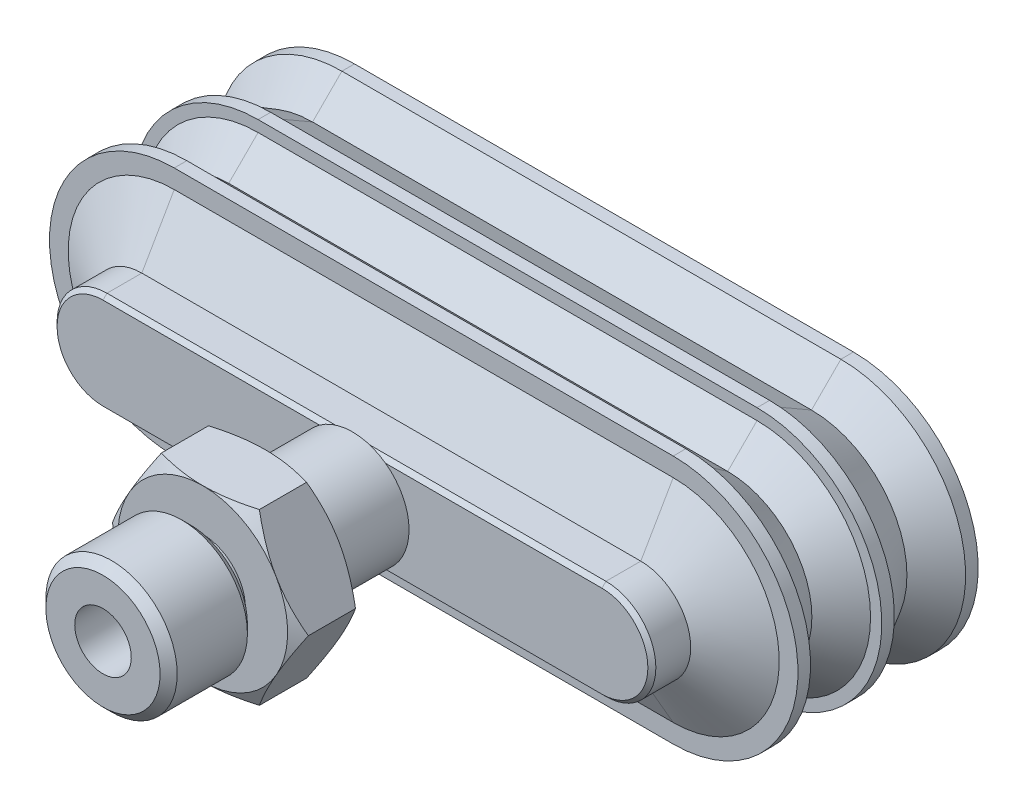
ISO-10303-21;
HEADER;
FILE_DESCRIPTION(('STEP AP214'),'2;1');
FILE_NAME('part.step','',(''),(''),'','','');
FILE_SCHEMA(('AUTOMOTIVE_DESIGN { 1 0 10303 214 1 1 1 1 }'));
ENDSEC;
DATA;
#1=APPLICATION_CONTEXT('core data for automotive mechanical design processes');
#2=APPLICATION_PROTOCOL_DEFINITION('international standard','automotive_design',2000,#1);
#3=PRODUCT_CONTEXT('',#1,'mechanical');
#4=PRODUCT('Part','Part','',(#3));
#5=PRODUCT_RELATED_PRODUCT_CATEGORY('part','',(#4));
#6=PRODUCT_DEFINITION_FORMATION('','',#4);
#7=PRODUCT_DEFINITION_CONTEXT('part definition',#1,'design');
#8=PRODUCT_DEFINITION('design','',#6,#7);
#9=PRODUCT_DEFINITION_SHAPE('','',#8);
#10=(LENGTH_UNIT() NAMED_UNIT(*) SI_UNIT(.MILLI.,.METRE.));
#11=(NAMED_UNIT(*) PLANE_ANGLE_UNIT() SI_UNIT($,.RADIAN.));
#12=(NAMED_UNIT(*) SI_UNIT($,.STERADIAN.) SOLID_ANGLE_UNIT());
#13=UNCERTAINTY_MEASURE_WITH_UNIT(LENGTH_MEASURE(1.E-05),#10,'distance_accuracy_value','');
#14=(GEOMETRIC_REPRESENTATION_CONTEXT(3) GLOBAL_UNCERTAINTY_ASSIGNED_CONTEXT((#13)) GLOBAL_UNIT_ASSIGNED_CONTEXT((#10,
#11,#12)) REPRESENTATION_CONTEXT('',''));
#15=CARTESIAN_POINT('',(0.,0.,0.));
#16=DIRECTION('',(0.,0.,1.));
#17=DIRECTION('',(1.,0.,0.));
#18=AXIS2_PLACEMENT_3D('',#15,#16,#17);
#19=CARTESIAN_POINT('',(-15.,3.,2.16));
#20=DIRECTION('',(-1.,0.,0.));
#21=DIRECTION('',(0.,-1.,0.));
#22=AXIS2_PLACEMENT_3D('',#19,#20,#21);
#23=PLANE('',#22);
#24=DIRECTION('',(0.,-1.,0.));
#25=VECTOR('',#24,1.);
#26=CARTESIAN_POINT('',(-15.,3.,9.66));
#27=LINE('',#26,#25);
#28=CARTESIAN_POINT('',(-15.,3.,9.66));
#29=VERTEX_POINT('',#28);
#30=CARTESIAN_POINT('',(-15.,-3.,9.66));
#31=VERTEX_POINT('',#30);
#32=EDGE_CURVE('E668',#29,#31,#27,.T.);
#33=ORIENTED_EDGE('',*,*,#32,.F.);
#34=DIRECTION('',(0.,0.,1.));
#35=VECTOR('',#34,1.);
#36=CARTESIAN_POINT('',(-15.,3.,2.16));
#37=LINE('',#36,#35);
#38=CARTESIAN_POINT('',(-15.,3.,2.16));
#39=VERTEX_POINT('',#38);
#40=EDGE_CURVE('E663',#39,#29,#37,.T.);
#41=ORIENTED_EDGE('',*,*,#40,.F.);
#42=DIRECTION('',(0.,-1.,0.));
#43=VECTOR('',#42,1.);
#44=CARTESIAN_POINT('',(-15.,3.,2.16));
#45=LINE('',#44,#43);
#46=CARTESIAN_POINT('',(-15.,-3.,2.16));
#47=VERTEX_POINT('',#46);
#48=EDGE_CURVE('E666',#39,#47,#45,.T.);
#49=ORIENTED_EDGE('',*,*,#48,.T.);
#50=DIRECTION('',(0.,0.,1.));
#51=VECTOR('',#50,1.);
#52=CARTESIAN_POINT('',(-15.,-3.,2.16));
#53=LINE('',#52,#51);
#54=EDGE_CURVE('E706',#47,#31,#53,.T.);
#55=ORIENTED_EDGE('',*,*,#54,.T.);
#56=EDGE_LOOP('',(#33,#41,#49,#55));
#57=FACE_BOUND('',#56,.T.);
#58=ADVANCED_FACE('F15',(#57),#23,.T.);
#59=CARTESIAN_POINT('',(-20.625,-3.,2.16));
#60=DIRECTION('',(1.,0.,0.));
#61=DIRECTION('',(0.,0.,1.));
#62=AXIS2_PLACEMENT_3D('',#59,#60,#61);
#63=PLANE('',#62);
#64=DIRECTION('',(0.,1.,0.));
#65=VECTOR('',#64,1.);
#66=CARTESIAN_POINT('',(-20.625,-3.,9.66));
#67=LINE('',#66,#65);
#68=CARTESIAN_POINT('',(-20.625,-3.,9.66));
#69=VERTEX_POINT('',#68);
#70=CARTESIAN_POINT('',(-20.625,3.,9.66));
#71=VERTEX_POINT('',#70);
#72=EDGE_CURVE('E856',#69,#71,#67,.T.);
#73=ORIENTED_EDGE('',*,*,#72,.F.);
#74=DIRECTION('',(0.,0.,1.));
#75=VECTOR('',#74,1.);
#76=CARTESIAN_POINT('',(-20.625,-3.,2.16));
#77=LINE('',#76,#75);
#78=CARTESIAN_POINT('',(-20.625,-3.,2.16));
#79=VERTEX_POINT('',#78);
#80=EDGE_CURVE('E820',#79,#69,#77,.T.);
#81=ORIENTED_EDGE('',*,*,#80,.F.);
#82=DIRECTION('',(0.,1.,0.));
#83=VECTOR('',#82,1.);
#84=CARTESIAN_POINT('',(-20.625,-3.,2.16));
#85=LINE('',#84,#83);
#86=CARTESIAN_POINT('',(-20.625,3.,2.16));
#87=VERTEX_POINT('',#86);
#88=EDGE_CURVE('E800',#79,#87,#85,.T.);
#89=ORIENTED_EDGE('',*,*,#88,.T.);
#90=DIRECTION('',(0.,0.,1.));
#91=VECTOR('',#90,1.);
#92=CARTESIAN_POINT('',(-20.625,3.,2.16));
#93=LINE('',#92,#91);
#94=EDGE_CURVE('E1213',#87,#71,#93,.T.);
#95=ORIENTED_EDGE('',*,*,#94,.T.);
#96=EDGE_LOOP('',(#73,#81,#89,#95));
#97=FACE_BOUND('',#96,.T.);
#98=ADVANCED_FACE('F1936',(#97),#63,.T.);
#99=CARTESIAN_POINT('',(0.,0.,2.16));
#100=DIRECTION('',(0.,0.,1.));
#101=DIRECTION('',(0.,-1.,0.));
#102=AXIS2_PLACEMENT_3D('',#99,#100,#101);
#103=CYLINDRICAL_SURFACE('',#102,5.);
#104=CARTESIAN_POINT('',(0.,0.,9.66));
#105=DIRECTION('',(0.,0.,1.));
#106=DIRECTION('',(1.,0.,0.));
#107=AXIS2_PLACEMENT_3D('',#104,#105,#106);
#108=CIRCLE('',#107,5.);
#109=CARTESIAN_POINT('',(-4.,3.,9.66));
#110=VERTEX_POINT('',#109);
#111=CARTESIAN_POINT('',(-4.,-3.,9.66));
#112=VERTEX_POINT('',#111);
#113=EDGE_CURVE('E857',#110,#112,#108,.T.);
#114=ORIENTED_EDGE('',*,*,#113,.T.);
#115=DIRECTION('',(0.,0.,1.));
#116=VECTOR('',#115,1.);
#117=CARTESIAN_POINT('',(-4.,-3.,2.16));
#118=LINE('',#117,#116);
#119=CARTESIAN_POINT('',(-4.,-3.,2.16));
#120=VERTEX_POINT('',#119);
#121=EDGE_CURVE('E1121',#120,#112,#118,.T.);
#122=ORIENTED_EDGE('',*,*,#121,.F.);
#123=CARTESIAN_POINT('',(0.,0.,2.16));
#124=DIRECTION('',(0.,0.,1.));
#125=DIRECTION('',(1.,0.,0.));
#126=AXIS2_PLACEMENT_3D('',#123,#124,#125);
#127=CIRCLE('',#126,5.);
#128=CARTESIAN_POINT('',(-4.,3.,2.16));
#129=VERTEX_POINT('',#128);
#130=EDGE_CURVE('E691',#129,#120,#127,.T.);
#131=ORIENTED_EDGE('',*,*,#130,.F.);
#132=DIRECTION('',(0.,0.,1.));
#133=VECTOR('',#132,1.);
#134=CARTESIAN_POINT('',(-4.,3.,2.16));
#135=LINE('',#134,#133);
#136=EDGE_CURVE('E675',#129,#110,#135,.T.);
#137=ORIENTED_EDGE('',*,*,#136,.T.);
#138=EDGE_LOOP('',(#114,#122,#131,#137));
#139=FACE_BOUND('',#138,.T.);
#140=ADVANCED_FACE('F1940',(#139),#103,.F.);
#141=CARTESIAN_POINT('',(0.,0.,2.16));
#142=DIRECTION('',(0.,0.,1.));
#143=DIRECTION('',(0.,-1.,0.));
#144=AXIS2_PLACEMENT_3D('',#141,#142,#143);
#145=CYLINDRICAL_SURFACE('',#144,5.);
#146=CARTESIAN_POINT('',(0.,0.,9.66));
#147=DIRECTION('',(0.,0.,1.));
#148=DIRECTION('',(1.,0.,0.));
#149=AXIS2_PLACEMENT_3D('',#146,#147,#148);
#150=CIRCLE('',#149,5.);
#151=CARTESIAN_POINT('',(4.,-3.,9.66));
#152=VERTEX_POINT('',#151);
#153=CARTESIAN_POINT('',(4.,3.,9.66));
#154=VERTEX_POINT('',#153);
#155=EDGE_CURVE('E935',#152,#154,#150,.T.);
#156=ORIENTED_EDGE('',*,*,#155,.T.);
#157=DIRECTION('',(0.,0.,1.));
#158=VECTOR('',#157,1.);
#159=CARTESIAN_POINT('',(4.,3.,2.16));
#160=LINE('',#159,#158);
#161=CARTESIAN_POINT('',(4.,3.,2.16));
#162=VERTEX_POINT('',#161);
#163=EDGE_CURVE('E869',#162,#154,#160,.T.);
#164=ORIENTED_EDGE('',*,*,#163,.F.);
#165=CARTESIAN_POINT('',(0.,0.,2.16));
#166=DIRECTION('',(0.,0.,1.));
#167=DIRECTION('',(1.,0.,0.));
#168=AXIS2_PLACEMENT_3D('',#165,#166,#167);
#169=CIRCLE('',#168,5.);
#170=CARTESIAN_POINT('',(4.,-3.,2.16));
#171=VERTEX_POINT('',#170);
#172=EDGE_CURVE('E1264',#171,#162,#169,.T.);
#173=ORIENTED_EDGE('',*,*,#172,.F.);
#174=DIRECTION('',(0.,0.,1.));
#175=VECTOR('',#174,1.);
#176=CARTESIAN_POINT('',(4.,-3.,2.16));
#177=LINE('',#176,#175);
#178=EDGE_CURVE('E816',#171,#152,#177,.T.);
#179=ORIENTED_EDGE('',*,*,#178,.T.);
#180=EDGE_LOOP('',(#156,#164,#173,#179));
#181=FACE_BOUND('',#180,.T.);
#182=ADVANCED_FACE('F1958',(#181),#145,.F.);
#183=CARTESIAN_POINT('',(15.,-3.,2.16));
#184=DIRECTION('',(1.,0.,0.));
#185=DIRECTION('',(0.,-1.,0.));
#186=AXIS2_PLACEMENT_3D('',#183,#184,#185);
#187=PLANE('',#186);
#188=DIRECTION('',(0.,1.,0.));
#189=VECTOR('',#188,1.);
#190=CARTESIAN_POINT('',(15.,-3.,9.66));
#191=LINE('',#190,#189);
#192=CARTESIAN_POINT('',(15.,-3.,9.66));
#193=VERTEX_POINT('',#192);
#194=CARTESIAN_POINT('',(15.,3.,9.66));
#195=VERTEX_POINT('',#194);
#196=EDGE_CURVE('E932',#193,#195,#191,.T.);
#197=ORIENTED_EDGE('',*,*,#196,.F.);
#198=DIRECTION('',(0.,0.,1.));
#199=VECTOR('',#198,1.);
#200=CARTESIAN_POINT('',(15.,-3.,2.16));
#201=LINE('',#200,#199);
#202=CARTESIAN_POINT('',(15.,-3.,2.16));
#203=VERTEX_POINT('',#202);
#204=EDGE_CURVE('E685',#203,#193,#201,.T.);
#205=ORIENTED_EDGE('',*,*,#204,.F.);
#206=DIRECTION('',(0.,1.,0.));
#207=VECTOR('',#206,1.);
#208=CARTESIAN_POINT('',(15.,-3.,2.16));
#209=LINE('',#208,#207);
#210=CARTESIAN_POINT('',(15.,3.,2.16));
#211=VERTEX_POINT('',#210);
#212=EDGE_CURVE('E1242',#203,#211,#209,.T.);
#213=ORIENTED_EDGE('',*,*,#212,.T.);
#214=DIRECTION('',(0.,0.,1.));
#215=VECTOR('',#214,1.);
#216=CARTESIAN_POINT('',(15.,3.,2.16));
#217=LINE('',#216,#215);
#218=EDGE_CURVE('E874',#211,#195,#217,.T.);
#219=ORIENTED_EDGE('',*,*,#218,.T.);
#220=EDGE_LOOP('',(#197,#205,#213,#219));
#221=FACE_BOUND('',#220,.T.);
#222=ADVANCED_FACE('F1955',(#221),#187,.T.);
#223=CARTESIAN_POINT('',(20.625,3.,2.16));
#224=DIRECTION('',(-1.,0.,0.));
#225=DIRECTION('',(0.,-1.,0.));
#226=AXIS2_PLACEMENT_3D('',#223,#224,#225);
#227=PLANE('',#226);
#228=DIRECTION('',(0.,-1.,0.));
#229=VECTOR('',#228,1.);
#230=CARTESIAN_POINT('',(20.625,3.,9.66));
#231=LINE('',#230,#229);
#232=CARTESIAN_POINT('',(20.625,3.,9.66));
#233=VERTEX_POINT('',#232);
#234=CARTESIAN_POINT('',(20.625,-3.,9.66));
#235=VERTEX_POINT('',#234);
#236=EDGE_CURVE('E453',#233,#235,#231,.T.);
#237=ORIENTED_EDGE('',*,*,#236,.F.);
#238=DIRECTION('',(0.,0.,1.));
#239=VECTOR('',#238,1.);
#240=CARTESIAN_POINT('',(20.625,3.,2.16));
#241=LINE('',#240,#239);
#242=CARTESIAN_POINT('',(20.625,3.,2.16));
#243=VERTEX_POINT('',#242);
#244=EDGE_CURVE('E887',#243,#233,#241,.T.);
#245=ORIENTED_EDGE('',*,*,#244,.F.);
#246=DIRECTION('',(0.,-1.,0.));
#247=VECTOR('',#246,1.);
#248=CARTESIAN_POINT('',(20.625,3.,2.16));
#249=LINE('',#248,#247);
#250=CARTESIAN_POINT('',(20.625,-3.,2.16));
#251=VERTEX_POINT('',#250);
#252=EDGE_CURVE('E733',#243,#251,#249,.T.);
#253=ORIENTED_EDGE('',*,*,#252,.T.);
#254=DIRECTION('',(0.,0.,1.));
#255=VECTOR('',#254,1.);
#256=CARTESIAN_POINT('',(20.625,-3.,2.16));
#257=LINE('',#256,#255);
#258=EDGE_CURVE('E776',#251,#235,#257,.T.);
#259=ORIENTED_EDGE('',*,*,#258,.T.);
#260=EDGE_LOOP('',(#237,#245,#253,#259));
#261=FACE_BOUND('',#260,.T.);
#262=ADVANCED_FACE('F1957',(#261),#227,.T.);
#263=CARTESIAN_POINT('',(-25.25,0.,2.16));
#264=DIRECTION('',(0.,0.,1.));
#265=DIRECTION('',(0.,-1.,0.));
#266=AXIS2_PLACEMENT_3D('',#263,#264,#265);
#267=CYLINDRICAL_SURFACE('',#266,3.);
#268=CARTESIAN_POINT('',(-25.25,0.,9.66));
#269=DIRECTION('',(0.,0.,1.));
#270=DIRECTION('',(1.,0.,0.));
#271=AXIS2_PLACEMENT_3D('',#268,#269,#270);
#272=CIRCLE('',#271,3.);
#273=CARTESIAN_POINT('',(-25.25,3.,9.66));
#274=VERTEX_POINT('',#273);
#275=CARTESIAN_POINT('',(-25.25,-3.,9.66));
#276=VERTEX_POINT('',#275);
#277=EDGE_CURVE('E442',#274,#276,#272,.T.);
#278=ORIENTED_EDGE('',*,*,#277,.F.);
#279=DIRECTION('',(0.,0.,1.));
#280=VECTOR('',#279,1.);
#281=CARTESIAN_POINT('',(-25.25,3.,2.16));
#282=LINE('',#281,#280);
#283=CARTESIAN_POINT('',(-25.25,3.,2.16));
#284=VERTEX_POINT('',#283);
#285=EDGE_CURVE('E1287',#284,#274,#282,.T.);
#286=ORIENTED_EDGE('',*,*,#285,.F.);
#287=CARTESIAN_POINT('',(-25.25,0.,2.16));
#288=DIRECTION('',(0.,0.,1.));
#289=DIRECTION('',(1.,0.,0.));
#290=AXIS2_PLACEMENT_3D('',#287,#288,#289);
#291=CIRCLE('',#290,3.);
#292=CARTESIAN_POINT('',(-25.25,-3.,2.16));
#293=VERTEX_POINT('',#292);
#294=EDGE_CURVE('E734',#284,#293,#291,.T.);
#295=ORIENTED_EDGE('',*,*,#294,.T.);
#296=DIRECTION('',(0.,0.,1.));
#297=VECTOR('',#296,1.);
#298=CARTESIAN_POINT('',(-25.25,-3.,2.16));
#299=LINE('',#298,#297);
#300=EDGE_CURVE('E882',#293,#276,#299,.T.);
#301=ORIENTED_EDGE('',*,*,#300,.T.);
#302=EDGE_LOOP('',(#278,#286,#295,#301));
#303=FACE_BOUND('',#302,.T.);
#304=ADVANCED_FACE('F1740',(#303),#267,.T.);
#305=CARTESIAN_POINT('',(25.25,0.,2.16));
#306=DIRECTION('',(0.,0.,1.));
#307=DIRECTION('',(0.,-1.,0.));
#308=AXIS2_PLACEMENT_3D('',#305,#306,#307);
#309=CYLINDRICAL_SURFACE('',#308,3.);
#310=CARTESIAN_POINT('',(25.25,0.,9.66));
#311=DIRECTION('',(0.,0.,1.));
#312=DIRECTION('',(1.,0.,0.));
#313=AXIS2_PLACEMENT_3D('',#310,#311,#312);
#314=CIRCLE('',#313,3.);
#315=CARTESIAN_POINT('',(25.25,-3.,9.66));
#316=VERTEX_POINT('',#315);
#317=CARTESIAN_POINT('',(25.25,3.,9.66));
#318=VERTEX_POINT('',#317);
#319=EDGE_CURVE('E1130',#316,#318,#314,.T.);
#320=ORIENTED_EDGE('',*,*,#319,.F.);
#321=DIRECTION('',(0.,0.,1.));
#322=VECTOR('',#321,1.);
#323=CARTESIAN_POINT('',(25.25,-3.,2.16));
#324=LINE('',#323,#322);
#325=CARTESIAN_POINT('',(25.25,-3.,2.16));
#326=VERTEX_POINT('',#325);
#327=EDGE_CURVE('E779',#326,#316,#324,.T.);
#328=ORIENTED_EDGE('',*,*,#327,.F.);
#329=CARTESIAN_POINT('',(25.25,0.,2.16));
#330=DIRECTION('',(0.,0.,1.));
#331=DIRECTION('',(1.,0.,0.));
#332=AXIS2_PLACEMENT_3D('',#329,#330,#331);
#333=CIRCLE('',#332,3.);
#334=CARTESIAN_POINT('',(25.25,3.,2.16));
#335=VERTEX_POINT('',#334);
#336=EDGE_CURVE('E702',#326,#335,#333,.T.);
#337=ORIENTED_EDGE('',*,*,#336,.T.);
#338=DIRECTION('',(0.,0.,1.));
#339=VECTOR('',#338,1.);
#340=CARTESIAN_POINT('',(25.25,3.,2.16));
#341=LINE('',#340,#339);
#342=EDGE_CURVE('E886',#335,#318,#341,.T.);
#343=ORIENTED_EDGE('',*,*,#342,.T.);
#344=EDGE_LOOP('',(#320,#328,#337,#343));
#345=FACE_BOUND('',#344,.T.);
#346=ADVANCED_FACE('F2129',(#345),#309,.T.);
#347=CARTESIAN_POINT('',(2.83333333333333,0.,37.7));
#348=DIRECTION('',(0.,0.,1.));
#349=DIRECTION('',(1.,0.,0.));
#350=AXIS2_PLACEMENT_3D('',#347,#348,#349);
#351=PLANE('',#350);
#352=CARTESIAN_POINT('',(0.,0.,37.7));
#353=DIRECTION('',(0.,0.,-1.));
#354=DIRECTION('',(0.,1.,0.));
#355=AXIS2_PLACEMENT_3D('',#352,#353,#354);
#356=CIRCLE('',#355,2.83333333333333);
#357=CARTESIAN_POINT('',(0.,2.83333333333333,37.7));
#358=VERTEX_POINT('',#357);
#359=EDGE_CURVE('E10',#358,#358,#356,.T.);
#360=ORIENTED_EDGE('',*,*,#359,.F.);
#361=EDGE_LOOP('',(#360));
#362=FACE_BOUND('',#361,.T.);
#363=CARTESIAN_POINT('',(0.,0.,37.7));
#364=DIRECTION('',(0.,0.,1.));
#365=DIRECTION('',(0.,-1.,0.));
#366=AXIS2_PLACEMENT_3D('',#363,#364,#365);
#367=CIRCLE('',#366,1.41666666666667);
#368=CARTESIAN_POINT('',(0.,-1.41666666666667,37.7));
#369=VERTEX_POINT('',#368);
#370=EDGE_CURVE('E888',#369,#369,#367,.T.);
#371=ORIENTED_EDGE('',*,*,#370,.F.);
#372=EDGE_LOOP('',(#371));
#373=FACE_BOUND('',#372,.T.);
#374=ADVANCED_FACE('F1426',(#362,#373),#351,.T.);
#375=CARTESIAN_POINT('',(0.,0.,37.7));
#376=DIRECTION('',(0.,0.,-1.));
#377=DIRECTION('',(0.,1.,0.));
#378=AXIS2_PLACEMENT_3D('',#375,#376,#377);
#379=CYLINDRICAL_SURFACE('',#378,2.83333333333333);
#380=CARTESIAN_POINT('',(0.,0.,50.2));
#381=DIRECTION('',(0.,0.,-1.));
#382=DIRECTION('',(0.,1.,0.));
#383=AXIS2_PLACEMENT_3D('',#380,#381,#382);
#384=CIRCLE('',#383,2.83333333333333);
#385=CARTESIAN_POINT('',(0.,2.83333333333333,50.2));
#386=VERTEX_POINT('',#385);
#387=EDGE_CURVE('E867',#386,#386,#384,.T.);
#388=ORIENTED_EDGE('',*,*,#387,.F.);
#389=EDGE_LOOP('',(#388));
#390=FACE_BOUND('',#389,.T.);
#391=ORIENTED_EDGE('',*,*,#359,.T.);
#392=EDGE_LOOP('',(#391));
#393=FACE_BOUND('',#392,.T.);
#394=ADVANCED_FACE('F1614',(#390,#393),#379,.F.);
#395=CARTESIAN_POINT('',(0.,0.,40.2));
#396=DIRECTION('',(0.,0.,-1.));
#397=DIRECTION('',(1.,0.,0.));
#398=AXIS2_PLACEMENT_3D('',#395,#396,#397);
#399=CONICAL_SURFACE('',#398,8.5,1.0471975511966);
#400=CARTESIAN_POINT('',(-7.36121593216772,-4.25,40.2));
#401=CARTESIAN_POINT('',(-7.25818371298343,-4.42832831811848,40.2000718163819));
#402=CARTESIAN_POINT('',(-7.1551098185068,-4.60662918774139,40.1957826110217));
#403=CARTESIAN_POINT('',(-6.94951766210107,-4.9624472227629,40.1786479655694));
#404=CARTESIAN_POINT('',(-6.8469986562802,-5.13996515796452,40.1658274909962));
#405=CARTESIAN_POINT('',(-6.64164494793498,-5.49610131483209,40.1316440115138));
#406=CARTESIAN_POINT('',(-6.53881550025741,-5.67471534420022,40.110206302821));
#407=CARTESIAN_POINT('',(-6.33156207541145,-6.03460644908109,40.0589395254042));
#408=CARTESIAN_POINT('',(-6.2271470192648,-6.21586590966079,40.0289521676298));
#409=CARTESIAN_POINT('',(-6.02299474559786,-6.56950744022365,39.9629618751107));
#410=CARTESIAN_POINT('',(-5.92324635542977,-6.74194089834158,39.9272667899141));
#411=CARTESIAN_POINT('',(-5.72306409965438,-7.08809180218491,39.8488764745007));
#412=CARTESIAN_POINT('',(-5.62263961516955,-7.26179438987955,39.8060918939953));
#413=CARTESIAN_POINT('',(-5.42055560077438,-7.61147967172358,39.7135922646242));
#414=CARTESIAN_POINT('',(-5.31891127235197,-7.78743893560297,39.6637562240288));
#415=CARTESIAN_POINT('',(-5.11385988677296,-8.14250575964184,39.5571721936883));
#416=CARTESIAN_POINT('',(-5.01047224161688,-8.32158213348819,39.5002826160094));
#417=CARTESIAN_POINT('',(-4.90747728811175,-8.49999999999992,39.4408106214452));
#418=B_SPLINE_CURVE_WITH_KNOTS('',3,(#400,#401,#402,#403,#404,#405,#406,#407,#408,#409,#410,
#411,#412,#413,#414,#415,#416,#417),.UNSPECIFIED.,.F.,.F.,(4,2,2,2,2,2,2,2,4),(0.,
0.617807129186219,1.23381423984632,1.85528090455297,2.48909748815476,3.0961233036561,
3.71148028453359,4.33908505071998,4.9823709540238),.UNSPECIFIED.);
#419=CARTESIAN_POINT('',(-7.36121593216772,-4.25,40.2));
#420=VERTEX_POINT('',#419);
#421=CARTESIAN_POINT('',(-4.90747728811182,-8.5,39.4408106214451));
#422=VERTEX_POINT('',#421);
#423=EDGE_CURVE('E1629',#420,#422,#418,.T.);
#424=ORIENTED_EDGE('',*,*,#423,.T.);
#425=CARTESIAN_POINT('',(-4.90747728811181,-8.50000000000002,39.4408106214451));
#426=CARTESIAN_POINT('',(-4.70191543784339,-8.49998803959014,39.5001521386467));
#427=CARTESIAN_POINT('',(-4.49559264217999,-8.49996968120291,39.556930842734));
#428=CARTESIAN_POINT('',(-4.08653726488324,-8.49996443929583,39.6633175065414));
#429=CARTESIAN_POINT('',(-3.88384159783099,-8.49997679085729,39.7130677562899));
#430=CARTESIAN_POINT('',(-3.48104775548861,-8.50007144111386,39.8054197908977));
#431=CARTESIAN_POINT('',(-3.28097778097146,-8.50015234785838,39.8481437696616));
#432=CARTESIAN_POINT('',(-2.88232509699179,-8.50037240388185,39.9264382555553));
#433=CARTESIAN_POINT('',(-2.68376032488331,-8.50051072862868,39.9620998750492));
#434=CARTESIAN_POINT('',(-2.2756842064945,-8.50047010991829,40.0282218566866));
#435=CARTESIAN_POINT('',(-2.06611672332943,-8.50027515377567,40.0583381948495));
#436=CARTESIAN_POINT('',(-1.64994699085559,-8.49986672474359,40.1098268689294));
#437=CARTESIAN_POINT('',(-1.44336413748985,-8.4996536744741,40.1313545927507));
#438=CARTESIAN_POINT('',(-1.03118619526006,-8.49951430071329,40.1656851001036));
#439=CARTESIAN_POINT('',(-0.825597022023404,-8.49958562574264,40.1785584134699));
#440=CARTESIAN_POINT('',(-0.413340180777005,-8.49979592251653,40.1957671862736));
#441=CARTESIAN_POINT('',(-0.206671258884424,-8.49993513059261,40.2000725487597));
#442=CARTESIAN_POINT('',(0.,-8.5,40.2));
#443=B_SPLINE_CURVE_WITH_KNOTS('',3,(#425,#426,#427,#428,#429,#430,#431,#432,#433,#434,#435,
#436,#437,#438,#439,#440,#441,#442),.UNSPECIFIED.,.F.,.F.,(4,2,2,2,2,2,2,2,4),(0.,
0.641880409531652,1.26793388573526,1.88157234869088,2.4866880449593,3.12170024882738,
3.74463687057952,4.36243320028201,4.98239588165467),.UNSPECIFIED.);
#444=CARTESIAN_POINT('',(0.,-8.5,40.2));
#445=VERTEX_POINT('',#444);
#446=EDGE_CURVE('E1596',#422,#445,#443,.T.);
#447=ORIENTED_EDGE('',*,*,#446,.T.);
#448=CARTESIAN_POINT('',(0.,0.,40.2));
#449=DIRECTION('',(0.,0.,-1.));
#450=DIRECTION('',(1.,0.,0.));
#451=AXIS2_PLACEMENT_3D('',#448,#449,#450);
#452=CIRCLE('',#451,8.5);
#453=EDGE_CURVE('E28',#445,#420,#452,.T.);
#454=ORIENTED_EDGE('',*,*,#453,.T.);
#455=EDGE_LOOP('',(#424,#447,#454));
#456=FACE_BOUND('',#455,.T.);
#457=ADVANCED_FACE('F1603',(#456),#399,.T.);
#458=CARTESIAN_POINT('',(4.276025,0.,40.2));
#459=DIRECTION('',(0.,0.,-1.));
#460=DIRECTION('',(0.,1.,0.));
#461=AXIS2_PLACEMENT_3D('',#458,#459,#460);
#462=PLANE('',#461);
#463=CARTESIAN_POINT('',(0.,0.,40.2));
#464=DIRECTION('',(0.,0.,-1.));
#465=DIRECTION('',(1.,0.,0.));
#466=AXIS2_PLACEMENT_3D('',#463,#464,#465);
#467=CIRCLE('',#466,4.276025);
#468=CARTESIAN_POINT('',(4.276025,0.,40.2));
#469=VERTEX_POINT('',#468);
#470=EDGE_CURVE('E905',#469,#469,#467,.T.);
#471=ORIENTED_EDGE('',*,*,#470,.T.);
#472=EDGE_LOOP('',(#471));
#473=FACE_BOUND('',#472,.T.);
#474=CARTESIAN_POINT('',(0.,0.,40.2));
#475=DIRECTION('',(0.,0.,-1.));
#476=DIRECTION('',(1.,0.,0.));
#477=AXIS2_PLACEMENT_3D('',#474,#475,#476);
#478=CIRCLE('',#477,8.5);
#479=CARTESIAN_POINT('',(7.36121593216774,4.25,40.2));
#480=VERTEX_POINT('',#479);
#481=CARTESIAN_POINT('',(7.36121593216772,-4.25,40.2));
#482=VERTEX_POINT('',#481);
#483=EDGE_CURVE('E1640',#480,#482,#478,.T.);
#484=ORIENTED_EDGE('',*,*,#483,.F.);
#485=CARTESIAN_POINT('',(0.,0.,40.2));
#486=DIRECTION('',(0.,0.,-1.));
#487=DIRECTION('',(1.,0.,0.));
#488=AXIS2_PLACEMENT_3D('',#485,#486,#487);
#489=CIRCLE('',#488,8.5);
#490=CARTESIAN_POINT('',(0.,8.5,40.2));
#491=VERTEX_POINT('',#490);
#492=EDGE_CURVE('E1792',#491,#480,#489,.T.);
#493=ORIENTED_EDGE('',*,*,#492,.F.);
#494=CARTESIAN_POINT('',(0.,0.,40.2));
#495=DIRECTION('',(0.,0.,-1.));
#496=DIRECTION('',(1.,0.,0.));
#497=AXIS2_PLACEMENT_3D('',#494,#495,#496);
#498=CIRCLE('',#497,8.5);
#499=CARTESIAN_POINT('',(-7.36121593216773,4.25,40.2));
#500=VERTEX_POINT('',#499);
#501=EDGE_CURVE('E1634',#500,#491,#498,.T.);
#502=ORIENTED_EDGE('',*,*,#501,.F.);
#503=CARTESIAN_POINT('',(0.,0.,40.2));
#504=DIRECTION('',(0.,0.,-1.));
#505=DIRECTION('',(1.,0.,0.));
#506=AXIS2_PLACEMENT_3D('',#503,#504,#505);
#507=CIRCLE('',#506,8.5);
#508=EDGE_CURVE('E1632',#420,#500,#507,.T.);
#509=ORIENTED_EDGE('',*,*,#508,.F.);
#510=ORIENTED_EDGE('',*,*,#453,.F.);
#511=CARTESIAN_POINT('',(0.,0.,40.2));
#512=DIRECTION('',(0.,0.,-1.));
#513=DIRECTION('',(1.,0.,0.));
#514=AXIS2_PLACEMENT_3D('',#511,#512,#513);
#515=CIRCLE('',#514,8.5);
#516=EDGE_CURVE('E1635',#482,#445,#515,.T.);
#517=ORIENTED_EDGE('',*,*,#516,.F.);
#518=EDGE_LOOP('',(#484,#493,#502,#509,#510,#517));
#519=FACE_BOUND('',#518,.T.);
#520=ADVANCED_FACE('F1613',(#473,#519),#462,.F.);
#521=CARTESIAN_POINT('',(0.,0.,40.2));
#522=DIRECTION('',(0.,0.,-1.));
#523=DIRECTION('',(1.,0.,0.));
#524=AXIS2_PLACEMENT_3D('',#521,#522,#523);
#525=CONICAL_SURFACE('',#524,8.5,1.0471975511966);
#526=ORIENTED_EDGE('',*,*,#483,.T.);
#527=CARTESIAN_POINT('',(7.36121593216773,-4.25000000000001,40.2));
#528=CARTESIAN_POINT('',(7.46413667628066,-4.07160732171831,40.2000718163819));
#529=CARTESIAN_POINT('',(7.56701281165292,-3.8931922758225,40.1957826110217));
#530=CARTESIAN_POINT('',(7.77236419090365,-3.53723522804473,40.1786479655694));
#531=CARTESIAN_POINT('',(7.8748397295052,-3.35969219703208,40.1658274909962));
#532=CARTESIAN_POINT('',(8.08058583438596,-3.00378259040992,40.1316440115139));
#533=CARTESIAN_POINT('',(8.18385539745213,-2.82542266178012,40.1102063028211));
#534=CARTESIAN_POINT('',(8.3919035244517,-2.46599037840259,40.0589395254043));
#535=CARTESIAN_POINT('',(8.49667129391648,-2.28493455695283,40.0289521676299));
#536=CARTESIAN_POINT('',(8.70085770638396,-1.93131273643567,39.9629618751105));
#537=CARTESIAN_POINT('',(8.8003152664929,-1.75871136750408,39.9272667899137));
#538=CARTESIAN_POINT('',(8.99999961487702,-1.41227299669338,39.8488764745));
#539=CARTESIAN_POINT('',(9.10021822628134,-1.23845154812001,39.8060918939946));
#540=CARTESIAN_POINT('',(9.30201255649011,-0.888599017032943,39.7135922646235));
#541=CARTESIAN_POINT('',(9.4035755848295,-0.712592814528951,39.6637562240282));
#542=CARTESIAN_POINT('',(9.60854678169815,-0.357479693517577,39.5571721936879));
#543=CARTESIAN_POINT('',(9.71193764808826,-0.17840517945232,39.5002826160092));
#544=CARTESIAN_POINT('',(9.81495457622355,0.,39.4408106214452));
#545=B_SPLINE_CURVE_WITH_KNOTS('',3,(#527,#528,#529,#530,#531,#532,#533,#534,#535,#536,#537,
#538,#539,#540,#541,#542,#543,#544),.UNSPECIFIED.,.F.,.F.,(4,2,2,2,2,2,2,2,4),(0.,
0.617807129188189,1.23381423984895,1.85528090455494,2.48909748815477,3.09612330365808,
3.71148028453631,4.33908505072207,4.98237095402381),.UNSPECIFIED.);
#546=CARTESIAN_POINT('',(9.81495457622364,0.,39.4408106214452));
#547=VERTEX_POINT('',#546);
#548=EDGE_CURVE('E2255',#482,#547,#545,.T.);
#549=ORIENTED_EDGE('',*,*,#548,.T.);
#550=CARTESIAN_POINT('',(9.81495457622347,0.,39.4408106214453));
#551=CARTESIAN_POINT('',(9.71193436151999,0.178411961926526,39.5002843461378));
#552=CARTESIAN_POINT('',(9.60853036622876,0.357485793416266,39.5571814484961));
#553=CARTESIAN_POINT('',(9.40354516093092,0.712549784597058,39.663775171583));
#554=CARTESIAN_POINT('',(9.30198167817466,0.88850744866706,39.7136144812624));
#555=CARTESIAN_POINT('',(9.10020735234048,1.23822149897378,39.8061149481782));
#556=CARTESIAN_POINT('',(9.00000939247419,1.41195275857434,39.8488983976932));
#557=CARTESIAN_POINT('',(8.80039184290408,1.75817302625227,39.9272827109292));
#558=CARTESIAN_POINT('',(8.70098053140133,1.93064620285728,39.9629743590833));
#559=CARTESIAN_POINT('',(8.49688119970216,2.2840761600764,40.0289627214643));
#560=CARTESIAN_POINT('',(8.39215504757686,2.46506926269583,40.0589491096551));
#561=CARTESIAN_POINT('',(8.18416783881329,2.82447059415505,40.1102153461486));
#562=CARTESIAN_POINT('',(8.08091688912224,3.00286236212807,40.1316502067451));
#563=CARTESIAN_POINT('',(7.87516415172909,3.35891704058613,40.165832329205));
#564=CARTESIAN_POINT('',(7.77266329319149,3.53657363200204,40.1786505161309));
#565=CARTESIAN_POINT('',(7.56720062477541,3.89283003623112,40.1957847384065));
#566=CARTESIAN_POINT('',(7.46423842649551,4.07143100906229,40.200071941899));
#567=CARTESIAN_POINT('',(7.36121593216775,4.24999999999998,40.2));
#568=B_SPLINE_CURVE_WITH_KNOTS('',3,(#550,#551,#552,#553,#554,#555,#556,#557,#558,#559,#560,
#561,#562,#563,#564,#565,#566,#567),.UNSPECIFIED.,.F.,.F.,(4,2,2,2,2,2,2,2,4),(0.,
0.643309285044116,1.27079477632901,1.88589173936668,2.49251958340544,3.1261121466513,
3.7476318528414,4.36397096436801,4.98238958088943),.UNSPECIFIED.);
#569=EDGE_CURVE('E1759',#547,#480,#568,.T.);
#570=ORIENTED_EDGE('',*,*,#569,.T.);
#571=EDGE_LOOP('',(#526,#549,#570));
#572=FACE_BOUND('',#571,.T.);
#573=ADVANCED_FACE('F1539',(#572),#525,.T.);
#574=CARTESIAN_POINT('',(0.,0.,40.2));
#575=DIRECTION('',(0.,0.,-1.));
#576=DIRECTION('',(1.,0.,0.));
#577=AXIS2_PLACEMENT_3D('',#574,#575,#576);
#578=CONICAL_SURFACE('',#577,8.5,1.0471975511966);
#579=ORIENTED_EDGE('',*,*,#492,.T.);
#580=CARTESIAN_POINT('',(7.36121593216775,4.24999999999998,40.2));
#581=CARTESIAN_POINT('',(7.25818371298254,4.42832831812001,40.2000718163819));
#582=CARTESIAN_POINT('',(7.15510981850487,4.60662918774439,40.1957826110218));
#583=CARTESIAN_POINT('',(6.94951766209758,4.96244722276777,40.1786479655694));
#584=CARTESIAN_POINT('',(6.84699865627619,5.13996515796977,40.1658274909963));
#585=CARTESIAN_POINT('',(6.64164494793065,5.49610131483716,40.1316440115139));
#586=CARTESIAN_POINT('',(6.53881550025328,5.67471534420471,40.1102063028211));
#587=CARTESIAN_POINT('',(6.33156207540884,6.03460644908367,40.0589395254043));
#588=CARTESIAN_POINT('',(6.22714701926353,6.21586590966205,40.0289521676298));
#589=CARTESIAN_POINT('',(6.02299474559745,6.56950744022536,39.9629618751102));
#590=CARTESIAN_POINT('',(5.9232463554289,6.74194089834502,39.9272667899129));
#591=CARTESIAN_POINT('',(5.72306409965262,7.0880918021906,39.8488764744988));
#592=CARTESIAN_POINT('',(5.62263961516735,7.26179438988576,39.8060918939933));
#593=CARTESIAN_POINT('',(5.4205556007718,7.61147967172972,39.7135922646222));
#594=CARTESIAN_POINT('',(5.31891127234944,7.78743893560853,39.663756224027));
#595=CARTESIAN_POINT('',(5.11385988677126,8.14250575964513,39.5571721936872));
#596=CARTESIAN_POINT('',(5.01047224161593,8.32158213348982,39.5002826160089));
#597=CARTESIAN_POINT('',(4.90747728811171,8.49999999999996,39.4408106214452));
#598=B_SPLINE_CURVE_WITH_KNOTS('',3,(#580,#581,#582,#583,#584,#585,#586,#587,#588,#589,#590,
#591,#592,#593,#594,#595,#596,#597),.UNSPECIFIED.,.F.,.F.,(4,2,2,2,2,2,2,2,4),(0.,
0.617807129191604,1.23381423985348,1.85528090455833,2.48909748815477,3.09612330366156,
3.7114802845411,4.33908505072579,4.9823709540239),.UNSPECIFIED.);
#599=CARTESIAN_POINT('',(4.90747728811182,8.5,39.4408106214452));
#600=VERTEX_POINT('',#599);
#601=EDGE_CURVE('E1756',#480,#600,#598,.T.);
#602=ORIENTED_EDGE('',*,*,#601,.T.);
#603=CARTESIAN_POINT('',(4.90747728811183,8.49999999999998,39.4408106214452));
#604=CARTESIAN_POINT('',(4.70191543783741,8.49998803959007,39.5001521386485));
#605=CARTESIAN_POINT('',(4.49559264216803,8.49996968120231,39.5569308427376));
#606=CARTESIAN_POINT('',(4.0865372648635,8.49996443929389,39.6633175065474));
#607=CARTESIAN_POINT('',(3.88384159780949,8.49997679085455,39.7130677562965));
#608=CARTESIAN_POINT('',(3.48104775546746,8.50007144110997,39.8054197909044));
#609=CARTESIAN_POINT('',(3.28097778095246,8.50015234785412,39.8481437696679));
#610=CARTESIAN_POINT('',(2.88232509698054,8.50037240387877,39.926438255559));
#611=CARTESIAN_POINT('',(2.68376032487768,8.50051072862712,39.962099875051));
#612=CARTESIAN_POINT('',(2.27568420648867,8.5004701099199,40.0282218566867));
#613=CARTESIAN_POINT('',(2.06611672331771,8.50027515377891,40.0583381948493));
#614=CARTESIAN_POINT('',(1.64994699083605,8.49986672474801,40.109826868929));
#615=CARTESIAN_POINT('',(1.44336413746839,8.49965367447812,40.1313545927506));
#616=CARTESIAN_POINT('',(1.03118619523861,8.49951430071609,40.1656851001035));
#617=CARTESIAN_POINT('',(0.82559702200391,8.49958562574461,40.1785584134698));
#618=CARTESIAN_POINT('',(0.413340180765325,8.49979592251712,40.1957671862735));
#619=CARTESIAN_POINT('',(0.206671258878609,8.49993513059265,40.2000725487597));
#620=CARTESIAN_POINT('',(0.,8.5,40.2));
#621=B_SPLINE_CURVE_WITH_KNOTS('',3,(#603,#604,#605,#606,#607,#608,#609,#610,#611,#612,#613,
#614,#615,#616,#617,#618,#619,#620),.UNSPECIFIED.,.F.,.F.,(4,2,2,2,2,2,2,2,4),(0.,
0.641880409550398,1.26793388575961,1.88157234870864,2.4866880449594,3.12170024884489,
3.74463687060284,4.36243320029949,4.98239588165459),.UNSPECIFIED.);
#622=EDGE_CURVE('E1699',#600,#491,#621,.T.);
#623=ORIENTED_EDGE('',*,*,#622,.T.);
#624=EDGE_LOOP('',(#579,#602,#623));
#625=FACE_BOUND('',#624,.T.);
#626=ADVANCED_FACE('F1678',(#625),#578,.T.);
#627=CARTESIAN_POINT('',(0.,0.,40.2));
#628=DIRECTION('',(0.,0.,-1.));
#629=DIRECTION('',(1.,0.,0.));
#630=AXIS2_PLACEMENT_3D('',#627,#628,#629);
#631=CONICAL_SURFACE('',#630,8.5,1.0471975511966);
#632=ORIENTED_EDGE('',*,*,#501,.T.);
#633=CARTESIAN_POINT('',(0.,8.5,40.2));
#634=CARTESIAN_POINT('',(-0.206654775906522,8.49993517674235,40.2000725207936));
#635=CARTESIAN_POINT('',(-0.41330705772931,8.49980161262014,40.1957645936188));
#636=CARTESIAN_POINT('',(-0.825561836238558,8.49960727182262,40.1785481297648));
#637=CARTESIAN_POINT('',(-1.03116553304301,8.49954625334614,40.1656683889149));
#638=CARTESIAN_POINT('',(-1.44340501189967,8.49970470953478,40.1313222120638));
#639=CARTESIAN_POINT('',(-1.65003476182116,8.49992656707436,40.1097838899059));
#640=CARTESIAN_POINT('',(-2.06633240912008,8.50034128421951,40.0582727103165));
#641=CARTESIAN_POINT('',(-2.2759807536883,8.5005334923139,40.0281432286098));
#642=CARTESIAN_POINT('',(-2.68410973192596,8.50056138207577,39.9620108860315));
#643=CARTESIAN_POINT('',(-2.88264709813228,8.50041359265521,39.9263557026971));
#644=CARTESIAN_POINT('',(-3.28124238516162,8.5001784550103,39.8480743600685));
#645=CARTESIAN_POINT('',(-3.48128238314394,8.50009198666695,39.8053571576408));
#646=CARTESIAN_POINT('',(-3.88401360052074,8.49998773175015,39.7130203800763));
#647=CARTESIAN_POINT('',(-4.08667664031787,8.49997136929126,39.6632787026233));
#648=CARTESIAN_POINT('',(-4.49566377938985,8.4999710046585,39.5569106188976));
#649=CARTESIAN_POINT('',(-4.70195098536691,8.49998783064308,39.5001420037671));
#650=CARTESIAN_POINT('',(-4.90747728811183,8.50000000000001,39.4408106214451));
#651=B_SPLINE_CURVE_WITH_KNOTS('',3,(#633,#634,#635,#636,#637,#638,#639,#640,#641,#642,#643,
#644,#645,#646,#647,#648,#649,#650),.UNSPECIFIED.,.F.,.F.,(4,2,2,2,2,2,2,2,4),(0.,
0.619912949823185,1.23775382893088,1.86083378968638,2.49609177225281,3.1011232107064,
3.71466946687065,4.34062177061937,4.98239123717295),.UNSPECIFIED.);
#652=CARTESIAN_POINT('',(-4.90747728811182,8.5,39.4408106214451));
#653=VERTEX_POINT('',#652);
#654=EDGE_CURVE('E1697',#491,#653,#651,.T.);
#655=ORIENTED_EDGE('',*,*,#654,.T.);
#656=CARTESIAN_POINT('',(-4.90747728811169,8.49999999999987,39.4408106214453));
#657=CARTESIAN_POINT('',(-5.01047647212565,8.32157589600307,39.5002843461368));
#658=CARTESIAN_POINT('',(-5.11385696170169,8.14248849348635,39.557181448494));
#659=CARTESIAN_POINT('',(-5.31885879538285,7.78743410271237,39.6637751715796));
#660=CARTESIAN_POINT('',(-5.4204608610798,7.61149871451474,39.7136144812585));
#661=CARTESIAN_POINT('',(-5.62243494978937,7.26189999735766,39.8061149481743));
#662=CARTESIAN_POINT('',(-5.7227916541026,7.08826038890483,39.8488983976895));
#663=CARTESIAN_POINT('',(-5.92281842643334,6.7422763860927,39.927282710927));
#664=CARTESIAN_POINT('',(-6.02247892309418,6.56994707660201,39.9629743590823));
#665=CARTESIAN_POINT('',(-6.22650857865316,6.21647689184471,40.0289627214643));
#666=CARTESIAN_POINT('',(-6.33089012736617,6.03528483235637,40.0589491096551));
#667=CARTESIAN_POINT('',(-6.53814720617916,5.67546196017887,40.1102153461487));
#668=CARTESIAN_POINT('',(-6.64101353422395,5.49684813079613,40.1316502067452));
#669=CARTESIAN_POINT('',(-6.84648956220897,5.14063369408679,40.165832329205));
#670=CARTESIAN_POINT('',(-6.94909425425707,4.96303705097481,40.1786505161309));
#671=CARTESIAN_POINT('',(-7.15489001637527,4.60697295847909,40.1957847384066));
#672=CARTESIAN_POINT('',(-7.2580818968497,4.42850459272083,40.200071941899));
#673=CARTESIAN_POINT('',(-7.36121593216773,4.24999999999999,40.2));
#674=B_SPLINE_CURVE_WITH_KNOTS('',3,(#656,#657,#658,#659,#660,#661,#662,#663,#664,#665,#666,
#667,#668,#669,#670,#671,#672,#673),.UNSPECIFIED.,.F.,.F.,(4,2,2,2,2,2,2,2,4),(0.,
0.643309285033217,1.27079477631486,1.88589173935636,2.4925195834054,3.12611214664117,
3.7476318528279,4.3639709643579,4.98238958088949),.UNSPECIFIED.);
#675=EDGE_CURVE('E1647',#653,#500,#674,.T.);
#676=ORIENTED_EDGE('',*,*,#675,.T.);
#677=EDGE_LOOP('',(#632,#655,#676));
#678=FACE_BOUND('',#677,.T.);
#679=ADVANCED_FACE('F1385',(#678),#631,.T.);
#680=CARTESIAN_POINT('',(0.,0.,40.2));
#681=DIRECTION('',(0.,0.,-1.));
#682=DIRECTION('',(1.,0.,0.));
#683=AXIS2_PLACEMENT_3D('',#680,#681,#682);
#684=CONICAL_SURFACE('',#683,8.5,1.0471975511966);
#685=ORIENTED_EDGE('',*,*,#508,.T.);
#686=CARTESIAN_POINT('',(-7.36121593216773,4.24999999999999,40.2));
#687=CARTESIAN_POINT('',(-7.46413667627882,4.07160732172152,40.2000718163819));
#688=CARTESIAN_POINT('',(-7.56701281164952,3.89319227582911,40.1957826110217));
#689=CARTESIAN_POINT('',(-7.77236419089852,3.53723522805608,40.1786479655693));
#690=CARTESIAN_POINT('',(-7.8748397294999,3.35969219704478,40.1658274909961));
#691=CARTESIAN_POINT('',(-8.08058583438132,3.00378259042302,40.1316440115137));
#692=CARTESIAN_POINT('',(-8.18385539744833,2.82542266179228,40.1102063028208));
#693=CARTESIAN_POINT('',(-8.39190352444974,2.46599037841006,40.0589395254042));
#694=CARTESIAN_POINT('',(-8.4966712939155,2.28493455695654,40.0289521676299));
#695=CARTESIAN_POINT('',(-8.7008577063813,1.93131273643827,39.9629618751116));
#696=CARTESIAN_POINT('',(-8.80031526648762,1.75871136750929,39.927266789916));
#697=CARTESIAN_POINT('',(-8.99999961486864,1.41227299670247,39.8488764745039));
#698=CARTESIAN_POINT('',(-9.10021822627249,1.2384515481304,39.8060918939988));
#699=CARTESIAN_POINT('',(-9.3020125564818,0.888599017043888,39.7135922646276));
#700=CARTESIAN_POINT('',(-9.40357558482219,0.712592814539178,39.6637562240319));
#701=CARTESIAN_POINT('',(-9.60854678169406,0.357479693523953,39.5571721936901));
#702=CARTESIAN_POINT('',(-9.71193764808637,0.17840517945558,39.5002826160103));
#703=CARTESIAN_POINT('',(-9.81495457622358,0.,39.4408106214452));
#704=B_SPLINE_CURVE_WITH_KNOTS('',3,(#686,#687,#688,#689,#690,#691,#692,#693,#694,#695,#696,
#697,#698,#699,#700,#701,#702,#703),.UNSPECIFIED.,.F.,.F.,(4,2,2,2,2,2,2,2,4),(0.,
0.61780712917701,1.23381423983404,1.85528090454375,2.48909748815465,3.09612330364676,
3.7114802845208,4.33908505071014,4.9823709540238),.UNSPECIFIED.);
#705=CARTESIAN_POINT('',(-9.81495457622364,0.,39.4408106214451));
#706=VERTEX_POINT('',#705);
#707=EDGE_CURVE('E1408',#500,#706,#704,.T.);
#708=ORIENTED_EDGE('',*,*,#707,.T.);
#709=CARTESIAN_POINT('',(-9.8149545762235,0.,39.4408106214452));
#710=CARTESIAN_POINT('',(-9.71193436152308,-0.178411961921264,39.500284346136));
#711=CARTESIAN_POINT('',(-9.60853036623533,-0.357485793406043,39.5571814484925));
#712=CARTESIAN_POINT('',(-9.40354516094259,-0.712549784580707,39.663775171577));
#713=CARTESIAN_POINT('',(-9.30198167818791,-0.888507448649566,39.7136144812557));
#714=CARTESIAN_POINT('',(-9.10020735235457,-1.23822149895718,39.8061149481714));
#715=CARTESIAN_POINT('',(-9.00000939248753,-1.41195275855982,39.8488983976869));
#716=CARTESIAN_POINT('',(-8.80039184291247,-1.75817302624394,39.9272827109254));
#717=CARTESIAN_POINT('',(-8.70098053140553,-1.93064620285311,39.9629743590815));
#718=CARTESIAN_POINT('',(-8.49688119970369,-2.28407616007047,40.0289627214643));
#719=CARTESIAN_POINT('',(-8.39215504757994,-2.46506926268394,40.0589491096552));
#720=CARTESIAN_POINT('',(-8.18416783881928,-2.82447059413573,40.1102153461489));
#721=CARTESIAN_POINT('',(-8.08091688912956,-3.00286236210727,40.1316502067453));
#722=CARTESIAN_POINT('',(-7.87516415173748,-3.35891704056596,40.1658323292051));
#723=CARTESIAN_POINT('',(-7.7726632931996,-3.53657363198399,40.1786505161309));
#724=CARTESIAN_POINT('',(-7.56720062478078,-3.8928300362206,40.1957847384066));
#725=CARTESIAN_POINT('',(-7.4642384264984,-4.07143100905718,40.200071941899));
#726=CARTESIAN_POINT('',(-7.36121593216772,-4.25,40.2));
#727=B_SPLINE_CURVE_WITH_KNOTS('',3,(#709,#710,#711,#712,#713,#714,#715,#716,#717,#718,#719,
#720,#721,#722,#723,#724,#725,#726),.UNSPECIFIED.,.F.,.F.,(4,2,2,2,2,2,2,2,4),(0.,
0.643309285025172,1.2707947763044,1.88589173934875,2.49251958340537,3.12611214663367,
3.74763185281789,4.3639709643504,4.98238958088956),.UNSPECIFIED.);
#728=EDGE_CURVE('E868',#706,#420,#727,.T.);
#729=ORIENTED_EDGE('',*,*,#728,.T.);
#730=EDGE_LOOP('',(#685,#708,#729));
#731=FACE_BOUND('',#730,.T.);
#732=ADVANCED_FACE('F1374',(#731),#684,.T.);
#733=CARTESIAN_POINT('',(0.,0.,40.2));
#734=DIRECTION('',(0.,0.,-1.));
#735=DIRECTION('',(1.,0.,0.));
#736=AXIS2_PLACEMENT_3D('',#733,#734,#735);
#737=CONICAL_SURFACE('',#736,8.5,1.0471975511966);
#738=CARTESIAN_POINT('',(0.,-8.5,40.2));
#739=CARTESIAN_POINT('',(0.206654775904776,-8.49993517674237,40.2000725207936));
#740=CARTESIAN_POINT('',(0.413307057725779,-8.49980161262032,40.1957645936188));
#741=CARTESIAN_POINT('',(0.825561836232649,-8.49960727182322,40.1785481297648));
#742=CARTESIAN_POINT('',(1.0311655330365,-8.49954625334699,40.1656683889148));
#743=CARTESIAN_POINT('',(1.44340501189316,-8.499704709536,40.1313222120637));
#744=CARTESIAN_POINT('',(1.65003476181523,-8.4999265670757,40.1097838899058));
#745=CARTESIAN_POINT('',(2.06633240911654,-8.50034128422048,40.0582727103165));
#746=CARTESIAN_POINT('',(2.27598075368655,-8.50053349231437,40.0281432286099));
#747=CARTESIAN_POINT('',(2.68410973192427,-8.50056138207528,39.962010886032));
#748=CARTESIAN_POINT('',(2.88264709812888,-8.50041359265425,39.9263557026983));
#749=CARTESIAN_POINT('',(3.28124238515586,-8.50017845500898,39.8480743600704));
#750=CARTESIAN_POINT('',(3.48128238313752,-8.50009198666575,39.8053571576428));
#751=CARTESIAN_POINT('',(3.88401360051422,-8.49998773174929,39.7130203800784));
#752=CARTESIAN_POINT('',(4.08667664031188,-8.49997136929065,39.6632787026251));
#753=CARTESIAN_POINT('',(4.49566377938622,-8.49997100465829,39.5569106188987));
#754=CARTESIAN_POINT('',(4.70195098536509,-8.49998783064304,39.5001420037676));
#755=CARTESIAN_POINT('',(4.90747728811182,-8.49999999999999,39.4408106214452));
#756=B_SPLINE_CURVE_WITH_KNOTS('',3,(#738,#739,#740,#741,#742,#743,#744,#745,#746,#747,#748,
#749,#750,#751,#752,#753,#754,#755),.UNSPECIFIED.,.F.,.F.,(4,2,2,2,2,2,2,2,4),(0.,
0.619912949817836,1.23775382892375,1.86083378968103,2.49609177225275,3.10112321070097,
3.71466946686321,4.34062177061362,4.98239123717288),.UNSPECIFIED.);
#757=CARTESIAN_POINT('',(4.90747728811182,-8.5,39.4408106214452));
#758=VERTEX_POINT('',#757);
#759=EDGE_CURVE('E1588',#445,#758,#756,.T.);
#760=ORIENTED_EDGE('',*,*,#759,.T.);
#761=CARTESIAN_POINT('',(4.90747728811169,-8.49999999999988,39.4408106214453));
#762=CARTESIAN_POINT('',(5.01047647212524,-8.32157589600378,39.5002843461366));
#763=CARTESIAN_POINT('',(5.11385696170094,-8.1424884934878,39.5571814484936));
#764=CARTESIAN_POINT('',(5.31885879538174,-7.78743410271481,39.6637751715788));
#765=CARTESIAN_POINT('',(5.42046086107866,-7.61149871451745,39.7136144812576));
#766=CARTESIAN_POINT('',(5.62243494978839,-7.26189999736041,39.8061149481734));
#767=CARTESIAN_POINT('',(5.7227916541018,-7.08826038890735,39.8488983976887));
#768=CARTESIAN_POINT('',(5.92281842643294,-6.74227638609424,39.9272827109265));
#769=CARTESIAN_POINT('',(6.02247892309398,-6.56994707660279,39.9629743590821));
#770=CARTESIAN_POINT('',(6.22650857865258,-6.2164768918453,40.0289627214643));
#771=CARTESIAN_POINT('',(6.33089012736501,-6.03528483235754,40.0589491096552));
#772=CARTESIAN_POINT('',(6.53814720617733,-5.67546196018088,40.1102153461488));
#773=CARTESIAN_POINT('',(6.64101353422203,-5.49684813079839,40.1316502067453));
#774=CARTESIAN_POINT('',(6.8464895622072,-5.14063369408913,40.1658323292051));
#775=CARTESIAN_POINT('',(6.94909425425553,-4.96303705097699,40.1786505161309));
#776=CARTESIAN_POINT('',(7.15489001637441,-4.60697295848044,40.1957847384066));
#777=CARTESIAN_POINT('',(7.2580818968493,-4.42850459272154,40.200071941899));
#778=CARTESIAN_POINT('',(7.36121593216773,-4.25000000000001,40.2));
#779=B_SPLINE_CURVE_WITH_KNOTS('',3,(#761,#762,#763,#764,#765,#766,#767,#768,#769,#770,#771,
#772,#773,#774,#775,#776,#777,#778),.UNSPECIFIED.,.F.,.F.,(4,2,2,2,2,2,2,2,4),(0.,
0.643309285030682,1.27079477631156,1.88589173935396,2.49251958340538,3.1261121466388,
3.74763185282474,4.36397096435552,4.98238958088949),.UNSPECIFIED.);
#780=EDGE_CURVE('E1589',#758,#482,#779,.T.);
#781=ORIENTED_EDGE('',*,*,#780,.T.);
#782=ORIENTED_EDGE('',*,*,#516,.T.);
#783=EDGE_LOOP('',(#760,#781,#782));
#784=FACE_BOUND('',#783,.T.);
#785=ADVANCED_FACE('F1384',(#784),#737,.T.);
#786=CARTESIAN_POINT('',(0.,0.,25.2));
#787=DIRECTION('',(0.,0.,-1.));
#788=DIRECTION('',(1.,0.,0.));
#789=AXIS2_PLACEMENT_3D('',#786,#787,#788);
#790=CYLINDRICAL_SURFACE('',#789,4.276025);
#791=CARTESIAN_POINT('',(0.,0.,41.45));
#792=DIRECTION('',(0.,0.,-1.));
#793=DIRECTION('',(1.,0.,0.));
#794=AXIS2_PLACEMENT_3D('',#791,#792,#793);
#795=CIRCLE('',#794,4.276025);
#796=CARTESIAN_POINT('',(4.276025,0.,41.45));
#797=VERTEX_POINT('',#796);
#798=EDGE_CURVE('E903',#797,#797,#795,.T.);
#799=ORIENTED_EDGE('',*,*,#798,.T.);
#800=EDGE_LOOP('',(#799));
#801=FACE_BOUND('',#800,.T.);
#802=ORIENTED_EDGE('',*,*,#470,.F.);
#803=EDGE_LOOP('',(#802));
#804=FACE_BOUND('',#803,.T.);
#805=ADVANCED_FACE('F2091',(#801,#804),#790,.T.);
#806=CARTESIAN_POINT('',(5.7225,0.,41.45));
#807=DIRECTION('',(0.,0.,1.));
#808=DIRECTION('',(1.,0.,0.));
#809=AXIS2_PLACEMENT_3D('',#806,#807,#808);
#810=PLANE('',#809);
#811=CARTESIAN_POINT('',(0.,0.,41.45));
#812=DIRECTION('',(0.,0.,-1.));
#813=DIRECTION('',(1.,0.,0.));
#814=AXIS2_PLACEMENT_3D('',#811,#812,#813);
#815=CIRCLE('',#814,5.7225);
#816=CARTESIAN_POINT('',(5.7225,0.,41.45));
#817=VERTEX_POINT('',#816);
#818=EDGE_CURVE('E906',#817,#817,#815,.T.);
#819=ORIENTED_EDGE('',*,*,#818,.T.);
#820=EDGE_LOOP('',(#819));
#821=FACE_BOUND('',#820,.T.);
#822=ORIENTED_EDGE('',*,*,#798,.F.);
#823=EDGE_LOOP('',(#822));
#824=FACE_BOUND('',#823,.T.);
#825=ADVANCED_FACE('F2801',(#821,#824),#810,.F.);
#826=CARTESIAN_POINT('',(0.,0.,42.306));
#827=DIRECTION('',(0.,0.,1.));
#828=DIRECTION('',(-1.,0.,0.));
#829=AXIS2_PLACEMENT_3D('',#826,#827,#828);
#830=CONICAL_SURFACE('',#829,6.5785,0.785398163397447);
#831=CARTESIAN_POINT('',(0.,0.,42.306));
#832=DIRECTION('',(0.,0.,-1.));
#833=DIRECTION('',(1.,0.,0.));
#834=AXIS2_PLACEMENT_3D('',#831,#832,#833);
#835=CIRCLE('',#834,6.5785);
#836=CARTESIAN_POINT('',(6.5785,0.,42.306));
#837=VERTEX_POINT('',#836);
#838=EDGE_CURVE('E1251',#837,#837,#835,.T.);
#839=ORIENTED_EDGE('',*,*,#838,.T.);
#840=EDGE_LOOP('',(#839));
#841=FACE_BOUND('',#840,.T.);
#842=ORIENTED_EDGE('',*,*,#818,.F.);
#843=EDGE_LOOP('',(#842));
#844=FACE_BOUND('',#843,.T.);
#845=ADVANCED_FACE('F2911',(#841,#844),#830,.T.);
#846=CARTESIAN_POINT('',(0.,0.,25.2));
#847=DIRECTION('',(0.,0.,-1.));
#848=DIRECTION('',(1.,0.,0.));
#849=AXIS2_PLACEMENT_3D('',#846,#847,#848);
#850=CYLINDRICAL_SURFACE('',#849,6.5785);
#851=CARTESIAN_POINT('',(0.,0.,49.344));
#852=DIRECTION('',(0.,0.,-1.));
#853=DIRECTION('',(1.,0.,0.));
#854=AXIS2_PLACEMENT_3D('',#851,#852,#853);
#855=CIRCLE('',#854,6.5785);
#856=CARTESIAN_POINT('',(6.5785,0.,49.344));
#857=VERTEX_POINT('',#856);
#858=EDGE_CURVE('E1254',#857,#857,#855,.T.);
#859=ORIENTED_EDGE('',*,*,#858,.T.);
#860=EDGE_LOOP('',(#859));
#861=FACE_BOUND('',#860,.T.);
#862=ORIENTED_EDGE('',*,*,#838,.F.);
#863=EDGE_LOOP('',(#862));
#864=FACE_BOUND('',#863,.T.);
#865=ADVANCED_FACE('F3046',(#861,#864),#850,.T.);
#866=CARTESIAN_POINT('',(0.,0.,50.2));
#867=DIRECTION('',(0.,0.,-1.));
#868=DIRECTION('',(1.,0.,0.));
#869=AXIS2_PLACEMENT_3D('',#866,#867,#868);
#870=CONICAL_SURFACE('',#869,5.7225,0.785398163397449);
#871=CARTESIAN_POINT('',(0.,0.,50.2));
#872=DIRECTION('',(0.,0.,-1.));
#873=DIRECTION('',(1.,0.,0.));
#874=AXIS2_PLACEMENT_3D('',#871,#872,#873);
#875=CIRCLE('',#874,5.7225);
#876=CARTESIAN_POINT('',(5.7225,0.,50.2));
#877=VERTEX_POINT('',#876);
#878=EDGE_CURVE('E864',#877,#877,#875,.T.);
#879=ORIENTED_EDGE('',*,*,#878,.T.);
#880=EDGE_LOOP('',(#879));
#881=FACE_BOUND('',#880,.T.);
#882=ORIENTED_EDGE('',*,*,#858,.F.);
#883=EDGE_LOOP('',(#882));
#884=FACE_BOUND('',#883,.T.);
#885=ADVANCED_FACE('F2164',(#881,#884),#870,.T.);
#886=CARTESIAN_POINT('',(0.,0.,50.2));
#887=DIRECTION('',(0.,0.,-1.));
#888=DIRECTION('',(0.,1.,0.));
#889=AXIS2_PLACEMENT_3D('',#886,#887,#888);
#890=PLANE('',#889);
#891=ORIENTED_EDGE('',*,*,#387,.T.);
#892=EDGE_LOOP('',(#891));
#893=FACE_BOUND('',#892,.T.);
#894=ORIENTED_EDGE('',*,*,#878,.F.);
#895=EDGE_LOOP('',(#894));
#896=FACE_BOUND('',#895,.T.);
#897=ADVANCED_FACE('F1563',(#893,#896),#890,.F.);
#898=CARTESIAN_POINT('',(-9.81495457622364,0.,40.2));
#899=DIRECTION('',(0.866025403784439,0.5,0.));
#900=DIRECTION('',(0.,0.,-1.));
#901=AXIS2_PLACEMENT_3D('',#898,#899,#900);
#902=PLANE('',#901);
#903=DIRECTION('',(0.,0.,-1.));
#904=VECTOR('',#903,1.);
#905=CARTESIAN_POINT('',(-9.81495457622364,0.,40.2));
#906=LINE('',#905,#904);
#907=CARTESIAN_POINT('',(-9.81495457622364,0.,34.7091893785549));
#908=VERTEX_POINT('',#907);
#909=EDGE_CURVE('E1491',#706,#908,#906,.T.);
#910=ORIENTED_EDGE('',*,*,#909,.T.);
#911=CARTESIAN_POINT('',(-7.36121593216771,-4.25,33.95));
#912=CARTESIAN_POINT('',(-7.46413667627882,-4.07160732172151,33.9499281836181));
#913=CARTESIAN_POINT('',(-7.56701281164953,-3.89319227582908,33.9542173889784));
#914=CARTESIAN_POINT('',(-7.77236419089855,-3.53723522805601,33.9713520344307));
#915=CARTESIAN_POINT('',(-7.87483972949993,-3.35969219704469,33.9841725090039));
#916=CARTESIAN_POINT('',(-8.08058583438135,-3.00378259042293,34.0183559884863));
#917=CARTESIAN_POINT('',(-8.18385539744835,-2.8254226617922,34.0397936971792));
#918=CARTESIAN_POINT('',(-8.39190352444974,-2.46599037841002,34.0910604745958));
#919=CARTESIAN_POINT('',(-8.4966712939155,-2.28493455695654,34.1210478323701));
#920=CARTESIAN_POINT('',(-8.70085770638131,-1.93131273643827,34.1870381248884));
#921=CARTESIAN_POINT('',(-8.80031526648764,-1.75871136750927,34.222733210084));
#922=CARTESIAN_POINT('',(-8.99999961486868,-1.41227299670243,34.3011235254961));
#923=CARTESIAN_POINT('',(-9.10021822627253,-1.23845154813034,34.3439081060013));
#924=CARTESIAN_POINT('',(-9.30201255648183,-0.88859901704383,34.4364077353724));
#925=CARTESIAN_POINT('',(-9.40357558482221,-0.712592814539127,34.4862437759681));
#926=CARTESIAN_POINT('',(-9.60854678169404,-0.357479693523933,34.5928278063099));
#927=CARTESIAN_POINT('',(-9.71193764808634,-0.178405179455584,34.6497173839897));
#928=CARTESIAN_POINT('',(-9.81495457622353,0.,34.7091893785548));
#929=B_SPLINE_CURVE_WITH_KNOTS('',3,(#911,#912,#913,#914,#915,#916,#917,#918,#919,#920,#921,
#922,#923,#924,#925,#926,#927,#928),.UNSPECIFIED.,.F.,.F.,(4,2,2,2,2,2,2,2,4),(0.,
0.617807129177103,1.23381423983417,1.85528090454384,2.48909748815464,3.09612330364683,
3.7114802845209,4.3390850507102,4.98237095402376),.UNSPECIFIED.);
#930=CARTESIAN_POINT('',(-7.36121593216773,-4.25,33.95));
#931=VERTEX_POINT('',#930);
#932=EDGE_CURVE('E891',#931,#908,#929,.T.);
#933=ORIENTED_EDGE('',*,*,#932,.F.);
#934=CARTESIAN_POINT('',(-4.90747728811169,-8.49999999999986,34.7091893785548));
#935=CARTESIAN_POINT('',(-5.01047647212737,-8.32157589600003,34.6497156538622));
#936=CARTESIAN_POINT('',(-5.11385696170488,-8.14248849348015,34.5928185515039));
#937=CARTESIAN_POINT('',(-5.31885879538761,-7.78743410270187,34.486224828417));
#938=CARTESIAN_POINT('',(-5.42046086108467,-7.61149871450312,34.4363855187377));
#939=CARTESIAN_POINT('',(-5.62243494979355,-7.26189999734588,34.3438850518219));
#940=CARTESIAN_POINT('',(-5.72279165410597,-7.08826038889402,34.3011016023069));
#941=CARTESIAN_POINT('',(-5.92281842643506,-6.74227638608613,34.2227172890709));
#942=CARTESIAN_POINT('',(-6.02247892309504,-6.5699470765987,34.1870256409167));
#943=CARTESIAN_POINT('',(-6.22650857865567,-6.21647689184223,34.1210372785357));
#944=CARTESIAN_POINT('',(-6.3308901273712,-6.0352848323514,34.091050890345));
#945=CARTESIAN_POINT('',(-6.53814720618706,-5.67546196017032,34.0397846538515));
#946=CARTESIAN_POINT('',(-6.64101353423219,-5.49684813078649,34.0183497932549));
#947=CARTESIAN_POINT('',(-6.8464895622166,-5.14063369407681,33.9841676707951));
#948=CARTESIAN_POINT('',(-6.94909425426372,-4.96303705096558,33.9713494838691));
#949=CARTESIAN_POINT('',(-7.15489001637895,-4.60697295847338,33.9542152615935));
#950=CARTESIAN_POINT('',(-7.2580818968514,-4.42850459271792,33.949928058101));
#951=CARTESIAN_POINT('',(-7.36121593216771,-4.25,33.95));
#952=B_SPLINE_CURVE_WITH_KNOTS('',3,(#934,#935,#936,#937,#938,#939,#940,#941,#942,#943,#944,
#945,#946,#947,#948,#949,#950,#951),.UNSPECIFIED.,.F.,.F.,(4,2,2,2,2,2,2,2,4),(0.,
0.643309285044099,1.27079477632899,1.88589173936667,2.49251958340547,3.12611214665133,
3.74763185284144,4.36397096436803,4.98238958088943),.UNSPECIFIED.);
#953=CARTESIAN_POINT('',(-4.90747728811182,-8.5,34.7091893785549));
#954=VERTEX_POINT('',#953);
#955=EDGE_CURVE('E1153',#954,#931,#952,.T.);
#956=ORIENTED_EDGE('',*,*,#955,.F.);
#957=DIRECTION('',(0.,0.,-1.));
#958=VECTOR('',#957,1.);
#959=CARTESIAN_POINT('',(-4.90747728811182,-8.5,40.2));
#960=LINE('',#959,#958);
#961=EDGE_CURVE('E1580',#422,#954,#960,.T.);
#962=ORIENTED_EDGE('',*,*,#961,.F.);
#963=ORIENTED_EDGE('',*,*,#423,.F.);
#964=ORIENTED_EDGE('',*,*,#728,.F.);
#965=EDGE_LOOP('',(#910,#933,#956,#962,#963,#964));
#966=FACE_BOUND('',#965,.T.);
#967=ADVANCED_FACE('F1487',(#966),#902,.F.);
#968=CARTESIAN_POINT('',(-4.90747728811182,-8.5,40.2));
#969=DIRECTION('',(0.,1.,0.));
#970=DIRECTION('',(0.,0.,-1.));
#971=AXIS2_PLACEMENT_3D('',#968,#969,#970);
#972=PLANE('',#971);
#973=ORIENTED_EDGE('',*,*,#961,.T.);
#974=CARTESIAN_POINT('',(0.,-8.49999999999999,33.95));
#975=CARTESIAN_POINT('',(-0.206654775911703,-8.49993517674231,33.9499274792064));
#976=CARTESIAN_POINT('',(-0.413307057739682,-8.49980161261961,33.9542354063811));
#977=CARTESIAN_POINT('',(-0.825561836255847,-8.49960727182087,33.9714518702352));
#978=CARTESIAN_POINT('',(-1.03116553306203,-8.49954625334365,33.9843316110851));
#979=CARTESIAN_POINT('',(-1.4434050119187,-8.4997047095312,34.0186777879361));
#980=CARTESIAN_POINT('',(-1.65003476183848,-8.49992656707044,34.0402161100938));
#981=CARTESIAN_POINT('',(-2.06633240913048,-8.50034128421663,34.0917272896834));
#982=CARTESIAN_POINT('',(-2.2759807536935,-8.50053349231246,34.1218567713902));
#983=CARTESIAN_POINT('',(-2.68410973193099,-8.50056138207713,34.1879891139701));
#984=CARTESIAN_POINT('',(-2.88264709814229,-8.50041359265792,34.2236442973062));
#985=CARTESIAN_POINT('',(-3.28124238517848,-8.50017845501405,34.301925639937));
#986=CARTESIAN_POINT('',(-3.48128238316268,-8.50009198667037,34.3446428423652));
#987=CARTESIAN_POINT('',(-3.8840136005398,-8.49998773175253,34.4369796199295));
#988=CARTESIAN_POINT('',(-4.08667664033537,-8.49997136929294,34.486721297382));
#989=CARTESIAN_POINT('',(-4.49566377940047,-8.49997100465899,34.5930893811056));
#990=CARTESIAN_POINT('',(-4.70195098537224,-8.4999878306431,34.6498579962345));
#991=CARTESIAN_POINT('',(-4.90747728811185,-8.5,34.7091893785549));
#992=B_SPLINE_CURVE_WITH_KNOTS('',3,(#974,#975,#976,#977,#978,#979,#980,#981,#982,#983,#984,
#985,#986,#987,#988,#989,#990,#991),.UNSPECIFIED.,.F.,.F.,(4,2,2,2,2,2,2,2,4),(0.,
0.619912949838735,1.23775382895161,1.86083378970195,2.49609177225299,3.10112321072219,
3.71466946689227,4.34062177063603,4.98239123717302),.UNSPECIFIED.);
#993=CARTESIAN_POINT('',(0.,-8.5,33.95));
#994=VERTEX_POINT('',#993);
#995=EDGE_CURVE('E1520',#994,#954,#992,.T.);
#996=ORIENTED_EDGE('',*,*,#995,.F.);
#997=CARTESIAN_POINT('',(4.90747728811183,-8.50000000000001,34.7091893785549));
#998=CARTESIAN_POINT('',(4.70191543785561,-8.49998803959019,34.6498478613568));
#999=CARTESIAN_POINT('',(4.49559264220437,-8.49996968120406,34.5930691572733));
#1000=CARTESIAN_POINT('',(4.08653726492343,-8.49996443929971,34.4866824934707));
#1001=CARTESIAN_POINT('',(3.88384159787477,-8.49997679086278,34.4369322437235));
#1002=CARTESIAN_POINT('',(3.48104775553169,-8.50007144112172,34.3445802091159));
#1003=CARTESIAN_POINT('',(3.28097778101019,-8.50015234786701,34.3018562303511));
#1004=CARTESIAN_POINT('',(2.88232509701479,-8.50037240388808,34.2235617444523));
#1005=CARTESIAN_POINT('',(2.68376032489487,-8.5005107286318,34.1879001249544));
#1006=CARTESIAN_POINT('',(2.27568420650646,-8.50047010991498,34.1217781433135));
#1007=CARTESIAN_POINT('',(2.06611672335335,-8.50027515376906,34.0916618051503));
#1008=CARTESIAN_POINT('',(1.64994699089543,-8.49986672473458,34.04017313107));
#1009=CARTESIAN_POINT('',(1.44336413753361,-8.4996536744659,34.0186454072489));
#1010=CARTESIAN_POINT('',(1.03118619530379,-8.49951430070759,33.9843148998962));
#1011=CARTESIAN_POINT('',(0.825597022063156,-8.49958562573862,33.97144158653));
#1012=CARTESIAN_POINT('',(0.413340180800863,-8.49979592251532,33.9542328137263));
#1013=CARTESIAN_POINT('',(0.206671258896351,-8.49993513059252,33.9499274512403));
#1014=CARTESIAN_POINT('',(0.,-8.49999999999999,33.95));
#1015=B_SPLINE_CURVE_WITH_KNOTS('',3,(#997,#998,#999,#1000,#1001,#1002,#1003,#1004,#1005,#1006,
#1007,#1008,#1009,#1010,#1011,#1012,#1013,#1014),.UNSPECIFIED.,.F.,.F.,(4,2,2,2,2,2,2,2,4),(0.,
0.641880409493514,1.26793388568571,1.88157234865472,2.48668804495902,3.12170024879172,
3.744636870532,4.36243320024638,4.98239588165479),.UNSPECIFIED.);
#1016=CARTESIAN_POINT('',(4.90747728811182,-8.5,34.7091893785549));
#1017=VERTEX_POINT('',#1016);
#1018=EDGE_CURVE('E789',#1017,#994,#1015,.T.);
#1019=ORIENTED_EDGE('',*,*,#1018,.F.);
#1020=DIRECTION('',(0.,0.,-1.));
#1021=VECTOR('',#1020,1.);
#1022=CARTESIAN_POINT('',(4.90747728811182,-8.5,40.2));
#1023=LINE('',#1022,#1021);
#1024=EDGE_CURVE('E1765',#758,#1017,#1023,.T.);
#1025=ORIENTED_EDGE('',*,*,#1024,.F.);
#1026=ORIENTED_EDGE('',*,*,#759,.F.);
#1027=ORIENTED_EDGE('',*,*,#446,.F.);
#1028=EDGE_LOOP('',(#973,#996,#1019,#1025,#1026,#1027));
#1029=FACE_BOUND('',#1028,.T.);
#1030=ADVANCED_FACE('F1562',(#1029),#972,.F.);
#1031=CARTESIAN_POINT('',(4.90747728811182,-8.5,40.2));
#1032=DIRECTION('',(-0.866025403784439,0.5,0.));
#1033=DIRECTION('',(-0.5,-0.866025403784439,0.));
#1034=AXIS2_PLACEMENT_3D('',#1031,#1032,#1033);
#1035=PLANE('',#1034);
#1036=ORIENTED_EDGE('',*,*,#1024,.T.);
#1037=CARTESIAN_POINT('',(7.36121593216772,-4.24999999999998,33.95));
#1038=CARTESIAN_POINT('',(7.25818371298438,-4.42832831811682,33.9499281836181));
#1039=CARTESIAN_POINT('',(7.15510981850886,-4.60662918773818,33.9542173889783));
#1040=CARTESIAN_POINT('',(6.94951766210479,-4.96244722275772,33.9713520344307));
#1041=CARTESIAN_POINT('',(6.84699865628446,-5.13996515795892,33.9841725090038));
#1042=CARTESIAN_POINT('',(6.64164494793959,-5.4961013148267,34.0183559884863));
#1043=CARTESIAN_POINT('',(6.53881550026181,-5.67471534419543,34.0397936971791));
#1044=CARTESIAN_POINT('',(6.33156207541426,-6.0346064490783,34.0910604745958));
#1045=CARTESIAN_POINT('',(6.22714701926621,-6.21586590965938,34.1210478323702));
#1046=CARTESIAN_POINT('',(6.02299474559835,-6.5695074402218,34.1870381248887));
#1047=CARTESIAN_POINT('',(5.92324635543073,-6.7419408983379,34.2227332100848));
#1048=CARTESIAN_POINT('',(5.72306409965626,-7.08809180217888,34.3011235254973));
#1049=CARTESIAN_POINT('',(5.62263961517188,-7.26179438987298,34.3439081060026));
#1050=CARTESIAN_POINT('',(5.42055560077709,-7.61147967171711,34.4364077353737));
#1051=CARTESIAN_POINT('',(5.31891127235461,-7.78743893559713,34.4862437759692));
#1052=CARTESIAN_POINT('',(5.11385988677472,-8.14250575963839,34.5928278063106));
#1053=CARTESIAN_POINT('',(5.01047224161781,-8.32158213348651,34.6497173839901));
#1054=CARTESIAN_POINT('',(4.90747728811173,-8.49999999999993,34.7091893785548));
#1055=B_SPLINE_CURVE_WITH_KNOTS('',3,(#1037,#1038,#1039,#1040,#1041,#1042,#1043,#1044,#1045,
#1046,#1047,#1048,#1049,#1050,#1051,#1052,#1053,#1054),.UNSPECIFIED.,.F.,.F.,(4,2,2,2,2,2,2,2,
4),(0.,0.617807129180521,1.23381423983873,1.85528090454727,2.48909748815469,3.09612330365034,
3.71148028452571,4.33908505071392,4.98237095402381),.UNSPECIFIED.);
#1056=CARTESIAN_POINT('',(7.36121593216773,-4.25,33.95));
#1057=VERTEX_POINT('',#1056);
#1058=EDGE_CURVE('E2187',#1057,#1017,#1055,.T.);
#1059=ORIENTED_EDGE('',*,*,#1058,.F.);
#1060=CARTESIAN_POINT('',(9.8149545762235,0.,34.7091893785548));
#1061=CARTESIAN_POINT('',(9.7119343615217,-0.178411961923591,34.6497156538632));
#1062=CARTESIAN_POINT('',(9.6085303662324,-0.357485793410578,34.5928185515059));
#1063=CARTESIAN_POINT('',(9.40354516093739,-0.712549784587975,34.4862248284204));
#1064=CARTESIAN_POINT('',(9.30198167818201,-0.888507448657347,34.4363855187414));
#1065=CARTESIAN_POINT('',(9.10020735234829,-1.23822149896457,34.3438850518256));
#1066=CARTESIAN_POINT('',(9.00000939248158,-1.41195275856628,34.3011016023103));
#1067=CARTESIAN_POINT('',(8.80039184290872,-1.75817302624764,34.222717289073));
#1068=CARTESIAN_POINT('',(8.70098053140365,-1.93064620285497,34.1870256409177));
#1069=CARTESIAN_POINT('',(8.49688119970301,-2.28407616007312,34.1210372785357));
#1070=CARTESIAN_POINT('',(8.39215504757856,-2.46506926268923,34.0910508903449));
#1071=CARTESIAN_POINT('',(8.18416783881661,-2.82447059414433,34.0397846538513));
#1072=CARTESIAN_POINT('',(8.08091688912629,-3.00286236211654,34.0183497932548));
#1073=CARTESIAN_POINT('',(7.87516415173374,-3.35891704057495,33.984167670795));
#1074=CARTESIAN_POINT('',(7.77266329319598,-3.53657363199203,33.9713494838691));
#1075=CARTESIAN_POINT('',(7.56720062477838,-3.89283003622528,33.9542152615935));
#1076=CARTESIAN_POINT('',(7.4642384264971,-4.07143100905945,33.949928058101));
#1077=CARTESIAN_POINT('',(7.36121593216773,-4.24999999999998,33.95));
#1078=B_SPLINE_CURVE_WITH_KNOTS('',3,(#1060,#1061,#1062,#1063,#1064,#1065,#1066,#1067,#1068,
#1069,#1070,#1071,#1072,#1073,#1074,#1075,#1076,#1077),.UNSPECIFIED.,.F.,.F.,(4,2,2,2,2,2,2,2,
4),(0.,0.643309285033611,1.27079477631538,1.88589173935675,2.49251958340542,3.12611214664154,
3.74763185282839,4.36397096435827,4.98238958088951),.UNSPECIFIED.);
#1079=CARTESIAN_POINT('',(9.81495457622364,0.,34.7091893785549));
#1080=VERTEX_POINT('',#1079);
#1081=EDGE_CURVE('E2153',#1080,#1057,#1078,.T.);
#1082=ORIENTED_EDGE('',*,*,#1081,.F.);
#1083=DIRECTION('',(0.,0.,-1.));
#1084=VECTOR('',#1083,1.);
#1085=CARTESIAN_POINT('',(9.81495457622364,0.,40.2));
#1086=LINE('',#1085,#1084);
#1087=EDGE_CURVE('E1707',#547,#1080,#1086,.T.);
#1088=ORIENTED_EDGE('',*,*,#1087,.F.);
#1089=ORIENTED_EDGE('',*,*,#548,.F.);
#1090=ORIENTED_EDGE('',*,*,#780,.F.);
#1091=EDGE_LOOP('',(#1036,#1059,#1082,#1088,#1089,#1090));
#1092=FACE_BOUND('',#1091,.T.);
#1093=ADVANCED_FACE('F1802',(#1092),#1035,.F.);
#1094=CARTESIAN_POINT('',(9.81495457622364,0.,40.2));
#1095=DIRECTION('',(-0.866025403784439,-0.5,0.));
#1096=DIRECTION('',(0.,0.,1.));
#1097=AXIS2_PLACEMENT_3D('',#1094,#1095,#1096);
#1098=PLANE('',#1097);
#1099=ORIENTED_EDGE('',*,*,#1087,.T.);
#1100=CARTESIAN_POINT('',(7.36121593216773,4.24999999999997,33.95));
#1101=CARTESIAN_POINT('',(7.46413667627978,4.07160732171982,33.9499281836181));
#1102=CARTESIAN_POINT('',(7.5670128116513,3.89319227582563,33.9542173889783));
#1103=CARTESIAN_POINT('',(7.7723641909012,3.53723522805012,33.9713520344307));
#1104=CARTESIAN_POINT('',(7.87483972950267,3.35969219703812,33.9841725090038));
#1105=CARTESIAN_POINT('',(8.08058583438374,3.00378259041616,34.0183559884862));
#1106=CARTESIAN_POINT('',(8.1838553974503,2.82542266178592,34.0397936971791));
#1107=CARTESIAN_POINT('',(8.39190352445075,2.46599037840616,34.0910604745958));
#1108=CARTESIAN_POINT('',(8.49667129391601,2.28493455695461,34.1210478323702));
#1109=CARTESIAN_POINT('',(8.70085770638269,1.93131273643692,34.187038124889));
#1110=CARTESIAN_POINT('',(8.80031526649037,1.75871136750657,34.2227332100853));
#1111=CARTESIAN_POINT('',(8.99999961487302,1.41227299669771,34.3011235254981));
#1112=CARTESIAN_POINT('',(9.10021822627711,1.23845154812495,34.3439081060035));
#1113=CARTESIAN_POINT('',(9.30201255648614,0.88859901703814,34.4364077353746));
#1114=CARTESIAN_POINT('',(9.403575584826,0.712592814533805,34.48624377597));
#1115=CARTESIAN_POINT('',(9.60854678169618,0.357479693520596,34.592827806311));
#1116=CARTESIAN_POINT('',(9.71193764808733,0.178405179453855,34.6497173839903));
#1117=CARTESIAN_POINT('',(9.81495457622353,0.,34.7091893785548));
#1118=B_SPLINE_CURVE_WITH_KNOTS('',3,(#1100,#1101,#1102,#1103,#1104,#1105,#1106,#1107,#1108,
#1109,#1110,#1111,#1112,#1113,#1114,#1115,#1116,#1117),.UNSPECIFIED.,.F.,.F.,(4,2,2,2,2,2,2,2,
4),(0.,0.617807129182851,1.23381423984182,1.85528090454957,2.48909748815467,3.09612330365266,
3.7114802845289,4.33908505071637,4.98237095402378),.UNSPECIFIED.);
#1119=CARTESIAN_POINT('',(7.36121593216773,4.25,33.95));
#1120=VERTEX_POINT('',#1119);
#1121=EDGE_CURVE('E2147',#1120,#1080,#1118,.T.);
#1122=ORIENTED_EDGE('',*,*,#1121,.F.);
#1123=CARTESIAN_POINT('',(4.90747728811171,8.49999999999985,34.7091893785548));
#1124=CARTESIAN_POINT('',(5.01047647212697,8.32157589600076,34.6497156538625));
#1125=CARTESIAN_POINT('',(5.11385696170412,8.14248849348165,34.5928185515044));
#1126=CARTESIAN_POINT('',(5.31885879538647,7.78743410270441,34.4862248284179));
#1127=CARTESIAN_POINT('',(5.4204608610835,7.61149871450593,34.4363855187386));
#1128=CARTESIAN_POINT('',(5.62243494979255,7.26189999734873,34.3438850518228));
#1129=CARTESIAN_POINT('',(5.72279165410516,7.08826038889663,34.3011016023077));
#1130=CARTESIAN_POINT('',(5.92281842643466,6.74227638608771,34.2227172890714));
#1131=CARTESIAN_POINT('',(6.02247892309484,6.56994707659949,34.1870256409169));
#1132=CARTESIAN_POINT('',(6.22650857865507,6.21647689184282,34.1210372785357));
#1133=CARTESIAN_POINT('',(6.33089012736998,6.0352848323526,34.091050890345));
#1134=CARTESIAN_POINT('',(6.53814720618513,5.6754619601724,34.0397846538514));
#1135=CARTESIAN_POINT('',(6.64101353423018,5.49684813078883,34.0183497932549));
#1136=CARTESIAN_POINT('',(6.84648956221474,5.14063369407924,33.9841676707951));
#1137=CARTESIAN_POINT('',(6.9490942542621,4.96303705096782,33.9713494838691));
#1138=CARTESIAN_POINT('',(7.15489001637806,4.60697295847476,33.9542152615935));
#1139=CARTESIAN_POINT('',(7.258081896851,4.42850459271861,33.949928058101));
#1140=CARTESIAN_POINT('',(7.36121593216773,4.24999999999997,33.95));
#1141=B_SPLINE_CURVE_WITH_KNOTS('',3,(#1123,#1124,#1125,#1126,#1127,#1128,#1129,#1130,#1131,
#1132,#1133,#1134,#1135,#1136,#1137,#1138,#1139,#1140),.UNSPECIFIED.,.F.,.F.,(4,2,2,2,2,2,2,2,
4),(0.,0.643309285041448,1.27079477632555,1.88589173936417,2.49251958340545,3.12611214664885,
3.74763185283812,4.36397096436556,4.98238958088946),.UNSPECIFIED.);
#1142=CARTESIAN_POINT('',(4.90747728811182,8.5,34.7091893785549));
#1143=VERTEX_POINT('',#1142);
#1144=EDGE_CURVE('E1834',#1143,#1120,#1141,.T.);
#1145=ORIENTED_EDGE('',*,*,#1144,.F.);
#1146=DIRECTION('',(0.,0.,-1.));
#1147=VECTOR('',#1146,1.);
#1148=CARTESIAN_POINT('',(4.90747728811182,8.5,40.2));
#1149=LINE('',#1148,#1147);
#1150=EDGE_CURVE('E1703',#600,#1143,#1149,.T.);
#1151=ORIENTED_EDGE('',*,*,#1150,.F.);
#1152=ORIENTED_EDGE('',*,*,#601,.F.);
#1153=ORIENTED_EDGE('',*,*,#569,.F.);
#1154=EDGE_LOOP('',(#1099,#1122,#1145,#1151,#1152,#1153));
#1155=FACE_BOUND('',#1154,.T.);
#1156=ADVANCED_FACE('F1757',(#1155),#1098,.F.);
#1157=CARTESIAN_POINT('',(4.90747728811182,8.5,40.2));
#1158=DIRECTION('',(0.,-1.,0.));
#1159=DIRECTION('',(1.,0.,0.));
#1160=AXIS2_PLACEMENT_3D('',#1157,#1158,#1159);
#1161=PLANE('',#1160);
#1162=ORIENTED_EDGE('',*,*,#1150,.T.);
#1163=CARTESIAN_POINT('',(0.,8.49999999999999,33.95));
#1164=CARTESIAN_POINT('',(0.206654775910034,8.49993517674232,33.9499274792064));
#1165=CARTESIAN_POINT('',(0.413307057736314,8.49980161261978,33.9542354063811));
#1166=CARTESIAN_POINT('',(0.825561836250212,8.49960727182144,33.9714518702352));
#1167=CARTESIAN_POINT('',(1.03116553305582,8.49954625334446,33.9843316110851));
#1168=CARTESIAN_POINT('',(1.44340501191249,8.49970470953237,34.0186777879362));
#1169=CARTESIAN_POINT('',(1.65003476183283,8.49992656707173,34.0402161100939));
#1170=CARTESIAN_POINT('',(2.06633240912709,8.50034128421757,34.0917272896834));
#1171=CARTESIAN_POINT('',(2.27598075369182,8.50053349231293,34.1218567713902));
#1172=CARTESIAN_POINT('',(2.68410973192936,8.50056138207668,34.1879891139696));
#1173=CARTESIAN_POINT('',(2.88264709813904,8.50041359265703,34.2236442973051));
#1174=CARTESIAN_POINT('',(3.28124238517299,8.50017845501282,34.3019256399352));
#1175=CARTESIAN_POINT('',(3.48128238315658,8.50009198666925,34.3446428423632));
#1176=CARTESIAN_POINT('',(3.88401360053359,8.49998773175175,34.4369796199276));
#1177=CARTESIAN_POINT('',(4.08667664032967,8.49997136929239,34.4867212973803));
#1178=CARTESIAN_POINT('',(4.49566377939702,8.49997100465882,34.5930893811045));
#1179=CARTESIAN_POINT('',(4.70195098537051,8.49998783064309,34.649857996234));
#1180=CARTESIAN_POINT('',(4.90747728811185,8.5,34.7091893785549));
#1181=B_SPLINE_CURVE_WITH_KNOTS('',3,(#1163,#1164,#1165,#1166,#1167,#1168,#1169,#1170,#1171,
#1172,#1173,#1174,#1175,#1176,#1177,#1178,#1179,#1180),.UNSPECIFIED.,.F.,.F.,(4,2,2,2,2,2,2,2,
4),(0.,0.619912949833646,1.23775382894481,1.86083378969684,2.49609177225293,3.10112321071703,
3.7146694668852,4.34062177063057,4.98239123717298),.UNSPECIFIED.);
#1182=CARTESIAN_POINT('',(0.,8.5,33.95));
#1183=VERTEX_POINT('',#1182);
#1184=EDGE_CURVE('E1825',#1183,#1143,#1181,.T.);
#1185=ORIENTED_EDGE('',*,*,#1184,.F.);
#1186=CARTESIAN_POINT('',(-4.90747728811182,8.50000000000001,34.7091893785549));
#1187=CARTESIAN_POINT('',(-4.70191543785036,8.49998803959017,34.6498478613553));
#1188=CARTESIAN_POINT('',(-4.49559264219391,8.49996968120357,34.5930691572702));
#1189=CARTESIAN_POINT('',(-4.08653726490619,8.49996443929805,34.4866824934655));
#1190=CARTESIAN_POINT('',(-3.88384159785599,8.49997679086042,34.4369322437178));
#1191=CARTESIAN_POINT('',(-3.4810477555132,8.50007144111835,34.3445802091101));
#1192=CARTESIAN_POINT('',(-3.28097778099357,8.50015234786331,34.3018562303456));
#1193=CARTESIAN_POINT('',(-2.88232509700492,8.50037240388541,34.223561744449));
#1194=CARTESIAN_POINT('',(-2.6837603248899,8.50051072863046,34.1879001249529));
#1195=CARTESIAN_POINT('',(-2.27568420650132,8.50047010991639,34.1217781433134));
#1196=CARTESIAN_POINT('',(-2.06611672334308,8.50027515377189,34.0916618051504));
#1197=CARTESIAN_POINT('',(-1.64994699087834,8.49986672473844,34.0401731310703));
#1198=CARTESIAN_POINT('',(-1.44336413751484,8.49965367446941,34.0186454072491));
#1199=CARTESIAN_POINT('',(-1.03118619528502,8.49951430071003,33.9843148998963));
#1200=CARTESIAN_POINT('',(-0.825597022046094,8.49958562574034,33.9714415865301));
#1201=CARTESIAN_POINT('',(-0.413340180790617,8.49979592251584,33.9542328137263));
#1202=CARTESIAN_POINT('',(-0.206671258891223,8.49993513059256,33.9499274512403));
#1203=CARTESIAN_POINT('',(0.,8.49999999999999,33.95));
#1204=B_SPLINE_CURVE_WITH_KNOTS('',3,(#1186,#1187,#1188,#1189,#1190,#1191,#1192,#1193,#1194,
#1195,#1196,#1197,#1198,#1199,#1200,#1201,#1202,#1203),.UNSPECIFIED.,.F.,.F.,(4,2,2,2,2,2,2,2,
4),(0.,0.641880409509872,1.26793388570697,1.88157234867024,2.48668804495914,3.12170024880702,
3.74463687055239,4.36243320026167,4.98239588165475),.UNSPECIFIED.);
#1205=CARTESIAN_POINT('',(-4.90747728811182,8.5,34.7091893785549));
#1206=VERTEX_POINT('',#1205);
#1207=EDGE_CURVE('E1826',#1206,#1183,#1204,.T.);
#1208=ORIENTED_EDGE('',*,*,#1207,.F.);
#1209=DIRECTION('',(0.,0.,-1.));
#1210=VECTOR('',#1209,1.);
#1211=CARTESIAN_POINT('',(-4.90747728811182,8.5,40.2));
#1212=LINE('',#1211,#1210);
#1213=EDGE_CURVE('E1152',#653,#1206,#1212,.T.);
#1214=ORIENTED_EDGE('',*,*,#1213,.F.);
#1215=ORIENTED_EDGE('',*,*,#654,.F.);
#1216=ORIENTED_EDGE('',*,*,#622,.F.);
#1217=EDGE_LOOP('',(#1162,#1185,#1208,#1214,#1215,#1216));
#1218=FACE_BOUND('',#1217,.T.);
#1219=ADVANCED_FACE('F1425',(#1218),#1161,.F.);
#1220=CARTESIAN_POINT('',(-4.90747728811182,8.5,40.2));
#1221=DIRECTION('',(0.866025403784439,-0.5,0.));
#1222=DIRECTION('',(0.,0.,-1.));
#1223=AXIS2_PLACEMENT_3D('',#1220,#1221,#1222);
#1224=PLANE('',#1223);
#1225=ORIENTED_EDGE('',*,*,#1213,.T.);
#1226=CARTESIAN_POINT('',(-7.36121593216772,4.24999999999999,33.95));
#1227=CARTESIAN_POINT('',(-7.25818371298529,4.42832831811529,33.9499281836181));
#1228=CARTESIAN_POINT('',(-7.15510981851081,4.60662918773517,33.9542173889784));
#1229=CARTESIAN_POINT('',(-6.94951766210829,4.96244722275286,33.9713520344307));
#1230=CARTESIAN_POINT('',(-6.84699865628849,5.13996515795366,33.9841725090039));
#1231=CARTESIAN_POINT('',(-6.64164494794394,5.49610131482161,34.0183559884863));
#1232=CARTESIAN_POINT('',(-6.53881550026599,5.67471534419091,34.0397936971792));
#1233=CARTESIAN_POINT('',(-6.33156207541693,6.03460644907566,34.0910604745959));
#1234=CARTESIAN_POINT('',(-6.22714701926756,6.21586590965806,34.1210478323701));
#1235=CARTESIAN_POINT('',(-6.02299474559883,6.56950744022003,34.1870381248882));
#1236=CARTESIAN_POINT('',(-5.92324635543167,6.7419408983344,34.2227332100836));
#1237=CARTESIAN_POINT('',(-5.72306409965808,7.08809180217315,34.3011235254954));
#1238=CARTESIAN_POINT('',(-5.62263961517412,7.26179438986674,34.3439081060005));
#1239=CARTESIAN_POINT('',(-5.42055560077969,7.61147967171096,34.4364077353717));
#1240=CARTESIAN_POINT('',(-5.31891127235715,7.78743893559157,34.4862437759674));
#1241=CARTESIAN_POINT('',(-5.11385988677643,8.1425057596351,34.5928278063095));
#1242=CARTESIAN_POINT('',(-5.01047224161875,8.32158213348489,34.6497173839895));
#1243=CARTESIAN_POINT('',(-4.90747728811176,8.49999999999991,34.7091893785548));
#1244=B_SPLINE_CURVE_WITH_KNOTS('',3,(#1226,#1227,#1228,#1229,#1230,#1231,#1232,#1233,#1234,
#1235,#1236,#1237,#1238,#1239,#1240,#1241,#1242,#1243),.UNSPECIFIED.,.F.,.F.,(4,2,2,2,2,2,2,2,
4),(0.,0.61780712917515,1.23381423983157,1.85528090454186,2.48909748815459,3.09612330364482,
3.71148028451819,4.33908505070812,4.98237095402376),.UNSPECIFIED.);
#1245=CARTESIAN_POINT('',(-7.36121593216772,4.25,33.95));
#1246=VERTEX_POINT('',#1245);
#1247=EDGE_CURVE('E1509',#1246,#1206,#1244,.T.);
#1248=ORIENTED_EDGE('',*,*,#1247,.F.);
#1249=CARTESIAN_POINT('',(-9.81495457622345,0.,34.7091893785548));
#1250=CARTESIAN_POINT('',(-9.71193436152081,0.178411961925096,34.6497156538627));
#1251=CARTESIAN_POINT('',(-9.60853036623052,0.35748579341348,34.5928185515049));
#1252=CARTESIAN_POINT('',(-9.40354516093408,0.712549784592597,34.4862248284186));
#1253=CARTESIAN_POINT('',(-9.30198167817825,0.888507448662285,34.4363855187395));
#1254=CARTESIAN_POINT('',(-9.1002073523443,1.23822149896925,34.3438850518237));
#1255=CARTESIAN_POINT('',(-9.00000939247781,1.41195275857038,34.3011016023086));
#1256=CARTESIAN_POINT('',(-8.80039184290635,1.75817302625,34.2227172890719));
#1257=CARTESIAN_POINT('',(-8.70098053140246,1.93064620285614,34.1870256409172));
#1258=CARTESIAN_POINT('',(-8.49688119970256,2.28407616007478,34.1210372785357));
#1259=CARTESIAN_POINT('',(-8.39215504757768,2.46506926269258,34.091050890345));
#1260=CARTESIAN_POINT('',(-8.18416783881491,2.82447059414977,34.0397846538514));
#1261=CARTESIAN_POINT('',(-8.08091688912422,3.00286236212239,34.0183497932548));
#1262=CARTESIAN_POINT('',(-7.87516415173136,3.35891704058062,33.984167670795));
#1263=CARTESIAN_POINT('',(-7.77266329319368,3.53657363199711,33.9713494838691));
#1264=CARTESIAN_POINT('',(-7.56720062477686,3.89283003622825,33.9542152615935));
#1265=CARTESIAN_POINT('',(-7.46423842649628,4.07143100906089,33.949928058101));
#1266=CARTESIAN_POINT('',(-7.36121593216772,4.24999999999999,33.95));
#1267=B_SPLINE_CURVE_WITH_KNOTS('',3,(#1249,#1250,#1251,#1252,#1253,#1254,#1255,#1256,#1257,
#1258,#1259,#1260,#1261,#1262,#1263,#1264,#1265,#1266),.UNSPECIFIED.,.F.,.F.,(4,2,2,2,2,2,2,2,
4),(0.,0.643309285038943,1.27079477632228,1.88589173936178,2.4925195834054,3.12611214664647,
3.74763185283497,4.36397096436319,4.98238958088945),.UNSPECIFIED.);
#1268=EDGE_CURVE('E1453',#908,#1246,#1267,.T.);
#1269=ORIENTED_EDGE('',*,*,#1268,.F.);
#1270=ORIENTED_EDGE('',*,*,#909,.F.);
#1271=ORIENTED_EDGE('',*,*,#707,.F.);
#1272=ORIENTED_EDGE('',*,*,#675,.F.);
#1273=EDGE_LOOP('',(#1225,#1248,#1269,#1270,#1271,#1272));
#1274=FACE_BOUND('',#1273,.T.);
#1275=ADVANCED_FACE('F1414',(#1274),#1224,.F.);
#1276=CARTESIAN_POINT('',(0.,0.,25.2));
#1277=DIRECTION('',(0.,0.,-1.));
#1278=DIRECTION('',(1.,0.,0.));
#1279=AXIS2_PLACEMENT_3D('',#1276,#1277,#1278);
#1280=CYLINDRICAL_SURFACE('',#1279,5.66666666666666);
#1281=CARTESIAN_POINT('',(0.,0.,33.95));
#1282=DIRECTION('',(0.,0.,-1.));
#1283=DIRECTION('',(1.,0.,0.));
#1284=AXIS2_PLACEMENT_3D('',#1281,#1282,#1283);
#1285=CIRCLE('',#1284,5.66666666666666);
#1286=CARTESIAN_POINT('',(5.66666666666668,0.,33.95));
#1287=VERTEX_POINT('',#1286);
#1288=EDGE_CURVE('E1149',#1287,#1287,#1285,.T.);
#1289=ORIENTED_EDGE('',*,*,#1288,.T.);
#1290=EDGE_LOOP('',(#1289));
#1291=FACE_BOUND('',#1290,.T.);
#1292=CARTESIAN_POINT('',(0.,0.,25.2));
#1293=DIRECTION('',(0.,0.,-1.));
#1294=DIRECTION('',(1.,0.,0.));
#1295=AXIS2_PLACEMENT_3D('',#1292,#1293,#1294);
#1296=CIRCLE('',#1295,5.66666666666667);
#1297=CARTESIAN_POINT('',(3.30924630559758,-4.6,25.2));
#1298=VERTEX_POINT('',#1297);
#1299=CARTESIAN_POINT('',(-3.30924630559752,-4.6,25.2));
#1300=VERTEX_POINT('',#1299);
#1301=EDGE_CURVE('E1021',#1298,#1300,#1296,.T.);
#1302=ORIENTED_EDGE('',*,*,#1301,.F.);
#1303=CARTESIAN_POINT('',(0.,0.,25.2));
#1304=DIRECTION('',(0.,0.,1.));
#1305=DIRECTION('',(1.,0.,0.));
#1306=AXIS2_PLACEMENT_3D('',#1303,#1304,#1305);
#1307=CIRCLE('',#1306,5.66666666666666);
#1308=CARTESIAN_POINT('',(3.30924630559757,4.6,25.2));
#1309=VERTEX_POINT('',#1308);
#1310=EDGE_CURVE('E1004',#1298,#1309,#1307,.T.);
#1311=ORIENTED_EDGE('',*,*,#1310,.T.);
#1312=CARTESIAN_POINT('',(0.,0.,25.2));
#1313=DIRECTION('',(0.,0.,-1.));
#1314=DIRECTION('',(1.,0.,0.));
#1315=AXIS2_PLACEMENT_3D('',#1312,#1313,#1314);
#1316=CIRCLE('',#1315,5.66666666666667);
#1317=CARTESIAN_POINT('',(-3.30924630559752,4.6,25.2));
#1318=VERTEX_POINT('',#1317);
#1319=EDGE_CURVE('E744',#1318,#1309,#1316,.T.);
#1320=ORIENTED_EDGE('',*,*,#1319,.F.);
#1321=CARTESIAN_POINT('',(0.,0.,25.2));
#1322=DIRECTION('',(0.,0.,1.));
#1323=DIRECTION('',(1.,0.,0.));
#1324=AXIS2_PLACEMENT_3D('',#1321,#1322,#1323);
#1325=CIRCLE('',#1324,5.66666666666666);
#1326=EDGE_CURVE('E784',#1318,#1300,#1325,.T.);
#1327=ORIENTED_EDGE('',*,*,#1326,.T.);
#1328=EDGE_LOOP('',(#1302,#1311,#1320,#1327));
#1329=FACE_BOUND('',#1328,.T.);
#1330=ADVANCED_FACE('F1424',(#1291,#1329),#1280,.T.);
#1331=CARTESIAN_POINT('',(8.5,0.,33.95));
#1332=DIRECTION('',(0.,0.,1.));
#1333=DIRECTION('',(1.,0.,0.));
#1334=AXIS2_PLACEMENT_3D('',#1331,#1332,#1333);
#1335=PLANE('',#1334);
#1336=CARTESIAN_POINT('',(0.,0.,33.95));
#1337=DIRECTION('',(0.,0.,-1.));
#1338=DIRECTION('',(1.,0.,0.));
#1339=AXIS2_PLACEMENT_3D('',#1336,#1337,#1338);
#1340=CIRCLE('',#1339,8.5);
#1341=EDGE_CURVE('E1816',#1183,#1120,#1340,.T.);
#1342=ORIENTED_EDGE('',*,*,#1341,.T.);
#1343=CARTESIAN_POINT('',(0.,0.,33.95));
#1344=DIRECTION('',(0.,0.,-1.));
#1345=DIRECTION('',(1.,0.,0.));
#1346=AXIS2_PLACEMENT_3D('',#1343,#1344,#1345);
#1347=CIRCLE('',#1346,8.5);
#1348=EDGE_CURVE('E1926',#1120,#1057,#1347,.T.);
#1349=ORIENTED_EDGE('',*,*,#1348,.T.);
#1350=CARTESIAN_POINT('',(0.,0.,33.95));
#1351=DIRECTION('',(0.,0.,-1.));
#1352=DIRECTION('',(1.,0.,0.));
#1353=AXIS2_PLACEMENT_3D('',#1350,#1351,#1352);
#1354=CIRCLE('',#1353,8.5);
#1355=EDGE_CURVE('E2184',#1057,#994,#1354,.T.);
#1356=ORIENTED_EDGE('',*,*,#1355,.T.);
#1357=CARTESIAN_POINT('',(0.,0.,33.95));
#1358=DIRECTION('',(0.,0.,-1.));
#1359=DIRECTION('',(1.,0.,0.));
#1360=AXIS2_PLACEMENT_3D('',#1357,#1358,#1359);
#1361=CIRCLE('',#1360,8.5);
#1362=EDGE_CURVE('E1241',#994,#931,#1361,.T.);
#1363=ORIENTED_EDGE('',*,*,#1362,.T.);
#1364=CARTESIAN_POINT('',(0.,0.,33.95));
#1365=DIRECTION('',(0.,0.,-1.));
#1366=DIRECTION('',(1.,0.,0.));
#1367=AXIS2_PLACEMENT_3D('',#1364,#1365,#1366);
#1368=CIRCLE('',#1367,8.5);
#1369=EDGE_CURVE('E1496',#931,#1246,#1368,.T.);
#1370=ORIENTED_EDGE('',*,*,#1369,.T.);
#1371=CARTESIAN_POINT('',(0.,0.,33.95));
#1372=DIRECTION('',(0.,0.,-1.));
#1373=DIRECTION('',(1.,0.,0.));
#1374=AXIS2_PLACEMENT_3D('',#1371,#1372,#1373);
#1375=CIRCLE('',#1374,8.5);
#1376=EDGE_CURVE('E1501',#1246,#1183,#1375,.T.);
#1377=ORIENTED_EDGE('',*,*,#1376,.T.);
#1378=EDGE_LOOP('',(#1342,#1349,#1356,#1363,#1370,#1377));
#1379=FACE_BOUND('',#1378,.T.);
#1380=ORIENTED_EDGE('',*,*,#1288,.F.);
#1381=EDGE_LOOP('',(#1380));
#1382=FACE_BOUND('',#1381,.T.);
#1383=ADVANCED_FACE('F1537',(#1379,#1382),#1335,.F.);
#1384=CARTESIAN_POINT('',(0.,0.,34.9314954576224));
#1385=DIRECTION('',(0.,0.,1.));
#1386=DIRECTION('',(-1.,0.,0.));
#1387=AXIS2_PLACEMENT_3D('',#1384,#1385,#1386);
#1388=CONICAL_SURFACE('',#1387,10.2,1.0471975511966);
#1389=ORIENTED_EDGE('',*,*,#1362,.F.);
#1390=ORIENTED_EDGE('',*,*,#995,.T.);
#1391=ORIENTED_EDGE('',*,*,#955,.T.);
#1392=EDGE_LOOP('',(#1389,#1390,#1391));
#1393=FACE_BOUND('',#1392,.T.);
#1394=ADVANCED_FACE('F1526',(#1393),#1388,.T.);
#1395=CARTESIAN_POINT('',(5.6666666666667,0.,25.2));
#1396=DIRECTION('',(0.,0.,1.));
#1397=DIRECTION('',(1.,0.,0.));
#1398=AXIS2_PLACEMENT_3D('',#1395,#1396,#1397);
#1399=PLANE('',#1398);
#1400=ORIENTED_EDGE('',*,*,#1301,.T.);
#1401=DIRECTION('',(-1.,0.,0.));
#1402=VECTOR('',#1401,1.);
#1403=CARTESIAN_POINT('',(25.,-4.6,25.2));
#1404=LINE('',#1403,#1402);
#1405=EDGE_CURVE('E896',#1298,#1300,#1404,.T.);
#1406=ORIENTED_EDGE('',*,*,#1405,.F.);
#1407=EDGE_LOOP('',(#1400,#1406));
#1408=FACE_BOUND('',#1407,.T.);
#1409=ADVANCED_FACE('F1536',(#1408),#1399,.F.);
#1410=CARTESIAN_POINT('',(5.6666666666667,0.,25.2));
#1411=DIRECTION('',(0.,0.,1.));
#1412=DIRECTION('',(1.,0.,0.));
#1413=AXIS2_PLACEMENT_3D('',#1410,#1411,#1412);
#1414=PLANE('',#1413);
#1415=ORIENTED_EDGE('',*,*,#1319,.T.);
#1416=DIRECTION('',(-1.,0.,0.));
#1417=VECTOR('',#1416,1.);
#1418=CARTESIAN_POINT('',(25.,4.6,25.2));
#1419=LINE('',#1418,#1417);
#1420=EDGE_CURVE('E926',#1309,#1318,#1419,.T.);
#1421=ORIENTED_EDGE('',*,*,#1420,.T.);
#1422=EDGE_LOOP('',(#1415,#1421));
#1423=FACE_BOUND('',#1422,.T.);
#1424=ADVANCED_FACE('F1803',(#1423),#1414,.F.);
#1425=CARTESIAN_POINT('',(-25.,0.,24.8));
#1426=DIRECTION('',(0.,0.,-1.));
#1427=DIRECTION('',(1.,0.,0.));
#1428=AXIS2_PLACEMENT_3D('',#1425,#1426,#1427);
#1429=CONICAL_SURFACE('',#1428,5.,0.78539816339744);
#1430=CARTESIAN_POINT('',(-25.,0.,25.2));
#1431=DIRECTION('',(0.,0.,1.));
#1432=DIRECTION('',(-1.,0.,0.));
#1433=AXIS2_PLACEMENT_3D('',#1430,#1431,#1432);
#1434=CIRCLE('',#1433,4.6);
#1435=CARTESIAN_POINT('',(-25.,4.6,25.2));
#1436=VERTEX_POINT('',#1435);
#1437=CARTESIAN_POINT('',(-25.,-4.6,25.2));
#1438=VERTEX_POINT('',#1437);
#1439=EDGE_CURVE('E1227',#1436,#1438,#1434,.T.);
#1440=ORIENTED_EDGE('',*,*,#1439,.F.);
#1441=DIRECTION('',(0.,-0.707106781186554,0.707106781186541));
#1442=VECTOR('',#1441,1.);
#1443=CARTESIAN_POINT('',(-25.,5.,24.8));
#1444=LINE('',#1443,#1442);
#1445=CARTESIAN_POINT('',(-25.,5.,24.8));
#1446=VERTEX_POINT('',#1445);
#1447=EDGE_CURVE('E1186',#1446,#1436,#1444,.T.);
#1448=ORIENTED_EDGE('',*,*,#1447,.F.);
#1449=CARTESIAN_POINT('',(-25.,0.,24.8));
#1450=DIRECTION('',(0.,0.,1.));
#1451=DIRECTION('',(-1.,0.,0.));
#1452=AXIS2_PLACEMENT_3D('',#1449,#1450,#1451);
#1453=CIRCLE('',#1452,5.);
#1454=CARTESIAN_POINT('',(-25.,-5.,24.8));
#1455=VERTEX_POINT('',#1454);
#1456=EDGE_CURVE('E741',#1446,#1455,#1453,.T.);
#1457=ORIENTED_EDGE('',*,*,#1456,.T.);
#1458=DIRECTION('',(0.,-0.707106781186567,-0.707106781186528));
#1459=VECTOR('',#1458,1.);
#1460=CARTESIAN_POINT('',(-25.,-4.6,25.2));
#1461=LINE('',#1460,#1459);
#1462=EDGE_CURVE('E828',#1438,#1455,#1461,.T.);
#1463=ORIENTED_EDGE('',*,*,#1462,.F.);
#1464=EDGE_LOOP('',(#1440,#1448,#1457,#1463));
#1465=FACE_BOUND('',#1464,.T.);
#1466=ADVANCED_FACE('F2616',(#1465),#1429,.T.);
#1467=CARTESIAN_POINT('',(-25.,0.,25.2));
#1468=DIRECTION('',(0.,0.,1.));
#1469=DIRECTION('',(-1.,0.,0.));
#1470=AXIS2_PLACEMENT_3D('',#1467,#1468,#1469);
#1471=CYLINDRICAL_SURFACE('',#1470,5.);
#1472=ORIENTED_EDGE('',*,*,#1456,.F.);
#1473=DIRECTION('',(0.,0.,1.));
#1474=VECTOR('',#1473,1.);
#1475=CARTESIAN_POINT('',(-25.,5.,21.3075952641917));
#1476=LINE('',#1475,#1474);
#1477=CARTESIAN_POINT('',(-25.,5.,21.3075952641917));
#1478=VERTEX_POINT('',#1477);
#1479=EDGE_CURVE('E955',#1478,#1446,#1476,.T.);
#1480=ORIENTED_EDGE('',*,*,#1479,.F.);
#1481=CARTESIAN_POINT('',(-25.,0.,21.3075952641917));
#1482=DIRECTION('',(0.,0.,1.));
#1483=DIRECTION('',(-1.,0.,0.));
#1484=AXIS2_PLACEMENT_3D('',#1481,#1482,#1483);
#1485=CIRCLE('',#1484,5.);
#1486=CARTESIAN_POINT('',(-25.,-5.,21.3075952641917));
#1487=VERTEX_POINT('',#1486);
#1488=EDGE_CURVE('E745',#1478,#1487,#1485,.T.);
#1489=ORIENTED_EDGE('',*,*,#1488,.T.);
#1490=DIRECTION('',(0.,0.,-1.));
#1491=VECTOR('',#1490,1.);
#1492=CARTESIAN_POINT('',(-25.,-5.,24.8));
#1493=LINE('',#1492,#1491);
#1494=EDGE_CURVE('E815',#1455,#1487,#1493,.T.);
#1495=ORIENTED_EDGE('',*,*,#1494,.F.);
#1496=EDGE_LOOP('',(#1472,#1480,#1489,#1495));
#1497=FACE_BOUND('',#1496,.T.);
#1498=ADVANCED_FACE('F2610',(#1497),#1471,.T.);
#1499=CARTESIAN_POINT('',(-25.,0.,18.06));
#1500=DIRECTION('',(0.,0.,-1.));
#1501=DIRECTION('',(1.,0.,0.));
#1502=AXIS2_PLACEMENT_3D('',#1499,#1500,#1501);
#1503=CONICAL_SURFACE('',#1502,10.625,1.0471975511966);
#1504=ORIENTED_EDGE('',*,*,#1488,.F.);
#1505=DIRECTION('',(0.,-0.866025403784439,0.5));
#1506=VECTOR('',#1505,1.);
#1507=CARTESIAN_POINT('',(-25.,10.625,18.06));
#1508=LINE('',#1507,#1506);
#1509=CARTESIAN_POINT('',(-25.,10.625,18.06));
#1510=VERTEX_POINT('',#1509);
#1511=EDGE_CURVE('E1060',#1510,#1478,#1508,.T.);
#1512=ORIENTED_EDGE('',*,*,#1511,.F.);
#1513=CARTESIAN_POINT('',(-25.,0.,18.06));
#1514=DIRECTION('',(0.,0.,1.));
#1515=DIRECTION('',(-1.,0.,0.));
#1516=AXIS2_PLACEMENT_3D('',#1513,#1514,#1515);
#1517=CIRCLE('',#1516,10.625);
#1518=CARTESIAN_POINT('',(-25.,-10.625,18.06));
#1519=VERTEX_POINT('',#1518);
#1520=EDGE_CURVE('E765',#1510,#1519,#1517,.T.);
#1521=ORIENTED_EDGE('',*,*,#1520,.T.);
#1522=DIRECTION('',(0.,-0.866025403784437,-0.5));
#1523=VECTOR('',#1522,1.);
#1524=CARTESIAN_POINT('',(-25.,-5.,21.3075952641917));
#1525=LINE('',#1524,#1523);
#1526=EDGE_CURVE('E970',#1487,#1519,#1525,.T.);
#1527=ORIENTED_EDGE('',*,*,#1526,.F.);
#1528=EDGE_LOOP('',(#1504,#1512,#1521,#1527));
#1529=FACE_BOUND('',#1528,.T.);
#1530=ADVANCED_FACE('F2615',(#1529),#1503,.T.);
#1531=CARTESIAN_POINT('',(-25.,0.,25.2));
#1532=DIRECTION('',(0.,0.,1.));
#1533=DIRECTION('',(-1.,0.,0.));
#1534=AXIS2_PLACEMENT_3D('',#1531,#1532,#1533);
#1535=CYLINDRICAL_SURFACE('',#1534,12.5);
#1536=CARTESIAN_POINT('',(-25.,0.,18.06));
#1537=DIRECTION('',(0.,0.,1.));
#1538=DIRECTION('',(-1.,0.,0.));
#1539=AXIS2_PLACEMENT_3D('',#1536,#1537,#1538);
#1540=CIRCLE('',#1539,12.5);
#1541=CARTESIAN_POINT('',(-25.,12.5,18.06));
#1542=VERTEX_POINT('',#1541);
#1543=CARTESIAN_POINT('',(-25.,-12.5,18.06));
#1544=VERTEX_POINT('',#1543);
#1545=EDGE_CURVE('E764',#1542,#1544,#1540,.T.);
#1546=ORIENTED_EDGE('',*,*,#1545,.F.);
#1547=DIRECTION('',(0.,0.,1.));
#1548=VECTOR('',#1547,1.);
#1549=CARTESIAN_POINT('',(-25.,12.5,16.8));
#1550=LINE('',#1549,#1548);
#1551=CARTESIAN_POINT('',(-25.,12.5,16.8));
#1552=VERTEX_POINT('',#1551);
#1553=EDGE_CURVE('E844',#1552,#1542,#1550,.T.);
#1554=ORIENTED_EDGE('',*,*,#1553,.F.);
#1555=CARTESIAN_POINT('',(-25.,0.,16.8));
#1556=DIRECTION('',(0.,0.,1.));
#1557=DIRECTION('',(-1.,0.,0.));
#1558=AXIS2_PLACEMENT_3D('',#1555,#1556,#1557);
#1559=CIRCLE('',#1558,12.5);
#1560=CARTESIAN_POINT('',(-25.,-12.5,16.8));
#1561=VERTEX_POINT('',#1560);
#1562=EDGE_CURVE('E769',#1552,#1561,#1559,.T.);
#1563=ORIENTED_EDGE('',*,*,#1562,.T.);
#1564=DIRECTION('',(0.,0.,-1.));
#1565=VECTOR('',#1564,1.);
#1566=CARTESIAN_POINT('',(-25.,-12.5,18.06));
#1567=LINE('',#1566,#1565);
#1568=EDGE_CURVE('E751',#1544,#1561,#1567,.T.);
#1569=ORIENTED_EDGE('',*,*,#1568,.F.);
#1570=EDGE_LOOP('',(#1546,#1554,#1563,#1569));
#1571=FACE_BOUND('',#1570,.T.);
#1572=ADVANCED_FACE('F2644',(#1571),#1535,.T.);
#1573=CARTESIAN_POINT('',(-25.,0.,12.6));
#1574=DIRECTION('',(0.,0.,1.));
#1575=DIRECTION('',(-1.,0.,0.));
#1576=AXIS2_PLACEMENT_3D('',#1573,#1574,#1575);
#1577=CONICAL_SURFACE('',#1576,8.435,0.610865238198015);
#1578=CARTESIAN_POINT('',(-25.,0.,16.8));
#1579=DIRECTION('',(0.,0.,1.));
#1580=DIRECTION('',(-1.,0.,0.));
#1581=AXIS2_PLACEMENT_3D('',#1578,#1579,#1580);
#1582=CIRCLE('',#1581,11.3758716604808);
#1583=CARTESIAN_POINT('',(-25.,11.3758716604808,16.8));
#1584=VERTEX_POINT('',#1583);
#1585=CARTESIAN_POINT('',(-25.,-11.3758716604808,16.8));
#1586=VERTEX_POINT('',#1585);
#1587=EDGE_CURVE('E849',#1584,#1586,#1582,.T.);
#1588=ORIENTED_EDGE('',*,*,#1587,.F.);
#1589=DIRECTION('',(0.,0.573576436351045,0.819152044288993));
#1590=VECTOR('',#1589,1.);
#1591=CARTESIAN_POINT('',(-25.,8.435,12.6));
#1592=LINE('',#1591,#1590);
#1593=CARTESIAN_POINT('',(-25.,8.435,12.6));
#1594=VERTEX_POINT('',#1593);
#1595=EDGE_CURVE('E853',#1594,#1584,#1592,.T.);
#1596=ORIENTED_EDGE('',*,*,#1595,.F.);
#1597=CARTESIAN_POINT('',(-25.,0.,12.6));
#1598=DIRECTION('',(0.,0.,1.));
#1599=DIRECTION('',(-1.,0.,0.));
#1600=AXIS2_PLACEMENT_3D('',#1597,#1598,#1599);
#1601=CIRCLE('',#1600,8.435);
#1602=CARTESIAN_POINT('',(-25.,-8.435,12.6));
#1603=VERTEX_POINT('',#1602);
#1604=EDGE_CURVE('E901',#1594,#1603,#1601,.T.);
#1605=ORIENTED_EDGE('',*,*,#1604,.T.);
#1606=DIRECTION('',(0.,0.573576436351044,-0.819152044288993));
#1607=VECTOR('',#1606,1.);
#1608=CARTESIAN_POINT('',(-25.,-11.3758716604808,16.8));
#1609=LINE('',#1608,#1607);
#1610=EDGE_CURVE('E1033',#1586,#1603,#1609,.T.);
#1611=ORIENTED_EDGE('',*,*,#1610,.F.);
#1612=EDGE_LOOP('',(#1588,#1596,#1605,#1611));
#1613=FACE_BOUND('',#1612,.T.);
#1614=ADVANCED_FACE('F2649',(#1613),#1577,.T.);
#1615=CARTESIAN_POINT('',(-25.,0.,9.66));
#1616=DIRECTION('',(0.,0.,-1.));
#1617=DIRECTION('',(1.,0.,0.));
#1618=AXIS2_PLACEMENT_3D('',#1615,#1616,#1617);
#1619=CONICAL_SURFACE('',#1618,11.375,0.785398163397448);
#1620=ORIENTED_EDGE('',*,*,#1604,.F.);
#1621=DIRECTION('',(0.,-0.707106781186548,0.707106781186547));
#1622=VECTOR('',#1621,1.);
#1623=CARTESIAN_POINT('',(-25.,11.375,9.66));
#1624=LINE('',#1623,#1622);
#1625=CARTESIAN_POINT('',(-25.,11.375,9.66));
#1626=VERTEX_POINT('',#1625);
#1627=EDGE_CURVE('E1022',#1626,#1594,#1624,.T.);
#1628=ORIENTED_EDGE('',*,*,#1627,.F.);
#1629=CARTESIAN_POINT('',(-25.,0.,9.66));
#1630=DIRECTION('',(0.,0.,1.));
#1631=DIRECTION('',(-1.,0.,0.));
#1632=AXIS2_PLACEMENT_3D('',#1629,#1630,#1631);
#1633=CIRCLE('',#1632,11.375);
#1634=CARTESIAN_POINT('',(-25.,-11.375,9.66));
#1635=VERTEX_POINT('',#1634);
#1636=EDGE_CURVE('E1162',#1626,#1635,#1633,.T.);
#1637=ORIENTED_EDGE('',*,*,#1636,.T.);
#1638=DIRECTION('',(0.,-0.707106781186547,-0.707106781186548));
#1639=VECTOR('',#1638,1.);
#1640=CARTESIAN_POINT('',(-25.,-8.435,12.6));
#1641=LINE('',#1640,#1639);
#1642=EDGE_CURVE('E718',#1603,#1635,#1641,.T.);
#1643=ORIENTED_EDGE('',*,*,#1642,.F.);
#1644=EDGE_LOOP('',(#1620,#1628,#1637,#1643));
#1645=FACE_BOUND('',#1644,.T.);
#1646=ADVANCED_FACE('F1948',(#1645),#1619,.T.);
#1647=CARTESIAN_POINT('',(-25.,0.,25.2));
#1648=DIRECTION('',(0.,0.,1.));
#1649=DIRECTION('',(-1.,0.,0.));
#1650=AXIS2_PLACEMENT_3D('',#1647,#1648,#1649);
#1651=CYLINDRICAL_SURFACE('',#1650,12.5);
#1652=CARTESIAN_POINT('',(-25.,0.,9.66));
#1653=DIRECTION('',(0.,0.,1.));
#1654=DIRECTION('',(-1.,0.,0.));
#1655=AXIS2_PLACEMENT_3D('',#1652,#1653,#1654);
#1656=CIRCLE('',#1655,12.5);
#1657=CARTESIAN_POINT('',(-25.,12.5,9.66));
#1658=VERTEX_POINT('',#1657);
#1659=CARTESIAN_POINT('',(-25.,-12.5,9.66));
#1660=VERTEX_POINT('',#1659);
#1661=EDGE_CURVE('E1005',#1658,#1660,#1656,.T.);
#1662=ORIENTED_EDGE('',*,*,#1661,.F.);
#1663=DIRECTION('',(0.,0.,1.));
#1664=VECTOR('',#1663,1.);
#1665=CARTESIAN_POINT('',(-25.,12.5,8.4));
#1666=LINE('',#1665,#1664);
#1667=CARTESIAN_POINT('',(-25.,12.5,8.4));
#1668=VERTEX_POINT('',#1667);
#1669=EDGE_CURVE('E1091',#1668,#1658,#1666,.T.);
#1670=ORIENTED_EDGE('',*,*,#1669,.F.);
#1671=CARTESIAN_POINT('',(-25.,0.,8.4));
#1672=DIRECTION('',(0.,0.,1.));
#1673=DIRECTION('',(-1.,0.,0.));
#1674=AXIS2_PLACEMENT_3D('',#1671,#1672,#1673);
#1675=CIRCLE('',#1674,12.5);
#1676=CARTESIAN_POINT('',(-25.,-12.5,8.4));
#1677=VERTEX_POINT('',#1676);
#1678=EDGE_CURVE('E708',#1668,#1677,#1675,.T.);
#1679=ORIENTED_EDGE('',*,*,#1678,.T.);
#1680=DIRECTION('',(0.,0.,-1.));
#1681=VECTOR('',#1680,1.);
#1682=CARTESIAN_POINT('',(-25.,-12.5,9.66));
#1683=LINE('',#1682,#1681);
#1684=EDGE_CURVE('E795',#1660,#1677,#1683,.T.);
#1685=ORIENTED_EDGE('',*,*,#1684,.F.);
#1686=EDGE_LOOP('',(#1662,#1670,#1679,#1685));
#1687=FACE_BOUND('',#1686,.T.);
#1688=ADVANCED_FACE('F1944',(#1687),#1651,.T.);
#1689=CARTESIAN_POINT('',(-25.,0.,4.2));
#1690=DIRECTION('',(0.,0.,1.));
#1691=DIRECTION('',(-1.,0.,0.));
#1692=AXIS2_PLACEMENT_3D('',#1689,#1690,#1691);
#1693=CONICAL_SURFACE('',#1692,9.56,0.523598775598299);
#1694=CARTESIAN_POINT('',(-25.,0.,8.4));
#1695=DIRECTION('',(0.,0.,1.));
#1696=DIRECTION('',(-1.,0.,0.));
#1697=AXIS2_PLACEMENT_3D('',#1694,#1695,#1696);
#1698=CIRCLE('',#1697,11.9848711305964);
#1699=CARTESIAN_POINT('',(-25.,11.9848711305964,8.4));
#1700=VERTEX_POINT('',#1699);
#1701=CARTESIAN_POINT('',(-25.,-11.9848711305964,8.4));
#1702=VERTEX_POINT('',#1701);
#1703=EDGE_CURVE('E783',#1700,#1702,#1698,.T.);
#1704=ORIENTED_EDGE('',*,*,#1703,.F.);
#1705=DIRECTION('',(0.,0.5,0.866025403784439));
#1706=VECTOR('',#1705,1.);
#1707=CARTESIAN_POINT('',(-25.,9.56,4.2));
#1708=LINE('',#1707,#1706);
#1709=CARTESIAN_POINT('',(-25.,9.56,4.2));
#1710=VERTEX_POINT('',#1709);
#1711=EDGE_CURVE('E1142',#1710,#1700,#1708,.T.);
#1712=ORIENTED_EDGE('',*,*,#1711,.F.);
#1713=CARTESIAN_POINT('',(-25.,0.,4.2));
#1714=DIRECTION('',(0.,0.,1.));
#1715=DIRECTION('',(-1.,0.,0.));
#1716=AXIS2_PLACEMENT_3D('',#1713,#1714,#1715);
#1717=CIRCLE('',#1716,9.56);
#1718=CARTESIAN_POINT('',(-25.,-9.56,4.2));
#1719=VERTEX_POINT('',#1718);
#1720=EDGE_CURVE('E898',#1710,#1719,#1717,.T.);
#1721=ORIENTED_EDGE('',*,*,#1720,.T.);
#1722=DIRECTION('',(0.,0.5,-0.86602540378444));
#1723=VECTOR('',#1722,1.);
#1724=CARTESIAN_POINT('',(-25.,-11.9848711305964,8.4));
#1725=LINE('',#1724,#1723);
#1726=EDGE_CURVE('E996',#1702,#1719,#1725,.T.);
#1727=ORIENTED_EDGE('',*,*,#1726,.F.);
#1728=EDGE_LOOP('',(#1704,#1712,#1721,#1727));
#1729=FACE_BOUND('',#1728,.T.);
#1730=ADVANCED_FACE('F1947',(#1729),#1693,.T.);
#1731=CARTESIAN_POINT('',(-25.,0.,1.25999999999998));
#1732=DIRECTION('',(0.,0.,-1.));
#1733=DIRECTION('',(1.,0.,0.));
#1734=AXIS2_PLACEMENT_3D('',#1731,#1732,#1733);
#1735=CONICAL_SURFACE('',#1734,12.5,0.785398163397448);
#1736=ORIENTED_EDGE('',*,*,#1720,.F.);
#1737=DIRECTION('',(0.,-0.707106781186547,0.707106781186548));
#1738=VECTOR('',#1737,1.);
#1739=CARTESIAN_POINT('',(-25.,12.5,1.25999999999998));
#1740=LINE('',#1739,#1738);
#1741=CARTESIAN_POINT('',(-25.,12.5,1.25999999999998));
#1742=VERTEX_POINT('',#1741);
#1743=EDGE_CURVE('E770',#1742,#1710,#1740,.T.);
#1744=ORIENTED_EDGE('',*,*,#1743,.F.);
#1745=CARTESIAN_POINT('',(-25.,0.,1.25999999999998));
#1746=DIRECTION('',(0.,0.,1.));
#1747=DIRECTION('',(-1.,0.,0.));
#1748=AXIS2_PLACEMENT_3D('',#1745,#1746,#1747);
#1749=CIRCLE('',#1748,12.5);
#1750=CARTESIAN_POINT('',(-25.,-12.5,1.25999999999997));
#1751=VERTEX_POINT('',#1750);
#1752=EDGE_CURVE('E902',#1742,#1751,#1749,.T.);
#1753=ORIENTED_EDGE('',*,*,#1752,.T.);
#1754=DIRECTION('',(0.,-0.707106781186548,-0.707106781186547));
#1755=VECTOR('',#1754,1.);
#1756=CARTESIAN_POINT('',(-25.,-9.56,4.2));
#1757=LINE('',#1756,#1755);
#1758=EDGE_CURVE('E1046',#1719,#1751,#1757,.T.);
#1759=ORIENTED_EDGE('',*,*,#1758,.F.);
#1760=EDGE_LOOP('',(#1736,#1744,#1753,#1759));
#1761=FACE_BOUND('',#1760,.T.);
#1762=ADVANCED_FACE('F2429',(#1761),#1735,.T.);
#1763=CARTESIAN_POINT('',(-25.,0.,25.2));
#1764=DIRECTION('',(0.,0.,1.));
#1765=DIRECTION('',(-1.,0.,0.));
#1766=AXIS2_PLACEMENT_3D('',#1763,#1764,#1765);
#1767=CYLINDRICAL_SURFACE('',#1766,12.5);
#1768=ORIENTED_EDGE('',*,*,#1752,.F.);
#1769=DIRECTION('',(0.,0.,1.));
#1770=VECTOR('',#1769,1.);
#1771=CARTESIAN_POINT('',(-25.,12.5,0.));
#1772=LINE('',#1771,#1770);
#1773=CARTESIAN_POINT('',(-25.,12.5,0.));
#1774=VERTEX_POINT('',#1773);
#1775=EDGE_CURVE('E1272',#1774,#1742,#1772,.T.);
#1776=ORIENTED_EDGE('',*,*,#1775,.F.);
#1777=CARTESIAN_POINT('',(-25.,0.,0.));
#1778=DIRECTION('',(0.,0.,1.));
#1779=DIRECTION('',(-1.,0.,0.));
#1780=AXIS2_PLACEMENT_3D('',#1777,#1778,#1779);
#1781=CIRCLE('',#1780,12.5);
#1782=CARTESIAN_POINT('',(-25.,-12.5,0.));
#1783=VERTEX_POINT('',#1782);
#1784=EDGE_CURVE('E1069',#1774,#1783,#1781,.T.);
#1785=ORIENTED_EDGE('',*,*,#1784,.T.);
#1786=DIRECTION('',(0.,0.,-1.));
#1787=VECTOR('',#1786,1.);
#1788=CARTESIAN_POINT('',(-25.,-12.5,1.26));
#1789=LINE('',#1788,#1787);
#1790=EDGE_CURVE('E1049',#1751,#1783,#1789,.T.);
#1791=ORIENTED_EDGE('',*,*,#1790,.F.);
#1792=EDGE_LOOP('',(#1768,#1776,#1785,#1791));
#1793=FACE_BOUND('',#1792,.T.);
#1794=ADVANCED_FACE('F2516',(#1793),#1767,.T.);
#1795=CARTESIAN_POINT('',(-25.,0.,3.76721741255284));
#1796=DIRECTION('',(0.,0.,-1.));
#1797=DIRECTION('',(1.,0.,0.));
#1798=AXIS2_PLACEMENT_3D('',#1795,#1796,#1797);
#1799=CONICAL_SURFACE('',#1798,8.73278258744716,0.785398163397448);
#1800=ORIENTED_EDGE('',*,*,#1784,.F.);
#1801=DIRECTION('',(0.,0.707106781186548,-0.707106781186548));
#1802=VECTOR('',#1801,1.);
#1803=CARTESIAN_POINT('',(-25.,8.73278258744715,3.76721741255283));
#1804=LINE('',#1803,#1802);
#1805=CARTESIAN_POINT('',(-25.,8.73278258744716,3.76721741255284));
#1806=VERTEX_POINT('',#1805);
#1807=EDGE_CURVE('E1200',#1806,#1774,#1804,.T.);
#1808=ORIENTED_EDGE('',*,*,#1807,.F.);
#1809=CARTESIAN_POINT('',(-25.,0.,3.76721741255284));
#1810=DIRECTION('',(0.,0.,1.));
#1811=DIRECTION('',(-1.,0.,0.));
#1812=AXIS2_PLACEMENT_3D('',#1809,#1810,#1811);
#1813=CIRCLE('',#1812,8.73278258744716);
#1814=CARTESIAN_POINT('',(-25.,-8.73278258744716,3.76721741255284));
#1815=VERTEX_POINT('',#1814);
#1816=EDGE_CURVE('E804',#1806,#1815,#1813,.T.);
#1817=ORIENTED_EDGE('',*,*,#1816,.T.);
#1818=DIRECTION('',(0.,0.707106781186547,0.707106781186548));
#1819=VECTOR('',#1818,1.);
#1820=CARTESIAN_POINT('',(-25.,-12.5,0.));
#1821=LINE('',#1820,#1819);
#1822=EDGE_CURVE('E1320',#1783,#1815,#1821,.T.);
#1823=ORIENTED_EDGE('',*,*,#1822,.F.);
#1824=EDGE_LOOP('',(#1800,#1808,#1817,#1823));
#1825=FACE_BOUND('',#1824,.T.);
#1826=ADVANCED_FACE('F2510',(#1825),#1799,.F.);
#1827=CARTESIAN_POINT('',(-25.,0.,8.72990285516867));
#1828=DIRECTION('',(0.,0.,1.));
#1829=DIRECTION('',(-1.,0.,0.));
#1830=AXIS2_PLACEMENT_3D('',#1827,#1828,#1829);
#1831=CONICAL_SURFACE('',#1830,11.5979903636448,0.523598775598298);
#1832=ORIENTED_EDGE('',*,*,#1816,.F.);
#1833=DIRECTION('',(0.,-0.5,-0.866025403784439));
#1834=VECTOR('',#1833,1.);
#1835=CARTESIAN_POINT('',(-25.,11.5979903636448,8.72990285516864));
#1836=LINE('',#1835,#1834);
#1837=CARTESIAN_POINT('',(-25.,11.5979903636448,8.72990285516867));
#1838=VERTEX_POINT('',#1837);
#1839=EDGE_CURVE('E863',#1838,#1806,#1836,.T.);
#1840=ORIENTED_EDGE('',*,*,#1839,.F.);
#1841=CARTESIAN_POINT('',(-25.,0.,8.72990285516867));
#1842=DIRECTION('',(0.,0.,1.));
#1843=DIRECTION('',(-1.,0.,0.));
#1844=AXIS2_PLACEMENT_3D('',#1841,#1842,#1843);
#1845=CIRCLE('',#1844,11.5979903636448);
#1846=CARTESIAN_POINT('',(-25.,-11.5979903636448,8.72990285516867));
#1847=VERTEX_POINT('',#1846);
#1848=EDGE_CURVE('E801',#1838,#1847,#1845,.T.);
#1849=ORIENTED_EDGE('',*,*,#1848,.T.);
#1850=DIRECTION('',(0.,-0.5,0.86602540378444));
#1851=VECTOR('',#1850,1.);
#1852=CARTESIAN_POINT('',(-25.,-8.73278258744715,3.76721741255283));
#1853=LINE('',#1852,#1851);
#1854=EDGE_CURVE('E1260',#1815,#1847,#1853,.T.);
#1855=ORIENTED_EDGE('',*,*,#1854,.F.);
#1856=EDGE_LOOP('',(#1832,#1840,#1849,#1855));
#1857=FACE_BOUND('',#1856,.T.);
#1858=ADVANCED_FACE('F2504',(#1857),#1831,.F.);
#1859=CARTESIAN_POINT('',(-25.,0.,12.543113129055));
#1860=DIRECTION('',(0.,0.,-1.));
#1861=DIRECTION('',(1.,0.,0.));
#1862=AXIS2_PLACEMENT_3D('',#1859,#1860,#1861);
#1863=CONICAL_SURFACE('',#1862,7.78478008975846,0.785398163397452);
#1864=ORIENTED_EDGE('',*,*,#1848,.F.);
#1865=DIRECTION('',(0.,0.707106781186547,-0.707106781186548));
#1866=VECTOR('',#1865,1.);
#1867=CARTESIAN_POINT('',(-25.,7.78478008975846,12.543113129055));
#1868=LINE('',#1867,#1866);
#1869=CARTESIAN_POINT('',(-25.,7.78478008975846,12.543113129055));
#1870=VERTEX_POINT('',#1869);
#1871=EDGE_CURVE('E827',#1870,#1838,#1868,.T.);
#1872=ORIENTED_EDGE('',*,*,#1871,.F.);
#1873=CARTESIAN_POINT('',(-25.,0.,12.543113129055));
#1874=DIRECTION('',(0.,0.,1.));
#1875=DIRECTION('',(-1.,0.,0.));
#1876=AXIS2_PLACEMENT_3D('',#1873,#1874,#1875);
#1877=CIRCLE('',#1876,7.78478008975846);
#1878=CARTESIAN_POINT('',(-25.,-7.78478008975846,12.543113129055));
#1879=VERTEX_POINT('',#1878);
#1880=EDGE_CURVE('E805',#1870,#1879,#1877,.T.);
#1881=ORIENTED_EDGE('',*,*,#1880,.T.);
#1882=DIRECTION('',(0.,0.707106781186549,0.707106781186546));
#1883=VECTOR('',#1882,1.);
#1884=CARTESIAN_POINT('',(-25.,-11.5979903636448,8.72990285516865));
#1885=LINE('',#1884,#1883);
#1886=EDGE_CURVE('E1178',#1847,#1879,#1885,.T.);
#1887=ORIENTED_EDGE('',*,*,#1886,.F.);
#1888=EDGE_LOOP('',(#1864,#1872,#1881,#1887));
#1889=FACE_BOUND('',#1888,.T.);
#1890=ADVANCED_FACE('F2509',(#1889),#1863,.F.);
#1891=CARTESIAN_POINT('',(-25.,0.,16.8));
#1892=DIRECTION('',(0.,0.,1.));
#1893=DIRECTION('',(-1.,0.,0.));
#1894=AXIS2_PLACEMENT_3D('',#1891,#1892,#1893);
#1895=CONICAL_SURFACE('',#1894,10.7654843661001,0.610865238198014);
#1896=ORIENTED_EDGE('',*,*,#1880,.F.);
#1897=DIRECTION('',(0.,-0.573576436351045,-0.819152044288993));
#1898=VECTOR('',#1897,1.);
#1899=CARTESIAN_POINT('',(-25.,10.7654843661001,16.8));
#1900=LINE('',#1899,#1898);
#1901=CARTESIAN_POINT('',(-25.,10.7654843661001,16.8));
#1902=VERTEX_POINT('',#1901);
#1903=EDGE_CURVE('E1113',#1902,#1870,#1900,.T.);
#1904=ORIENTED_EDGE('',*,*,#1903,.F.);
#1905=CARTESIAN_POINT('',(-25.,0.,16.8));
#1906=DIRECTION('',(0.,0.,1.));
#1907=DIRECTION('',(-1.,0.,0.));
#1908=AXIS2_PLACEMENT_3D('',#1905,#1906,#1907);
#1909=CIRCLE('',#1908,10.7654843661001);
#1910=CARTESIAN_POINT('',(-25.,-10.7654843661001,16.8));
#1911=VERTEX_POINT('',#1910);
#1912=EDGE_CURVE('E949',#1902,#1911,#1909,.T.);
#1913=ORIENTED_EDGE('',*,*,#1912,.T.);
#1914=DIRECTION('',(0.,-0.573576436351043,0.819152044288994));
#1915=VECTOR('',#1914,1.);
#1916=CARTESIAN_POINT('',(-25.,-7.78478008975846,12.543113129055));
#1917=LINE('',#1916,#1915);
#1918=EDGE_CURVE('E838',#1879,#1911,#1917,.T.);
#1919=ORIENTED_EDGE('',*,*,#1918,.F.);
#1920=EDGE_LOOP('',(#1896,#1904,#1913,#1919));
#1921=FACE_BOUND('',#1920,.T.);
#1922=ADVANCED_FACE('F2536',(#1921),#1895,.F.);
#1923=CARTESIAN_POINT('',(-25.,0.,25.2));
#1924=DIRECTION('',(0.,0.,1.));
#1925=DIRECTION('',(-1.,0.,0.));
#1926=AXIS2_PLACEMENT_3D('',#1923,#1924,#1925);
#1927=CYLINDRICAL_SURFACE('',#1926,4.25);
#1928=CARTESIAN_POINT('',(-25.,0.,16.8));
#1929=DIRECTION('',(0.,0.,1.));
#1930=DIRECTION('',(-1.,0.,0.));
#1931=AXIS2_PLACEMENT_3D('',#1928,#1929,#1930);
#1932=CIRCLE('',#1931,4.25);
#1933=CARTESIAN_POINT('',(-25.,4.25,16.8));
#1934=VERTEX_POINT('',#1933);
#1935=CARTESIAN_POINT('',(-25.,-4.25,16.8));
#1936=VERTEX_POINT('',#1935);
#1937=EDGE_CURVE('E908',#1934,#1936,#1932,.T.);
#1938=ORIENTED_EDGE('',*,*,#1937,.F.);
#1939=DIRECTION('',(0.,0.,1.));
#1940=VECTOR('',#1939,1.);
#1941=CARTESIAN_POINT('',(-25.,4.25,9.66));
#1942=LINE('',#1941,#1940);
#1943=CARTESIAN_POINT('',(-25.,4.25,9.66));
#1944=VERTEX_POINT('',#1943);
#1945=EDGE_CURVE('E946',#1944,#1934,#1942,.T.);
#1946=ORIENTED_EDGE('',*,*,#1945,.F.);
#1947=CARTESIAN_POINT('',(-25.,0.,9.66));
#1948=DIRECTION('',(0.,0.,1.));
#1949=DIRECTION('',(-1.,0.,0.));
#1950=AXIS2_PLACEMENT_3D('',#1947,#1948,#1949);
#1951=CIRCLE('',#1950,4.25);
#1952=CARTESIAN_POINT('',(-25.,-4.25,9.66));
#1953=VERTEX_POINT('',#1952);
#1954=EDGE_CURVE('E936',#1944,#1953,#1951,.T.);
#1955=ORIENTED_EDGE('',*,*,#1954,.T.);
#1956=DIRECTION('',(0.,0.,-1.));
#1957=VECTOR('',#1956,1.);
#1958=CARTESIAN_POINT('',(-25.,-4.25,16.8));
#1959=LINE('',#1958,#1957);
#1960=EDGE_CURVE('E1238',#1936,#1953,#1959,.T.);
#1961=ORIENTED_EDGE('',*,*,#1960,.F.);
#1962=EDGE_LOOP('',(#1938,#1946,#1955,#1961));
#1963=FACE_BOUND('',#1962,.T.);
#1964=ADVANCED_FACE('F2061',(#1963),#1927,.T.);
#1965=CARTESIAN_POINT('',(25.,4.25,9.66));
#1966=DIRECTION('',(0.,0.,1.));
#1967=DIRECTION('',(1.,0.,0.));
#1968=AXIS2_PLACEMENT_3D('',#1965,#1966,#1967);
#1969=PLANE('',#1968);
#1970=CARTESIAN_POINT('',(0.,0.,9.66));
#1971=DIRECTION('',(0.,0.,-1.));
#1972=DIRECTION('',(-1.,0.,0.));
#1973=AXIS2_PLACEMENT_3D('',#1970,#1971,#1972);
#1974=CIRCLE('',#1973,1.41666666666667);
#1975=CARTESIAN_POINT('',(-1.41666666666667,0.,9.66));
#1976=VERTEX_POINT('',#1975);
#1977=EDGE_CURVE('E754',#1976,#1976,#1974,.T.);
#1978=ORIENTED_EDGE('',*,*,#1977,.F.);
#1979=EDGE_LOOP('',(#1978));
#1980=FACE_BOUND('',#1979,.T.);
#1981=ORIENTED_EDGE('',*,*,#319,.T.);
#1982=DIRECTION('',(-1.,0.,0.));
#1983=VECTOR('',#1982,1.);
#1984=CARTESIAN_POINT('',(25.25,3.,9.66));
#1985=LINE('',#1984,#1983);
#1986=EDGE_CURVE('E883',#318,#233,#1985,.T.);
#1987=ORIENTED_EDGE('',*,*,#1986,.T.);
#1988=ORIENTED_EDGE('',*,*,#236,.T.);
#1989=DIRECTION('',(1.,0.,0.));
#1990=VECTOR('',#1989,1.);
#1991=CARTESIAN_POINT('',(-25.25,-3.,9.66));
#1992=LINE('',#1991,#1990);
#1993=EDGE_CURVE('E780',#235,#316,#1992,.T.);
#1994=ORIENTED_EDGE('',*,*,#1993,.T.);
#1995=EDGE_LOOP('',(#1981,#1987,#1988,#1994));
#1996=FACE_BOUND('',#1995,.T.);
#1997=DIRECTION('',(1.,0.,0.));
#1998=VECTOR('',#1997,1.);
#1999=CARTESIAN_POINT('',(-25.25,-3.,9.66));
#2000=LINE('',#1999,#1998);
#2001=EDGE_CURVE('E965',#276,#69,#2000,.T.);
#2002=ORIENTED_EDGE('',*,*,#2001,.T.);
#2003=ORIENTED_EDGE('',*,*,#72,.T.);
#2004=DIRECTION('',(-1.,0.,0.));
#2005=VECTOR('',#2004,1.);
#2006=CARTESIAN_POINT('',(25.25,3.,9.66));
#2007=LINE('',#2006,#2005);
#2008=EDGE_CURVE('E873',#71,#274,#2007,.T.);
#2009=ORIENTED_EDGE('',*,*,#2008,.T.);
#2010=ORIENTED_EDGE('',*,*,#277,.T.);
#2011=EDGE_LOOP('',(#2002,#2003,#2009,#2010));
#2012=FACE_BOUND('',#2011,.T.);
#2013=DIRECTION('',(1.,0.,0.));
#2014=VECTOR('',#2013,1.);
#2015=CARTESIAN_POINT('',(-25.25,-3.,9.66));
#2016=LINE('',#2015,#2014);
#2017=EDGE_CURVE('E1117',#31,#112,#2016,.T.);
#2018=ORIENTED_EDGE('',*,*,#2017,.T.);
#2019=ORIENTED_EDGE('',*,*,#113,.F.);
#2020=DIRECTION('',(-1.,0.,0.));
#2021=VECTOR('',#2020,1.);
#2022=CARTESIAN_POINT('',(25.25,3.,9.66));
#2023=LINE('',#2022,#2021);
#2024=EDGE_CURVE('E674',#110,#29,#2023,.T.);
#2025=ORIENTED_EDGE('',*,*,#2024,.T.);
#2026=ORIENTED_EDGE('',*,*,#32,.T.);
#2027=EDGE_LOOP('',(#2018,#2019,#2025,#2026));
#2028=FACE_BOUND('',#2027,.T.);
#2029=DIRECTION('',(1.,0.,0.));
#2030=VECTOR('',#2029,1.);
#2031=CARTESIAN_POINT('',(-25.25,-3.,9.66));
#2032=LINE('',#2031,#2030);
#2033=EDGE_CURVE('E821',#152,#193,#2032,.T.);
#2034=ORIENTED_EDGE('',*,*,#2033,.T.);
#2035=ORIENTED_EDGE('',*,*,#196,.T.);
#2036=DIRECTION('',(-1.,0.,0.));
#2037=VECTOR('',#2036,1.);
#2038=CARTESIAN_POINT('',(25.25,3.,9.66));
#2039=LINE('',#2038,#2037);
#2040=EDGE_CURVE('E1011',#195,#154,#2039,.T.);
#2041=ORIENTED_EDGE('',*,*,#2040,.T.);
#2042=ORIENTED_EDGE('',*,*,#155,.F.);
#2043=EDGE_LOOP('',(#2034,#2035,#2041,#2042));
#2044=FACE_BOUND('',#2043,.T.);
#2045=ORIENTED_EDGE('',*,*,#1954,.F.);
#2046=DIRECTION('',(-1.,0.,0.));
#2047=VECTOR('',#2046,1.);
#2048=CARTESIAN_POINT('',(25.,4.25,9.66));
#2049=LINE('',#2048,#2047);
#2050=CARTESIAN_POINT('',(25.,4.25,9.66));
#2051=VERTEX_POINT('',#2050);
#2052=EDGE_CURVE('E2042',#2051,#1944,#2049,.T.);
#2053=ORIENTED_EDGE('',*,*,#2052,.F.);
#2054=CARTESIAN_POINT('',(25.,0.,9.66));
#2055=DIRECTION('',(0.,0.,-1.));
#2056=DIRECTION('',(1.,0.,0.));
#2057=AXIS2_PLACEMENT_3D('',#2054,#2055,#2056);
#2058=CIRCLE('',#2057,4.25);
#2059=CARTESIAN_POINT('',(25.,-4.25,9.66));
#2060=VERTEX_POINT('',#2059);
#2061=EDGE_CURVE('E911',#2051,#2060,#2058,.T.);
#2062=ORIENTED_EDGE('',*,*,#2061,.T.);
#2063=DIRECTION('',(-1.,0.,0.));
#2064=VECTOR('',#2063,1.);
#2065=CARTESIAN_POINT('',(25.,-4.25,9.66));
#2066=LINE('',#2065,#2064);
#2067=EDGE_CURVE('E760',#2060,#1953,#2066,.T.);
#2068=ORIENTED_EDGE('',*,*,#2067,.T.);
#2069=EDGE_LOOP('',(#2045,#2053,#2062,#2068));
#2070=FACE_BOUND('',#2069,.T.);
#2071=ADVANCED_FACE('F1679',(#1980,#1996,#2012,#2028,#2044,#2070),#1969,.F.);
#2072=CARTESIAN_POINT('',(25.,0.,9.66));
#2073=DIRECTION('',(0.,0.,-1.));
#2074=DIRECTION('',(1.,0.,0.));
#2075=AXIS2_PLACEMENT_3D('',#2072,#2073,#2074);
#2076=CYLINDRICAL_SURFACE('',#2075,4.25);
#2077=ORIENTED_EDGE('',*,*,#2061,.F.);
#2078=DIRECTION('',(0.,0.,-1.));
#2079=VECTOR('',#2078,1.);
#2080=CARTESIAN_POINT('',(25.,4.25,16.8));
#2081=LINE('',#2080,#2079);
#2082=CARTESIAN_POINT('',(25.,4.25,16.8));
#2083=VERTEX_POINT('',#2082);
#2084=EDGE_CURVE('E1341',#2083,#2051,#2081,.T.);
#2085=ORIENTED_EDGE('',*,*,#2084,.F.);
#2086=CARTESIAN_POINT('',(25.,0.,16.8));
#2087=DIRECTION('',(0.,0.,-1.));
#2088=DIRECTION('',(1.,0.,0.));
#2089=AXIS2_PLACEMENT_3D('',#2086,#2087,#2088);
#2090=CIRCLE('',#2089,4.25);
#2091=CARTESIAN_POINT('',(25.,-4.25,16.8));
#2092=VERTEX_POINT('',#2091);
#2093=EDGE_CURVE('E912',#2083,#2092,#2090,.T.);
#2094=ORIENTED_EDGE('',*,*,#2093,.T.);
#2095=DIRECTION('',(0.,0.,-1.));
#2096=VECTOR('',#2095,1.);
#2097=CARTESIAN_POINT('',(25.,-4.25,16.8));
#2098=LINE('',#2097,#2096);
#2099=EDGE_CURVE('E755',#2092,#2060,#2098,.T.);
#2100=ORIENTED_EDGE('',*,*,#2099,.T.);
#2101=EDGE_LOOP('',(#2077,#2085,#2094,#2100));
#2102=FACE_BOUND('',#2101,.T.);
#2103=ADVANCED_FACE('F2055',(#2102),#2076,.T.);
#2104=CARTESIAN_POINT('',(25.,10.7654843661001,16.8));
#2105=DIRECTION('',(0.,0.,1.));
#2106=DIRECTION('',(1.,0.,0.));
#2107=AXIS2_PLACEMENT_3D('',#2104,#2105,#2106);
#2108=PLANE('',#2107);
#2109=ORIENTED_EDGE('',*,*,#2093,.F.);
#2110=DIRECTION('',(-1.,0.,0.));
#2111=VECTOR('',#2110,1.);
#2112=CARTESIAN_POINT('',(25.,4.25,16.8));
#2113=LINE('',#2112,#2111);
#2114=EDGE_CURVE('E1000',#2083,#1934,#2113,.T.);
#2115=ORIENTED_EDGE('',*,*,#2114,.T.);
#2116=ORIENTED_EDGE('',*,*,#1937,.T.);
#2117=DIRECTION('',(-1.,0.,0.));
#2118=VECTOR('',#2117,1.);
#2119=CARTESIAN_POINT('',(25.,-4.25,16.8));
#2120=LINE('',#2119,#2118);
#2121=EDGE_CURVE('E759',#2092,#1936,#2120,.T.);
#2122=ORIENTED_EDGE('',*,*,#2121,.F.);
#2123=EDGE_LOOP('',(#2109,#2115,#2116,#2122));
#2124=FACE_BOUND('',#2123,.T.);
#2125=ORIENTED_EDGE('',*,*,#1912,.F.);
#2126=DIRECTION('',(-1.,0.,0.));
#2127=VECTOR('',#2126,1.);
#2128=CARTESIAN_POINT('',(25.,10.7654843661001,16.8));
#2129=LINE('',#2128,#2127);
#2130=CARTESIAN_POINT('',(25.,10.7654843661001,16.8));
#2131=VERTEX_POINT('',#2130);
#2132=EDGE_CURVE('E940',#2131,#1902,#2129,.T.);
#2133=ORIENTED_EDGE('',*,*,#2132,.F.);
#2134=CARTESIAN_POINT('',(25.,0.,16.8));
#2135=DIRECTION('',(0.,0.,-1.));
#2136=DIRECTION('',(1.,0.,0.));
#2137=AXIS2_PLACEMENT_3D('',#2134,#2135,#2136);
#2138=CIRCLE('',#2137,10.7654843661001);
#2139=CARTESIAN_POINT('',(25.,-10.7654843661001,16.8));
#2140=VERTEX_POINT('',#2139);
#2141=EDGE_CURVE('E716',#2131,#2140,#2138,.T.);
#2142=ORIENTED_EDGE('',*,*,#2141,.T.);
#2143=DIRECTION('',(-1.,0.,0.));
#2144=VECTOR('',#2143,1.);
#2145=CARTESIAN_POINT('',(25.,-10.7654843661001,16.8));
#2146=LINE('',#2145,#2144);
#2147=EDGE_CURVE('E927',#2140,#1911,#2146,.T.);
#2148=ORIENTED_EDGE('',*,*,#2147,.T.);
#2149=EDGE_LOOP('',(#2125,#2133,#2142,#2148));
#2150=FACE_BOUND('',#2149,.T.);
#2151=ADVANCED_FACE('F2063',(#2124,#2150),#2108,.F.);
#2152=CARTESIAN_POINT('',(25.,0.,12.543113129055));
#2153=DIRECTION('',(0.,0.,1.));
#2154=DIRECTION('',(-1.,0.,0.));
#2155=AXIS2_PLACEMENT_3D('',#2152,#2153,#2154);
#2156=CONICAL_SURFACE('',#2155,7.78478008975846,0.610865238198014);
#2157=ORIENTED_EDGE('',*,*,#2141,.F.);
#2158=DIRECTION('',(0.,0.573576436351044,0.819152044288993));
#2159=VECTOR('',#2158,1.);
#2160=CARTESIAN_POINT('',(25.,7.78478008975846,12.543113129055));
#2161=LINE('',#2160,#2159);
#2162=CARTESIAN_POINT('',(25.,7.78478008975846,12.543113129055));
#2163=VERTEX_POINT('',#2162);
#2164=EDGE_CURVE('E1112',#2163,#2131,#2161,.T.);
#2165=ORIENTED_EDGE('',*,*,#2164,.F.);
#2166=CARTESIAN_POINT('',(25.,0.,12.543113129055));
#2167=DIRECTION('',(0.,0.,-1.));
#2168=DIRECTION('',(1.,0.,0.));
#2169=AXIS2_PLACEMENT_3D('',#2166,#2167,#2168);
#2170=CIRCLE('',#2169,7.78478008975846);
#2171=CARTESIAN_POINT('',(25.,-7.78478008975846,12.543113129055));
#2172=VERTEX_POINT('',#2171);
#2173=EDGE_CURVE('E713',#2163,#2172,#2170,.T.);
#2174=ORIENTED_EDGE('',*,*,#2173,.T.);
#2175=DIRECTION('',(0.,-0.573576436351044,0.819152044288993));
#2176=VECTOR('',#2175,1.);
#2177=CARTESIAN_POINT('',(25.,-7.78478008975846,12.543113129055));
#2178=LINE('',#2177,#2176);
#2179=EDGE_CURVE('E931',#2172,#2140,#2178,.T.);
#2180=ORIENTED_EDGE('',*,*,#2179,.T.);
#2181=EDGE_LOOP('',(#2157,#2165,#2174,#2180));
#2182=FACE_BOUND('',#2181,.T.);
#2183=ADVANCED_FACE('F17',(#2182),#2156,.F.);
#2184=CARTESIAN_POINT('',(25.,0.,8.72990285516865));
#2185=DIRECTION('',(0.,0.,-1.));
#2186=DIRECTION('',(1.,0.,0.));
#2187=AXIS2_PLACEMENT_3D('',#2184,#2185,#2186);
#2188=CONICAL_SURFACE('',#2187,11.5979903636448,0.78539816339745);
#2189=ORIENTED_EDGE('',*,*,#2173,.F.);
#2190=DIRECTION('',(0.,-0.707106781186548,0.707106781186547));
#2191=VECTOR('',#2190,1.);
#2192=CARTESIAN_POINT('',(25.,11.5979903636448,8.72990285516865));
#2193=LINE('',#2192,#2191);
#2194=CARTESIAN_POINT('',(25.,11.5979903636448,8.72990285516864));
#2195=VERTEX_POINT('',#2194);
#2196=EDGE_CURVE('E826',#2195,#2163,#2193,.T.);
#2197=ORIENTED_EDGE('',*,*,#2196,.F.);
#2198=CARTESIAN_POINT('',(25.,0.,8.72990285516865));
#2199=DIRECTION('',(0.,0.,-1.));
#2200=DIRECTION('',(1.,0.,0.));
#2201=AXIS2_PLACEMENT_3D('',#2198,#2199,#2200);
#2202=CIRCLE('',#2201,11.5979903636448);
#2203=CARTESIAN_POINT('',(25.,-11.5979903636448,8.72990285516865));
#2204=VERTEX_POINT('',#2203);
#2205=EDGE_CURVE('E717',#2195,#2204,#2202,.T.);
#2206=ORIENTED_EDGE('',*,*,#2205,.T.);
#2207=DIRECTION('',(0.,0.707106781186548,0.707106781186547));
#2208=VECTOR('',#2207,1.);
#2209=CARTESIAN_POINT('',(25.,-11.5979903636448,8.72990285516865));
#2210=LINE('',#2209,#2208);
#2211=EDGE_CURVE('E834',#2204,#2172,#2210,.T.);
#2212=ORIENTED_EDGE('',*,*,#2211,.T.);
#2213=EDGE_LOOP('',(#2189,#2197,#2206,#2212));
#2214=FACE_BOUND('',#2213,.T.);
#2215=ADVANCED_FACE('F2375',(#2214),#2188,.F.);
#2216=CARTESIAN_POINT('',(25.,0.,3.76721741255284));
#2217=DIRECTION('',(0.,0.,1.));
#2218=DIRECTION('',(-1.,0.,0.));
#2219=AXIS2_PLACEMENT_3D('',#2216,#2217,#2218);
#2220=CONICAL_SURFACE('',#2219,8.73278258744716,0.523598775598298);
#2221=ORIENTED_EDGE('',*,*,#2205,.F.);
#2222=DIRECTION('',(0.,0.5,0.866025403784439));
#2223=VECTOR('',#2222,1.);
#2224=CARTESIAN_POINT('',(25.,8.73278258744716,3.76721741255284));
#2225=LINE('',#2224,#2223);
#2226=CARTESIAN_POINT('',(25.,8.73278258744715,3.76721741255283));
#2227=VERTEX_POINT('',#2226);
#2228=EDGE_CURVE('E862',#2227,#2195,#2225,.T.);
#2229=ORIENTED_EDGE('',*,*,#2228,.F.);
#2230=CARTESIAN_POINT('',(25.,0.,3.76721741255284));
#2231=DIRECTION('',(0.,0.,-1.));
#2232=DIRECTION('',(1.,0.,0.));
#2233=AXIS2_PLACEMENT_3D('',#2230,#2231,#2232);
#2234=CIRCLE('',#2233,8.73278258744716);
#2235=CARTESIAN_POINT('',(25.,-8.73278258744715,3.76721741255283));
#2236=VERTEX_POINT('',#2235);
#2237=EDGE_CURVE('E1175',#2227,#2236,#2234,.T.);
#2238=ORIENTED_EDGE('',*,*,#2237,.T.);
#2239=DIRECTION('',(0.,-0.5,0.866025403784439));
#2240=VECTOR('',#2239,1.);
#2241=CARTESIAN_POINT('',(25.,-8.73278258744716,3.76721741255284));
#2242=LINE('',#2241,#2240);
#2243=EDGE_CURVE('E1182',#2236,#2204,#2242,.T.);
#2244=ORIENTED_EDGE('',*,*,#2243,.T.);
#2245=EDGE_LOOP('',(#2221,#2229,#2238,#2244));
#2246=FACE_BOUND('',#2245,.T.);
#2247=ADVANCED_FACE('F2239',(#2246),#2220,.F.);
#2248=CARTESIAN_POINT('',(25.,0.,0.));
#2249=DIRECTION('',(0.,0.,-1.));
#2250=DIRECTION('',(1.,0.,0.));
#2251=AXIS2_PLACEMENT_3D('',#2248,#2249,#2250);
#2252=CONICAL_SURFACE('',#2251,12.5,0.785398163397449);
#2253=ORIENTED_EDGE('',*,*,#2237,.F.);
#2254=DIRECTION('',(0.,-0.707106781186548,0.707106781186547));
#2255=VECTOR('',#2254,1.);
#2256=CARTESIAN_POINT('',(25.,12.5,0.));
#2257=LINE('',#2256,#2255);
#2258=CARTESIAN_POINT('',(25.,12.5,0.));
#2259=VERTEX_POINT('',#2258);
#2260=EDGE_CURVE('E1268',#2259,#2227,#2257,.T.);
#2261=ORIENTED_EDGE('',*,*,#2260,.F.);
#2262=CARTESIAN_POINT('',(25.,0.,0.));
#2263=DIRECTION('',(0.,0.,-1.));
#2264=DIRECTION('',(1.,0.,0.));
#2265=AXIS2_PLACEMENT_3D('',#2262,#2263,#2264);
#2266=CIRCLE('',#2265,12.5);
#2267=CARTESIAN_POINT('',(25.,-12.5,0.));
#2268=VERTEX_POINT('',#2267);
#2269=EDGE_CURVE('E727',#2259,#2268,#2266,.T.);
#2270=ORIENTED_EDGE('',*,*,#2269,.T.);
#2271=DIRECTION('',(0.,0.707106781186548,0.707106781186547));
#2272=VECTOR('',#2271,1.);
#2273=CARTESIAN_POINT('',(25.,-12.5,0.));
#2274=LINE('',#2273,#2272);
#2275=EDGE_CURVE('E1328',#2268,#2236,#2274,.T.);
#2276=ORIENTED_EDGE('',*,*,#2275,.T.);
#2277=EDGE_LOOP('',(#2253,#2261,#2270,#2276));
#2278=FACE_BOUND('',#2277,.T.);
#2279=ADVANCED_FACE('F2336',(#2278),#2252,.F.);
#2280=CARTESIAN_POINT('',(25.,0.,9.66));
#2281=DIRECTION('',(0.,0.,-1.));
#2282=DIRECTION('',(1.,0.,0.));
#2283=AXIS2_PLACEMENT_3D('',#2280,#2281,#2282);
#2284=CYLINDRICAL_SURFACE('',#2283,12.5);
#2285=ORIENTED_EDGE('',*,*,#2269,.F.);
#2286=DIRECTION('',(0.,0.,-1.));
#2287=VECTOR('',#2286,1.);
#2288=CARTESIAN_POINT('',(25.,12.5,1.26));
#2289=LINE('',#2288,#2287);
#2290=CARTESIAN_POINT('',(25.,12.5,1.25999999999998));
#2291=VERTEX_POINT('',#2290);
#2292=EDGE_CURVE('E775',#2291,#2259,#2289,.T.);
#2293=ORIENTED_EDGE('',*,*,#2292,.F.);
#2294=CARTESIAN_POINT('',(25.,0.,1.26));
#2295=DIRECTION('',(0.,0.,-1.));
#2296=DIRECTION('',(1.,0.,0.));
#2297=AXIS2_PLACEMENT_3D('',#2294,#2295,#2296);
#2298=CIRCLE('',#2297,12.5);
#2299=CARTESIAN_POINT('',(25.,-12.5,1.26));
#2300=VERTEX_POINT('',#2299);
#2301=EDGE_CURVE('E724',#2291,#2300,#2298,.T.);
#2302=ORIENTED_EDGE('',*,*,#2301,.T.);
#2303=DIRECTION('',(0.,0.,-1.));
#2304=VECTOR('',#2303,1.);
#2305=CARTESIAN_POINT('',(25.,-12.5,1.26));
#2306=LINE('',#2305,#2304);
#2307=EDGE_CURVE('E1325',#2300,#2268,#2306,.T.);
#2308=ORIENTED_EDGE('',*,*,#2307,.T.);
#2309=EDGE_LOOP('',(#2285,#2293,#2302,#2308));
#2310=FACE_BOUND('',#2309,.T.);
#2311=ADVANCED_FACE('F1615',(#2310),#2284,.T.);
#2312=CARTESIAN_POINT('',(25.,0.,4.2));
#2313=DIRECTION('',(0.,0.,-1.));
#2314=DIRECTION('',(1.,0.,0.));
#2315=AXIS2_PLACEMENT_3D('',#2312,#2313,#2314);
#2316=CONICAL_SURFACE('',#2315,9.56,0.78539816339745);
#2317=ORIENTED_EDGE('',*,*,#2301,.F.);
#2318=DIRECTION('',(0.,0.707106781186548,-0.707106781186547));
#2319=VECTOR('',#2318,1.);
#2320=CARTESIAN_POINT('',(25.,9.56,4.2));
#2321=LINE('',#2320,#2319);
#2322=CARTESIAN_POINT('',(25.,9.56,4.2));
#2323=VERTEX_POINT('',#2322);
#2324=EDGE_CURVE('E959',#2323,#2291,#2321,.T.);
#2325=ORIENTED_EDGE('',*,*,#2324,.F.);
#2326=CARTESIAN_POINT('',(25.,0.,4.2));
#2327=DIRECTION('',(0.,0.,-1.));
#2328=DIRECTION('',(1.,0.,0.));
#2329=AXIS2_PLACEMENT_3D('',#2326,#2327,#2328);
#2330=CIRCLE('',#2329,9.56);
#2331=CARTESIAN_POINT('',(25.,-9.56,4.2));
#2332=VERTEX_POINT('',#2331);
#2333=EDGE_CURVE('E728',#2323,#2332,#2330,.T.);
#2334=ORIENTED_EDGE('',*,*,#2333,.T.);
#2335=DIRECTION('',(0.,-0.707106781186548,-0.707106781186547));
#2336=VECTOR('',#2335,1.);
#2337=CARTESIAN_POINT('',(25.,-9.56,4.2));
#2338=LINE('',#2337,#2336);
#2339=EDGE_CURVE('E1045',#2332,#2300,#2338,.T.);
#2340=ORIENTED_EDGE('',*,*,#2339,.T.);
#2341=EDGE_LOOP('',(#2317,#2325,#2334,#2340));
#2342=FACE_BOUND('',#2341,.T.);
#2343=ADVANCED_FACE('F2350',(#2342),#2316,.T.);
#2344=CARTESIAN_POINT('',(25.,0.,8.4));
#2345=DIRECTION('',(0.,0.,1.));
#2346=DIRECTION('',(-1.,0.,0.));
#2347=AXIS2_PLACEMENT_3D('',#2344,#2345,#2346);
#2348=CONICAL_SURFACE('',#2347,11.9848711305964,0.523598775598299);
#2349=ORIENTED_EDGE('',*,*,#2333,.F.);
#2350=DIRECTION('',(0.,-0.5,-0.866025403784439));
#2351=VECTOR('',#2350,1.);
#2352=CARTESIAN_POINT('',(25.,11.9848711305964,8.4));
#2353=LINE('',#2352,#2351);
#2354=CARTESIAN_POINT('',(25.,11.9848711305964,8.4));
#2355=VERTEX_POINT('',#2354);
#2356=EDGE_CURVE('E1141',#2355,#2323,#2353,.T.);
#2357=ORIENTED_EDGE('',*,*,#2356,.F.);
#2358=CARTESIAN_POINT('',(25.,0.,8.4));
#2359=DIRECTION('',(0.,0.,-1.));
#2360=DIRECTION('',(1.,0.,0.));
#2361=AXIS2_PLACEMENT_3D('',#2358,#2359,#2360);
#2362=CIRCLE('',#2361,11.9848711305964);
#2363=CARTESIAN_POINT('',(25.,-11.9848711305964,8.4));
#2364=VERTEX_POINT('',#2363);
#2365=EDGE_CURVE('E711',#2355,#2364,#2362,.T.);
#2366=ORIENTED_EDGE('',*,*,#2365,.T.);
#2367=DIRECTION('',(0.,0.5,-0.866025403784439));
#2368=VECTOR('',#2367,1.);
#2369=CARTESIAN_POINT('',(25.,-11.9848711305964,8.4));
#2370=LINE('',#2369,#2368);
#2371=EDGE_CURVE('E735',#2364,#2332,#2370,.T.);
#2372=ORIENTED_EDGE('',*,*,#2371,.T.);
#2373=EDGE_LOOP('',(#2349,#2357,#2366,#2372));
#2374=FACE_BOUND('',#2373,.T.);
#2375=ADVANCED_FACE('F2459',(#2374),#2348,.T.);
#2376=CARTESIAN_POINT('',(25.,12.5,8.4));
#2377=DIRECTION('',(0.,0.,1.));
#2378=DIRECTION('',(1.,0.,0.));
#2379=AXIS2_PLACEMENT_3D('',#2376,#2377,#2378);
#2380=PLANE('',#2379);
#2381=ORIENTED_EDGE('',*,*,#2365,.F.);
#2382=DIRECTION('',(-1.,0.,0.));
#2383=VECTOR('',#2382,1.);
#2384=CARTESIAN_POINT('',(25.,11.9848711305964,8.4));
#2385=LINE('',#2384,#2383);
#2386=EDGE_CURVE('E1137',#2355,#1700,#2385,.T.);
#2387=ORIENTED_EDGE('',*,*,#2386,.T.);
#2388=ORIENTED_EDGE('',*,*,#1703,.T.);
#2389=DIRECTION('',(-1.,0.,0.));
#2390=VECTOR('',#2389,1.);
#2391=CARTESIAN_POINT('',(25.,-11.9848711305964,8.4));
#2392=LINE('',#2391,#2390);
#2393=EDGE_CURVE('E739',#2364,#1702,#2392,.T.);
#2394=ORIENTED_EDGE('',*,*,#2393,.F.);
#2395=EDGE_LOOP('',(#2381,#2387,#2388,#2394));
#2396=FACE_BOUND('',#2395,.T.);
#2397=ORIENTED_EDGE('',*,*,#1678,.F.);
#2398=DIRECTION('',(-1.,0.,0.));
#2399=VECTOR('',#2398,1.);
#2400=CARTESIAN_POINT('',(25.,12.5,8.4));
#2401=LINE('',#2400,#2399);
#2402=CARTESIAN_POINT('',(25.,12.5,8.4));
#2403=VERTEX_POINT('',#2402);
#2404=EDGE_CURVE('E1027',#2403,#1668,#2401,.T.);
#2405=ORIENTED_EDGE('',*,*,#2404,.F.);
#2406=CARTESIAN_POINT('',(25.,0.,8.4));
#2407=DIRECTION('',(0.,0.,-1.));
#2408=DIRECTION('',(1.,0.,0.));
#2409=AXIS2_PLACEMENT_3D('',#2406,#2407,#2408);
#2410=CIRCLE('',#2409,12.5);
#2411=CARTESIAN_POINT('',(25.,-12.5,8.4));
#2412=VERTEX_POINT('',#2411);
#2413=EDGE_CURVE('E712',#2403,#2412,#2410,.T.);
#2414=ORIENTED_EDGE('',*,*,#2413,.T.);
#2415=DIRECTION('',(-1.,0.,0.));
#2416=VECTOR('',#2415,1.);
#2417=CARTESIAN_POINT('',(25.,-12.5,8.4));
#2418=LINE('',#2417,#2416);
#2419=EDGE_CURVE('E790',#2412,#1677,#2418,.T.);
#2420=ORIENTED_EDGE('',*,*,#2419,.T.);
#2421=EDGE_LOOP('',(#2397,#2405,#2414,#2420));
#2422=FACE_BOUND('',#2421,.T.);
#2423=ADVANCED_FACE('F1738',(#2396,#2422),#2380,.F.);
#2424=CARTESIAN_POINT('',(25.,0.,9.66));
#2425=DIRECTION('',(0.,0.,-1.));
#2426=DIRECTION('',(1.,0.,0.));
#2427=AXIS2_PLACEMENT_3D('',#2424,#2425,#2426);
#2428=CYLINDRICAL_SURFACE('',#2427,12.5);
#2429=ORIENTED_EDGE('',*,*,#2413,.F.);
#2430=DIRECTION('',(0.,0.,-1.));
#2431=VECTOR('',#2430,1.);
#2432=CARTESIAN_POINT('',(25.,12.5,9.66));
#2433=LINE('',#2432,#2431);
#2434=CARTESIAN_POINT('',(25.,12.5,9.66));
#2435=VERTEX_POINT('',#2434);
#2436=EDGE_CURVE('E1090',#2435,#2403,#2433,.T.);
#2437=ORIENTED_EDGE('',*,*,#2436,.F.);
#2438=CARTESIAN_POINT('',(25.,0.,9.66));
#2439=DIRECTION('',(0.,0.,-1.));
#2440=DIRECTION('',(1.,0.,0.));
#2441=AXIS2_PLACEMENT_3D('',#2438,#2439,#2440);
#2442=CIRCLE('',#2441,12.5);
#2443=CARTESIAN_POINT('',(25.,-12.5,9.66));
#2444=VERTEX_POINT('',#2443);
#2445=EDGE_CURVE('E1008',#2435,#2444,#2442,.T.);
#2446=ORIENTED_EDGE('',*,*,#2445,.T.);
#2447=DIRECTION('',(0.,0.,-1.));
#2448=VECTOR('',#2447,1.);
#2449=CARTESIAN_POINT('',(25.,-12.5,9.66));
#2450=LINE('',#2449,#2448);
#2451=EDGE_CURVE('E794',#2444,#2412,#2450,.T.);
#2452=ORIENTED_EDGE('',*,*,#2451,.T.);
#2453=EDGE_LOOP('',(#2429,#2437,#2446,#2452));
#2454=FACE_BOUND('',#2453,.T.);
#2455=ADVANCED_FACE('F2458',(#2454),#2428,.T.);
#2456=CARTESIAN_POINT('',(25.,11.375,9.66));
#2457=DIRECTION('',(0.,0.,-1.));
#2458=DIRECTION('',(-1.,0.,0.));
#2459=AXIS2_PLACEMENT_3D('',#2456,#2457,#2458);
#2460=PLANE('',#2459);
#2461=ORIENTED_EDGE('',*,*,#2445,.F.);
#2462=DIRECTION('',(-1.,0.,0.));
#2463=VECTOR('',#2462,1.);
#2464=CARTESIAN_POINT('',(25.,12.5,9.66));
#2465=LINE('',#2464,#2463);
#2466=EDGE_CURVE('E1086',#2435,#1658,#2465,.T.);
#2467=ORIENTED_EDGE('',*,*,#2466,.T.);
#2468=ORIENTED_EDGE('',*,*,#1661,.T.);
#2469=DIRECTION('',(-1.,0.,0.));
#2470=VECTOR('',#2469,1.);
#2471=CARTESIAN_POINT('',(25.,-12.5,9.66));
#2472=LINE('',#2471,#2470);
#2473=EDGE_CURVE('E878',#2444,#1660,#2472,.T.);
#2474=ORIENTED_EDGE('',*,*,#2473,.F.);
#2475=EDGE_LOOP('',(#2461,#2467,#2468,#2474));
#2476=FACE_BOUND('',#2475,.T.);
#2477=ORIENTED_EDGE('',*,*,#1636,.F.);
#2478=DIRECTION('',(-1.,0.,0.));
#2479=VECTOR('',#2478,1.);
#2480=CARTESIAN_POINT('',(25.,11.375,9.66));
#2481=LINE('',#2480,#2479);
#2482=CARTESIAN_POINT('',(25.,11.375,9.66));
#2483=VERTEX_POINT('',#2482);
#2484=EDGE_CURVE('E1075',#2483,#1626,#2481,.T.);
#2485=ORIENTED_EDGE('',*,*,#2484,.F.);
#2486=CARTESIAN_POINT('',(25.,0.,9.66));
#2487=DIRECTION('',(0.,0.,-1.));
#2488=DIRECTION('',(1.,0.,0.));
#2489=AXIS2_PLACEMENT_3D('',#2486,#2487,#2488);
#2490=CIRCLE('',#2489,11.375);
#2491=CARTESIAN_POINT('',(25.,-11.375,9.66));
#2492=VERTEX_POINT('',#2491);
#2493=EDGE_CURVE('E1306',#2483,#2492,#2490,.T.);
#2494=ORIENTED_EDGE('',*,*,#2493,.T.);
#2495=DIRECTION('',(-1.,0.,0.));
#2496=VECTOR('',#2495,1.);
#2497=CARTESIAN_POINT('',(25.,-11.375,9.66));
#2498=LINE('',#2497,#2496);
#2499=EDGE_CURVE('E722',#2492,#1635,#2498,.T.);
#2500=ORIENTED_EDGE('',*,*,#2499,.T.);
#2501=EDGE_LOOP('',(#2477,#2485,#2494,#2500));
#2502=FACE_BOUND('',#2501,.T.);
#2503=ADVANCED_FACE('F1907',(#2476,#2502),#2460,.F.);
#2504=CARTESIAN_POINT('',(25.,0.,12.6));
#2505=DIRECTION('',(0.,0.,-1.));
#2506=DIRECTION('',(1.,0.,0.));
#2507=AXIS2_PLACEMENT_3D('',#2504,#2505,#2506);
#2508=CONICAL_SURFACE('',#2507,8.435,0.78539816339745);
#2509=ORIENTED_EDGE('',*,*,#2493,.F.);
#2510=DIRECTION('',(0.,0.707106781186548,-0.707106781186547));
#2511=VECTOR('',#2510,1.);
#2512=CARTESIAN_POINT('',(25.,8.435,12.6));
#2513=LINE('',#2512,#2511);
#2514=CARTESIAN_POINT('',(25.,8.435,12.6));
#2515=VERTEX_POINT('',#2514);
#2516=EDGE_CURVE('E1079',#2515,#2483,#2513,.T.);
#2517=ORIENTED_EDGE('',*,*,#2516,.F.);
#2518=CARTESIAN_POINT('',(25.,0.,12.6));
#2519=DIRECTION('',(0.,0.,-1.));
#2520=DIRECTION('',(1.,0.,0.));
#2521=AXIS2_PLACEMENT_3D('',#2518,#2519,#2520);
#2522=CIRCLE('',#2521,8.435);
#2523=CARTESIAN_POINT('',(25.,-8.435,12.6));
#2524=VERTEX_POINT('',#2523);
#2525=EDGE_CURVE('E1074',#2515,#2524,#2522,.T.);
#2526=ORIENTED_EDGE('',*,*,#2525,.T.);
#2527=DIRECTION('',(0.,-0.707106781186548,-0.707106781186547));
#2528=VECTOR('',#2527,1.);
#2529=CARTESIAN_POINT('',(25.,-8.435,12.6));
#2530=LINE('',#2529,#2528);
#2531=EDGE_CURVE('E1092',#2524,#2492,#2530,.T.);
#2532=ORIENTED_EDGE('',*,*,#2531,.T.);
#2533=EDGE_LOOP('',(#2509,#2517,#2526,#2532));
#2534=FACE_BOUND('',#2533,.T.);
#2535=ADVANCED_FACE('F2419',(#2534),#2508,.T.);
#2536=CARTESIAN_POINT('',(25.,0.,16.8));
#2537=DIRECTION('',(0.,0.,1.));
#2538=DIRECTION('',(-1.,0.,0.));
#2539=AXIS2_PLACEMENT_3D('',#2536,#2537,#2538);
#2540=CONICAL_SURFACE('',#2539,11.3758716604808,0.610865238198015);
#2541=ORIENTED_EDGE('',*,*,#2525,.F.);
#2542=DIRECTION('',(0.,-0.573576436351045,-0.819152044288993));
#2543=VECTOR('',#2542,1.);
#2544=CARTESIAN_POINT('',(25.,11.3758716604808,16.8));
#2545=LINE('',#2544,#2543);
#2546=CARTESIAN_POINT('',(25.,11.3758716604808,16.8));
#2547=VERTEX_POINT('',#2546);
#2548=EDGE_CURVE('E840',#2547,#2515,#2545,.T.);
#2549=ORIENTED_EDGE('',*,*,#2548,.F.);
#2550=CARTESIAN_POINT('',(25.,0.,16.8));
#2551=DIRECTION('',(0.,0.,-1.));
#2552=DIRECTION('',(1.,0.,0.));
#2553=AXIS2_PLACEMENT_3D('',#2550,#2551,#2552);
#2554=CIRCLE('',#2553,11.3758716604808);
#2555=CARTESIAN_POINT('',(25.,-11.3758716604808,16.8));
#2556=VERTEX_POINT('',#2555);
#2557=EDGE_CURVE('E846',#2547,#2556,#2554,.T.);
#2558=ORIENTED_EDGE('',*,*,#2557,.T.);
#2559=DIRECTION('',(0.,0.573576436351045,-0.819152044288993));
#2560=VECTOR('',#2559,1.);
#2561=CARTESIAN_POINT('',(25.,-11.3758716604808,16.8));
#2562=LINE('',#2561,#2560);
#2563=EDGE_CURVE('E1032',#2556,#2524,#2562,.T.);
#2564=ORIENTED_EDGE('',*,*,#2563,.T.);
#2565=EDGE_LOOP('',(#2541,#2549,#2558,#2564));
#2566=FACE_BOUND('',#2565,.T.);
#2567=ADVANCED_FACE('F1872',(#2566),#2540,.T.);
#2568=CARTESIAN_POINT('',(25.,12.5,16.8));
#2569=DIRECTION('',(0.,0.,1.));
#2570=DIRECTION('',(1.,0.,0.));
#2571=AXIS2_PLACEMENT_3D('',#2568,#2569,#2570);
#2572=PLANE('',#2571);
#2573=ORIENTED_EDGE('',*,*,#2557,.F.);
#2574=DIRECTION('',(-1.,0.,0.));
#2575=VECTOR('',#2574,1.);
#2576=CARTESIAN_POINT('',(25.,11.3758716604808,16.8));
#2577=LINE('',#2576,#2575);
#2578=EDGE_CURVE('E845',#2547,#1584,#2577,.T.);
#2579=ORIENTED_EDGE('',*,*,#2578,.T.);
#2580=ORIENTED_EDGE('',*,*,#1587,.T.);
#2581=DIRECTION('',(-1.,0.,0.));
#2582=VECTOR('',#2581,1.);
#2583=CARTESIAN_POINT('',(25.,-11.3758716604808,16.8));
#2584=LINE('',#2583,#2582);
#2585=EDGE_CURVE('E723',#2556,#1586,#2584,.T.);
#2586=ORIENTED_EDGE('',*,*,#2585,.F.);
#2587=EDGE_LOOP('',(#2573,#2579,#2580,#2586));
#2588=FACE_BOUND('',#2587,.T.);
#2589=ORIENTED_EDGE('',*,*,#1562,.F.);
#2590=DIRECTION('',(-1.,0.,0.));
#2591=VECTOR('',#2590,1.);
#2592=CARTESIAN_POINT('',(25.,12.5,16.8));
#2593=LINE('',#2592,#2591);
#2594=CARTESIAN_POINT('',(25.,12.5,16.8));
#2595=VERTEX_POINT('',#2594);
#2596=EDGE_CURVE('E1056',#2595,#1552,#2593,.T.);
#2597=ORIENTED_EDGE('',*,*,#2596,.F.);
#2598=CARTESIAN_POINT('',(25.,0.,16.8));
#2599=DIRECTION('',(0.,0.,-1.));
#2600=DIRECTION('',(1.,0.,0.));
#2601=AXIS2_PLACEMENT_3D('',#2598,#2599,#2600);
#2602=CIRCLE('',#2601,12.5);
#2603=CARTESIAN_POINT('',(25.,-12.5,16.8));
#2604=VERTEX_POINT('',#2603);
#2605=EDGE_CURVE('E766',#2595,#2604,#2602,.T.);
#2606=ORIENTED_EDGE('',*,*,#2605,.T.);
#2607=DIRECTION('',(-1.,0.,0.));
#2608=VECTOR('',#2607,1.);
#2609=CARTESIAN_POINT('',(25.,-12.5,16.8));
#2610=LINE('',#2609,#2608);
#2611=EDGE_CURVE('E746',#2604,#1561,#2610,.T.);
#2612=ORIENTED_EDGE('',*,*,#2611,.T.);
#2613=EDGE_LOOP('',(#2589,#2597,#2606,#2612));
#2614=FACE_BOUND('',#2613,.T.);
#2615=ADVANCED_FACE('F1909',(#2588,#2614),#2572,.F.);
#2616=CARTESIAN_POINT('',(25.,0.,9.66));
#2617=DIRECTION('',(0.,0.,-1.));
#2618=DIRECTION('',(1.,0.,0.));
#2619=AXIS2_PLACEMENT_3D('',#2616,#2617,#2618);
#2620=CYLINDRICAL_SURFACE('',#2619,12.5);
#2621=ORIENTED_EDGE('',*,*,#2605,.F.);
#2622=DIRECTION('',(0.,0.,-1.));
#2623=VECTOR('',#2622,1.);
#2624=CARTESIAN_POINT('',(25.,12.5,18.06));
#2625=LINE('',#2624,#2623);
#2626=CARTESIAN_POINT('',(25.,12.5,18.06));
#2627=VERTEX_POINT('',#2626);
#2628=EDGE_CURVE('E992',#2627,#2595,#2625,.T.);
#2629=ORIENTED_EDGE('',*,*,#2628,.F.);
#2630=CARTESIAN_POINT('',(25.,0.,18.06));
#2631=DIRECTION('',(0.,0.,-1.));
#2632=DIRECTION('',(1.,0.,0.));
#2633=AXIS2_PLACEMENT_3D('',#2630,#2631,#2632);
#2634=CIRCLE('',#2633,12.5);
#2635=CARTESIAN_POINT('',(25.,-12.5,18.06));
#2636=VERTEX_POINT('',#2635);
#2637=EDGE_CURVE('E761',#2627,#2636,#2634,.T.);
#2638=ORIENTED_EDGE('',*,*,#2637,.T.);
#2639=DIRECTION('',(0.,0.,-1.));
#2640=VECTOR('',#2639,1.);
#2641=CARTESIAN_POINT('',(25.,-12.5,18.06));
#2642=LINE('',#2641,#2640);
#2643=EDGE_CURVE('E750',#2636,#2604,#2642,.T.);
#2644=ORIENTED_EDGE('',*,*,#2643,.T.);
#2645=EDGE_LOOP('',(#2621,#2629,#2638,#2644));
#2646=FACE_BOUND('',#2645,.T.);
#2647=ADVANCED_FACE('F3015',(#2646),#2620,.T.);
#2648=CARTESIAN_POINT('',(25.,10.625,18.06));
#2649=DIRECTION('',(0.,0.,-1.));
#2650=DIRECTION('',(-1.,0.,0.));
#2651=AXIS2_PLACEMENT_3D('',#2648,#2649,#2650);
#2652=PLANE('',#2651);
#2653=ORIENTED_EDGE('',*,*,#2637,.F.);
#2654=DIRECTION('',(-1.,0.,0.));
#2655=VECTOR('',#2654,1.);
#2656=CARTESIAN_POINT('',(25.,12.5,18.06));
#2657=LINE('',#2656,#2655);
#2658=EDGE_CURVE('E988',#2627,#1542,#2657,.T.);
#2659=ORIENTED_EDGE('',*,*,#2658,.T.);
#2660=ORIENTED_EDGE('',*,*,#1545,.T.);
#2661=DIRECTION('',(-1.,0.,0.));
#2662=VECTOR('',#2661,1.);
#2663=CARTESIAN_POINT('',(25.,-12.5,18.06));
#2664=LINE('',#2663,#2662);
#2665=EDGE_CURVE('E915',#2636,#1544,#2664,.T.);
#2666=ORIENTED_EDGE('',*,*,#2665,.F.);
#2667=EDGE_LOOP('',(#2653,#2659,#2660,#2666));
#2668=FACE_BOUND('',#2667,.T.);
#2669=ORIENTED_EDGE('',*,*,#1520,.F.);
#2670=DIRECTION('',(-1.,0.,0.));
#2671=VECTOR('',#2670,1.);
#2672=CARTESIAN_POINT('',(25.,10.625,18.06));
#2673=LINE('',#2672,#2671);
#2674=CARTESIAN_POINT('',(25.,10.625,18.06));
#2675=VERTEX_POINT('',#2674);
#2676=EDGE_CURVE('E1018',#2675,#1510,#2673,.T.);
#2677=ORIENTED_EDGE('',*,*,#2676,.F.);
#2678=CARTESIAN_POINT('',(25.,0.,18.06));
#2679=DIRECTION('',(0.,0.,-1.));
#2680=DIRECTION('',(1.,0.,0.));
#2681=AXIS2_PLACEMENT_3D('',#2678,#2679,#2680);
#2682=CIRCLE('',#2681,10.625);
#2683=CARTESIAN_POINT('',(25.,-10.625,18.06));
#2684=VERTEX_POINT('',#2683);
#2685=EDGE_CURVE('E920',#2675,#2684,#2682,.T.);
#2686=ORIENTED_EDGE('',*,*,#2685,.T.);
#2687=DIRECTION('',(-1.,0.,0.));
#2688=VECTOR('',#2687,1.);
#2689=CARTESIAN_POINT('',(25.,-10.625,18.06));
#2690=LINE('',#2689,#2688);
#2691=EDGE_CURVE('E974',#2684,#1519,#2690,.T.);
#2692=ORIENTED_EDGE('',*,*,#2691,.T.);
#2693=EDGE_LOOP('',(#2669,#2677,#2686,#2692));
#2694=FACE_BOUND('',#2693,.T.);
#2695=ADVANCED_FACE('F1470',(#2668,#2694),#2652,.F.);
#2696=CARTESIAN_POINT('',(25.,0.,21.3075952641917));
#2697=DIRECTION('',(0.,0.,-1.));
#2698=DIRECTION('',(1.,0.,0.));
#2699=AXIS2_PLACEMENT_3D('',#2696,#2697,#2698);
#2700=CONICAL_SURFACE('',#2699,5.,1.0471975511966);
#2701=ORIENTED_EDGE('',*,*,#2685,.F.);
#2702=DIRECTION('',(0.,0.866025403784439,-0.5));
#2703=VECTOR('',#2702,1.);
#2704=CARTESIAN_POINT('',(25.,5.,21.3075952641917));
#2705=LINE('',#2704,#2703);
#2706=CARTESIAN_POINT('',(25.,5.,21.3075952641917));
#2707=VERTEX_POINT('',#2706);
#2708=EDGE_CURVE('E1037',#2707,#2675,#2705,.T.);
#2709=ORIENTED_EDGE('',*,*,#2708,.F.);
#2710=CARTESIAN_POINT('',(25.,0.,21.3075952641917));
#2711=DIRECTION('',(0.,0.,-1.));
#2712=DIRECTION('',(1.,0.,0.));
#2713=AXIS2_PLACEMENT_3D('',#2710,#2711,#2712);
#2714=CIRCLE('',#2713,5.);
#2715=CARTESIAN_POINT('',(25.,-5.,21.3075952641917));
#2716=VERTEX_POINT('',#2715);
#2717=EDGE_CURVE('E917',#2707,#2716,#2714,.T.);
#2718=ORIENTED_EDGE('',*,*,#2717,.T.);
#2719=DIRECTION('',(0.,-0.866025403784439,-0.5));
#2720=VECTOR('',#2719,1.);
#2721=CARTESIAN_POINT('',(25.,-5.,21.3075952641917));
#2722=LINE('',#2721,#2720);
#2723=EDGE_CURVE('E1223',#2716,#2684,#2722,.T.);
#2724=ORIENTED_EDGE('',*,*,#2723,.T.);
#2725=EDGE_LOOP('',(#2701,#2709,#2718,#2724));
#2726=FACE_BOUND('',#2725,.T.);
#2727=ADVANCED_FACE('F2086',(#2726),#2700,.T.);
#2728=CARTESIAN_POINT('',(25.,0.,9.66));
#2729=DIRECTION('',(0.,0.,-1.));
#2730=DIRECTION('',(1.,0.,0.));
#2731=AXIS2_PLACEMENT_3D('',#2728,#2729,#2730);
#2732=CYLINDRICAL_SURFACE('',#2731,5.);
#2733=ORIENTED_EDGE('',*,*,#2717,.F.);
#2734=DIRECTION('',(0.,0.,-1.));
#2735=VECTOR('',#2734,1.);
#2736=CARTESIAN_POINT('',(25.,5.,24.8));
#2737=LINE('',#2736,#2735);
#2738=CARTESIAN_POINT('',(25.,5.,24.8));
#2739=VERTEX_POINT('',#2738);
#2740=EDGE_CURVE('E954',#2739,#2707,#2737,.T.);
#2741=ORIENTED_EDGE('',*,*,#2740,.F.);
#2742=CARTESIAN_POINT('',(25.,0.,24.8));
#2743=DIRECTION('',(0.,0.,-1.));
#2744=DIRECTION('',(1.,0.,0.));
#2745=AXIS2_PLACEMENT_3D('',#2742,#2743,#2744);
#2746=CIRCLE('',#2745,5.);
#2747=CARTESIAN_POINT('',(25.,-5.,24.8));
#2748=VERTEX_POINT('',#2747);
#2749=EDGE_CURVE('E921',#2739,#2748,#2746,.T.);
#2750=ORIENTED_EDGE('',*,*,#2749,.T.);
#2751=DIRECTION('',(0.,0.,-1.));
#2752=VECTOR('',#2751,1.);
#2753=CARTESIAN_POINT('',(25.,-5.,24.8));
#2754=LINE('',#2753,#2752);
#2755=EDGE_CURVE('E814',#2748,#2716,#2754,.T.);
#2756=ORIENTED_EDGE('',*,*,#2755,.T.);
#2757=EDGE_LOOP('',(#2733,#2741,#2750,#2756));
#2758=FACE_BOUND('',#2757,.T.);
#2759=ADVANCED_FACE('F2082',(#2758),#2732,.T.);
#2760=CARTESIAN_POINT('',(25.,0.,25.2));
#2761=DIRECTION('',(0.,0.,-1.));
#2762=DIRECTION('',(1.,0.,0.));
#2763=AXIS2_PLACEMENT_3D('',#2760,#2761,#2762);
#2764=CONICAL_SURFACE('',#2763,4.6,0.785398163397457);
#2765=ORIENTED_EDGE('',*,*,#2749,.F.);
#2766=DIRECTION('',(0.,0.707106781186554,-0.707106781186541));
#2767=VECTOR('',#2766,1.);
#2768=CARTESIAN_POINT('',(25.,4.6,25.2));
#2769=LINE('',#2768,#2767);
#2770=CARTESIAN_POINT('',(25.,4.6,25.2));
#2771=VERTEX_POINT('',#2770);
#2772=EDGE_CURVE('E833',#2771,#2739,#2769,.T.);
#2773=ORIENTED_EDGE('',*,*,#2772,.F.);
#2774=CARTESIAN_POINT('',(25.,0.,25.2));
#2775=DIRECTION('',(0.,0.,-1.));
#2776=DIRECTION('',(1.,0.,0.));
#2777=AXIS2_PLACEMENT_3D('',#2774,#2775,#2776);
#2778=CIRCLE('',#2777,4.6);
#2779=CARTESIAN_POINT('',(25.,-4.6,25.2));
#2780=VERTEX_POINT('',#2779);
#2781=EDGE_CURVE('E1001',#2771,#2780,#2778,.T.);
#2782=ORIENTED_EDGE('',*,*,#2781,.T.);
#2783=DIRECTION('',(0.,-0.707106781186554,-0.707106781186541));
#2784=VECTOR('',#2783,1.);
#2785=CARTESIAN_POINT('',(25.,-4.6,25.2));
#2786=LINE('',#2785,#2784);
#2787=EDGE_CURVE('E897',#2780,#2748,#2786,.T.);
#2788=ORIENTED_EDGE('',*,*,#2787,.T.);
#2789=EDGE_LOOP('',(#2765,#2773,#2782,#2788));
#2790=FACE_BOUND('',#2789,.T.);
#2791=ADVANCED_FACE('F2085',(#2790),#2764,.T.);
#2792=CARTESIAN_POINT('',(25.,0.,25.2));
#2793=DIRECTION('',(0.,0.,-1.));
#2794=DIRECTION('',(-1.,0.,0.));
#2795=AXIS2_PLACEMENT_3D('',#2792,#2793,#2794);
#2796=PLANE('',#2795);
#2797=ORIENTED_EDGE('',*,*,#1310,.F.);
#2798=DIRECTION('',(-1.,0.,0.));
#2799=VECTOR('',#2798,1.);
#2800=CARTESIAN_POINT('',(25.,-4.6,25.2));
#2801=LINE('',#2800,#2799);
#2802=EDGE_CURVE('E892',#2780,#1298,#2801,.T.);
#2803=ORIENTED_EDGE('',*,*,#2802,.F.);
#2804=ORIENTED_EDGE('',*,*,#2781,.F.);
#2805=DIRECTION('',(-1.,0.,0.));
#2806=VECTOR('',#2805,1.);
#2807=CARTESIAN_POINT('',(25.,4.6,25.2));
#2808=LINE('',#2807,#2806);
#2809=EDGE_CURVE('E922',#2771,#1309,#2808,.T.);
#2810=ORIENTED_EDGE('',*,*,#2809,.T.);
#2811=EDGE_LOOP('',(#2797,#2803,#2804,#2810));
#2812=FACE_BOUND('',#2811,.T.);
#2813=ADVANCED_FACE('F1681',(#2812),#2796,.F.);
#2814=CARTESIAN_POINT('',(25.,-5.,21.3075952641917));
#2815=DIRECTION('',(0.,0.5,-0.866025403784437));
#2816=DIRECTION('',(0.,0.866025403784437,0.5));
#2817=AXIS2_PLACEMENT_3D('',#2814,#2815,#2816);
#2818=PLANE('',#2817);
#2819=ORIENTED_EDGE('',*,*,#1526,.T.);
#2820=ORIENTED_EDGE('',*,*,#2691,.F.);
#2821=ORIENTED_EDGE('',*,*,#2723,.F.);
#2822=DIRECTION('',(-1.,0.,0.));
#2823=VECTOR('',#2822,1.);
#2824=CARTESIAN_POINT('',(25.,-5.,21.3075952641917));
#2825=LINE('',#2824,#2823);
#2826=EDGE_CURVE('E810',#2716,#1487,#2825,.T.);
#2827=ORIENTED_EDGE('',*,*,#2826,.T.);
#2828=EDGE_LOOP('',(#2819,#2820,#2821,#2827));
#2829=FACE_BOUND('',#2828,.T.);
#2830=ADVANCED_FACE('F2576',(#2829),#2818,.F.);
#2831=CARTESIAN_POINT('',(25.,-5.,24.8));
#2832=DIRECTION('',(0.,1.,0.));
#2833=DIRECTION('',(0.,0.,-1.));
#2834=AXIS2_PLACEMENT_3D('',#2831,#2832,#2833);
#2835=PLANE('',#2834);
#2836=ORIENTED_EDGE('',*,*,#1494,.T.);
#2837=ORIENTED_EDGE('',*,*,#2826,.F.);
#2838=ORIENTED_EDGE('',*,*,#2755,.F.);
#2839=DIRECTION('',(-1.,0.,0.));
#2840=VECTOR('',#2839,1.);
#2841=CARTESIAN_POINT('',(25.,-5.,24.8));
#2842=LINE('',#2841,#2840);
#2843=EDGE_CURVE('E832',#2748,#1455,#2842,.T.);
#2844=ORIENTED_EDGE('',*,*,#2843,.T.);
#2845=EDGE_LOOP('',(#2836,#2837,#2838,#2844));
#2846=FACE_BOUND('',#2845,.T.);
#2847=ADVANCED_FACE('F1389',(#2846),#2835,.F.);
#2848=CARTESIAN_POINT('',(25.,-4.6,25.2));
#2849=DIRECTION('',(0.,0.707106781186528,-0.707106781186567));
#2850=DIRECTION('',(0.,0.707106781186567,0.707106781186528));
#2851=AXIS2_PLACEMENT_3D('',#2848,#2849,#2850);
#2852=PLANE('',#2851);
#2853=ORIENTED_EDGE('',*,*,#1462,.T.);
#2854=ORIENTED_EDGE('',*,*,#2843,.F.);
#2855=ORIENTED_EDGE('',*,*,#2787,.F.);
#2856=ORIENTED_EDGE('',*,*,#2802,.T.);
#2857=ORIENTED_EDGE('',*,*,#1405,.T.);
#2858=DIRECTION('',(-1.,0.,0.));
#2859=VECTOR('',#2858,1.);
#2860=CARTESIAN_POINT('',(25.,-4.6,25.2));
#2861=LINE('',#2860,#2859);
#2862=EDGE_CURVE('E982',#1300,#1438,#2861,.T.);
#2863=ORIENTED_EDGE('',*,*,#2862,.T.);
#2864=EDGE_LOOP('',(#2853,#2854,#2855,#2856,#2857,#2863));
#2865=FACE_BOUND('',#2864,.T.);
#2866=ADVANCED_FACE('F2499',(#2865),#2852,.F.);
#2867=CARTESIAN_POINT('',(25.,5.,24.8));
#2868=DIRECTION('',(0.,-0.707106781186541,-0.707106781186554));
#2869=DIRECTION('',(-1.,0.,0.));
#2870=AXIS2_PLACEMENT_3D('',#2867,#2868,#2869);
#2871=PLANE('',#2870);
#2872=ORIENTED_EDGE('',*,*,#1447,.T.);
#2873=DIRECTION('',(-1.,0.,0.));
#2874=VECTOR('',#2873,1.);
#2875=CARTESIAN_POINT('',(25.,4.6,25.2));
#2876=LINE('',#2875,#2874);
#2877=EDGE_CURVE('E788',#1318,#1436,#2876,.T.);
#2878=ORIENTED_EDGE('',*,*,#2877,.F.);
#2879=ORIENTED_EDGE('',*,*,#1420,.F.);
#2880=ORIENTED_EDGE('',*,*,#2809,.F.);
#2881=ORIENTED_EDGE('',*,*,#2772,.T.);
#2882=DIRECTION('',(-1.,0.,0.));
#2883=VECTOR('',#2882,1.);
#2884=CARTESIAN_POINT('',(25.,5.,24.8));
#2885=LINE('',#2884,#2883);
#2886=EDGE_CURVE('E950',#2739,#1446,#2885,.T.);
#2887=ORIENTED_EDGE('',*,*,#2886,.T.);
#2888=EDGE_LOOP('',(#2872,#2878,#2879,#2880,#2881,#2887));
#2889=FACE_BOUND('',#2888,.T.);
#2890=ADVANCED_FACE('F2218',(#2889),#2871,.F.);
#2891=CARTESIAN_POINT('',(25.,5.,21.3075952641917));
#2892=DIRECTION('',(0.,-1.,0.));
#2893=DIRECTION('',(1.,0.,0.));
#2894=AXIS2_PLACEMENT_3D('',#2891,#2892,#2893);
#2895=PLANE('',#2894);
#2896=ORIENTED_EDGE('',*,*,#1479,.T.);
#2897=ORIENTED_EDGE('',*,*,#2886,.F.);
#2898=ORIENTED_EDGE('',*,*,#2740,.T.);
#2899=DIRECTION('',(-1.,0.,0.));
#2900=VECTOR('',#2899,1.);
#2901=CARTESIAN_POINT('',(25.,5.,21.3075952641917));
#2902=LINE('',#2901,#2900);
#2903=EDGE_CURVE('E1196',#2707,#1478,#2902,.T.);
#2904=ORIENTED_EDGE('',*,*,#2903,.T.);
#2905=EDGE_LOOP('',(#2896,#2897,#2898,#2904));
#2906=FACE_BOUND('',#2905,.T.);
#2907=ADVANCED_FACE('F2366',(#2906),#2895,.F.);
#2908=CARTESIAN_POINT('',(25.,10.625,18.06));
#2909=DIRECTION('',(0.,-0.5,-0.866025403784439));
#2910=DIRECTION('',(-1.,0.,0.));
#2911=AXIS2_PLACEMENT_3D('',#2908,#2909,#2910);
#2912=PLANE('',#2911);
#2913=ORIENTED_EDGE('',*,*,#1511,.T.);
#2914=ORIENTED_EDGE('',*,*,#2903,.F.);
#2915=ORIENTED_EDGE('',*,*,#2708,.T.);
#2916=ORIENTED_EDGE('',*,*,#2676,.T.);
#2917=EDGE_LOOP('',(#2913,#2914,#2915,#2916));
#2918=FACE_BOUND('',#2917,.T.);
#2919=ADVANCED_FACE('F1617',(#2918),#2912,.F.);
#2920=CARTESIAN_POINT('',(25.,12.5,16.8));
#2921=DIRECTION('',(0.,-1.,0.));
#2922=DIRECTION('',(1.,0.,0.));
#2923=AXIS2_PLACEMENT_3D('',#2920,#2921,#2922);
#2924=PLANE('',#2923);
#2925=ORIENTED_EDGE('',*,*,#1553,.T.);
#2926=ORIENTED_EDGE('',*,*,#2658,.F.);
#2927=ORIENTED_EDGE('',*,*,#2628,.T.);
#2928=ORIENTED_EDGE('',*,*,#2596,.T.);
#2929=EDGE_LOOP('',(#2925,#2926,#2927,#2928));
#2930=FACE_BOUND('',#2929,.T.);
#2931=ADVANCED_FACE('F1472',(#2930),#2924,.F.);
#2932=CARTESIAN_POINT('',(25.,8.435,12.6));
#2933=DIRECTION('',(0.,-0.819152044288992,0.573576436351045));
#2934=DIRECTION('',(1.,0.,0.));
#2935=AXIS2_PLACEMENT_3D('',#2932,#2933,#2934);
#2936=PLANE('',#2935);
#2937=ORIENTED_EDGE('',*,*,#1595,.T.);
#2938=ORIENTED_EDGE('',*,*,#2578,.F.);
#2939=ORIENTED_EDGE('',*,*,#2548,.T.);
#2940=DIRECTION('',(-1.,0.,0.));
#2941=VECTOR('',#2940,1.);
#2942=CARTESIAN_POINT('',(25.,8.435,12.6));
#2943=LINE('',#2942,#2941);
#2944=EDGE_CURVE('E1026',#2515,#1594,#2943,.T.);
#2945=ORIENTED_EDGE('',*,*,#2944,.T.);
#2946=EDGE_LOOP('',(#2937,#2938,#2939,#2945));
#2947=FACE_BOUND('',#2946,.T.);
#2948=ADVANCED_FACE('F2629',(#2947),#2936,.F.);
#2949=CARTESIAN_POINT('',(25.,11.375,9.66));
#2950=DIRECTION('',(0.,-0.707106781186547,-0.707106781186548));
#2951=DIRECTION('',(-1.,0.,0.));
#2952=AXIS2_PLACEMENT_3D('',#2949,#2950,#2951);
#2953=PLANE('',#2952);
#2954=ORIENTED_EDGE('',*,*,#1627,.T.);
#2955=ORIENTED_EDGE('',*,*,#2944,.F.);
#2956=ORIENTED_EDGE('',*,*,#2516,.T.);
#2957=ORIENTED_EDGE('',*,*,#2484,.T.);
#2958=EDGE_LOOP('',(#2954,#2955,#2956,#2957));
#2959=FACE_BOUND('',#2958,.T.);
#2960=ADVANCED_FACE('F2623',(#2959),#2953,.F.);
#2961=CARTESIAN_POINT('',(25.,12.5,8.4));
#2962=DIRECTION('',(0.,-1.,0.));
#2963=DIRECTION('',(1.,0.,0.));
#2964=AXIS2_PLACEMENT_3D('',#2961,#2962,#2963);
#2965=PLANE('',#2964);
#2966=ORIENTED_EDGE('',*,*,#1669,.T.);
#2967=ORIENTED_EDGE('',*,*,#2466,.F.);
#2968=ORIENTED_EDGE('',*,*,#2436,.T.);
#2969=ORIENTED_EDGE('',*,*,#2404,.T.);
#2970=EDGE_LOOP('',(#2966,#2967,#2968,#2969));
#2971=FACE_BOUND('',#2970,.T.);
#2972=ADVANCED_FACE('F2628',(#2971),#2965,.F.);
#2973=CARTESIAN_POINT('',(25.,9.56,4.2));
#2974=DIRECTION('',(0.,-0.866025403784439,0.5));
#2975=DIRECTION('',(1.,0.,0.));
#2976=AXIS2_PLACEMENT_3D('',#2973,#2974,#2975);
#2977=PLANE('',#2976);
#2978=ORIENTED_EDGE('',*,*,#1711,.T.);
#2979=ORIENTED_EDGE('',*,*,#2386,.F.);
#2980=ORIENTED_EDGE('',*,*,#2356,.T.);
#2981=DIRECTION('',(-1.,0.,0.));
#2982=VECTOR('',#2981,1.);
#2983=CARTESIAN_POINT('',(25.,9.56,4.2));
#2984=LINE('',#2983,#2982);
#2985=EDGE_CURVE('E774',#2323,#1710,#2984,.T.);
#2986=ORIENTED_EDGE('',*,*,#2985,.T.);
#2987=EDGE_LOOP('',(#2978,#2979,#2980,#2986));
#2988=FACE_BOUND('',#2987,.T.);
#2989=ADVANCED_FACE('F1564',(#2988),#2977,.F.);
#2990=CARTESIAN_POINT('',(25.,12.5,1.25999999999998));
#2991=DIRECTION('',(0.,-0.707106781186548,-0.707106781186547));
#2992=DIRECTION('',(-1.,0.,0.));
#2993=AXIS2_PLACEMENT_3D('',#2990,#2991,#2992);
#2994=PLANE('',#2993);
#2995=ORIENTED_EDGE('',*,*,#1743,.T.);
#2996=ORIENTED_EDGE('',*,*,#2985,.F.);
#2997=ORIENTED_EDGE('',*,*,#2324,.T.);
#2998=DIRECTION('',(-1.,0.,0.));
#2999=VECTOR('',#2998,1.);
#3000=CARTESIAN_POINT('',(25.,12.5,1.25999999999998));
#3001=LINE('',#3000,#2999);
#3002=EDGE_CURVE('E969',#2291,#1742,#3001,.T.);
#3003=ORIENTED_EDGE('',*,*,#3002,.T.);
#3004=EDGE_LOOP('',(#2995,#2996,#2997,#3003));
#3005=FACE_BOUND('',#3004,.T.);
#3006=ADVANCED_FACE('F2542',(#3005),#2994,.F.);
#3007=CARTESIAN_POINT('',(25.,12.5,0.));
#3008=DIRECTION('',(0.,-1.,0.));
#3009=DIRECTION('',(1.,0.,0.));
#3010=AXIS2_PLACEMENT_3D('',#3007,#3008,#3009);
#3011=PLANE('',#3010);
#3012=ORIENTED_EDGE('',*,*,#1775,.T.);
#3013=ORIENTED_EDGE('',*,*,#3002,.F.);
#3014=ORIENTED_EDGE('',*,*,#2292,.T.);
#3015=DIRECTION('',(-1.,0.,0.));
#3016=VECTOR('',#3015,1.);
#3017=CARTESIAN_POINT('',(25.,12.5,0.));
#3018=LINE('',#3017,#3016);
#3019=EDGE_CURVE('E1204',#2259,#1774,#3018,.T.);
#3020=ORIENTED_EDGE('',*,*,#3019,.T.);
#3021=EDGE_LOOP('',(#3012,#3013,#3014,#3020));
#3022=FACE_BOUND('',#3021,.T.);
#3023=ADVANCED_FACE('F2547',(#3022),#3011,.F.);
#3024=CARTESIAN_POINT('',(25.,8.73278258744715,3.76721741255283));
#3025=DIRECTION('',(0.,0.707106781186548,0.707106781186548));
#3026=DIRECTION('',(-1.,0.,0.));
#3027=AXIS2_PLACEMENT_3D('',#3024,#3025,#3026);
#3028=PLANE('',#3027);
#3029=ORIENTED_EDGE('',*,*,#1807,.T.);
#3030=ORIENTED_EDGE('',*,*,#3019,.F.);
#3031=ORIENTED_EDGE('',*,*,#2260,.T.);
#3032=DIRECTION('',(-1.,0.,0.));
#3033=VECTOR('',#3032,1.);
#3034=CARTESIAN_POINT('',(25.,8.73278258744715,3.76721741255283));
#3035=LINE('',#3034,#3033);
#3036=EDGE_CURVE('E858',#2227,#1806,#3035,.T.);
#3037=ORIENTED_EDGE('',*,*,#3036,.T.);
#3038=EDGE_LOOP('',(#3029,#3030,#3031,#3037));
#3039=FACE_BOUND('',#3038,.T.);
#3040=ADVANCED_FACE('F2741',(#3039),#3028,.F.);
#3041=CARTESIAN_POINT('',(25.,11.5979903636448,8.72990285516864));
#3042=DIRECTION('',(0.,0.866025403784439,-0.5));
#3043=DIRECTION('',(0.,-0.5,-0.866025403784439));
#3044=AXIS2_PLACEMENT_3D('',#3041,#3042,#3043);
#3045=PLANE('',#3044);
#3046=ORIENTED_EDGE('',*,*,#1839,.T.);
#3047=ORIENTED_EDGE('',*,*,#3036,.F.);
#3048=ORIENTED_EDGE('',*,*,#2228,.T.);
#3049=DIRECTION('',(-1.,0.,0.));
#3050=VECTOR('',#3049,1.);
#3051=CARTESIAN_POINT('',(25.,11.5979903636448,8.72990285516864));
#3052=LINE('',#3051,#3050);
#3053=EDGE_CURVE('E822',#2195,#1838,#3052,.T.);
#3054=ORIENTED_EDGE('',*,*,#3053,.T.);
#3055=EDGE_LOOP('',(#3046,#3047,#3048,#3054));
#3056=FACE_BOUND('',#3055,.T.);
#3057=ADVANCED_FACE('F2746',(#3056),#3045,.F.);
#3058=CARTESIAN_POINT('',(25.,7.78478008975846,12.543113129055));
#3059=DIRECTION('',(0.,0.707106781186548,0.707106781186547));
#3060=DIRECTION('',(-1.,0.,0.));
#3061=AXIS2_PLACEMENT_3D('',#3058,#3059,#3060);
#3062=PLANE('',#3061);
#3063=ORIENTED_EDGE('',*,*,#1871,.T.);
#3064=ORIENTED_EDGE('',*,*,#3053,.F.);
#3065=ORIENTED_EDGE('',*,*,#2196,.T.);
#3066=DIRECTION('',(-1.,0.,0.));
#3067=VECTOR('',#3066,1.);
#3068=CARTESIAN_POINT('',(25.,7.78478008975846,12.543113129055));
#3069=LINE('',#3068,#3067);
#3070=EDGE_CURVE('E1108',#2163,#1870,#3069,.T.);
#3071=ORIENTED_EDGE('',*,*,#3070,.T.);
#3072=EDGE_LOOP('',(#3063,#3064,#3065,#3071));
#3073=FACE_BOUND('',#3072,.T.);
#3074=ADVANCED_FACE('F2849',(#3073),#3062,.F.);
#3075=CARTESIAN_POINT('',(25.,10.7654843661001,16.8));
#3076=DIRECTION('',(0.,0.819152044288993,-0.573576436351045));
#3077=DIRECTION('',(0.,-0.573576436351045,-0.819152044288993));
#3078=AXIS2_PLACEMENT_3D('',#3075,#3076,#3077);
#3079=PLANE('',#3078);
#3080=ORIENTED_EDGE('',*,*,#1903,.T.);
#3081=ORIENTED_EDGE('',*,*,#3070,.F.);
#3082=ORIENTED_EDGE('',*,*,#2164,.T.);
#3083=ORIENTED_EDGE('',*,*,#2132,.T.);
#3084=EDGE_LOOP('',(#3080,#3081,#3082,#3083));
#3085=FACE_BOUND('',#3084,.T.);
#3086=ADVANCED_FACE('F2077',(#3085),#3079,.F.);
#3087=CARTESIAN_POINT('',(25.,4.25,9.66));
#3088=DIRECTION('',(0.,-1.,0.));
#3089=DIRECTION('',(1.,0.,0.));
#3090=AXIS2_PLACEMENT_3D('',#3087,#3088,#3089);
#3091=PLANE('',#3090);
#3092=ORIENTED_EDGE('',*,*,#1945,.T.);
#3093=ORIENTED_EDGE('',*,*,#2114,.F.);
#3094=ORIENTED_EDGE('',*,*,#2084,.T.);
#3095=ORIENTED_EDGE('',*,*,#2052,.T.);
#3096=EDGE_LOOP('',(#3092,#3093,#3094,#3095));
#3097=FACE_BOUND('',#3096,.T.);
#3098=ADVANCED_FACE('F2051',(#3097),#3091,.F.);
#3099=CARTESIAN_POINT('',(25.,-4.25,16.8));
#3100=DIRECTION('',(0.,1.,0.));
#3101=DIRECTION('',(0.,0.,-1.));
#3102=AXIS2_PLACEMENT_3D('',#3099,#3100,#3101);
#3103=PLANE('',#3102);
#3104=ORIENTED_EDGE('',*,*,#1960,.T.);
#3105=ORIENTED_EDGE('',*,*,#2067,.F.);
#3106=ORIENTED_EDGE('',*,*,#2099,.F.);
#3107=ORIENTED_EDGE('',*,*,#2121,.T.);
#3108=EDGE_LOOP('',(#3104,#3105,#3106,#3107));
#3109=FACE_BOUND('',#3108,.T.);
#3110=ADVANCED_FACE('F2066',(#3109),#3103,.F.);
#3111=CARTESIAN_POINT('',(25.,-7.78478008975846,12.543113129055));
#3112=DIRECTION('',(0.,-0.819152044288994,-0.573576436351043));
#3113=DIRECTION('',(-1.,0.,0.));
#3114=AXIS2_PLACEMENT_3D('',#3111,#3112,#3113);
#3115=PLANE('',#3114);
#3116=ORIENTED_EDGE('',*,*,#1918,.T.);
#3117=ORIENTED_EDGE('',*,*,#2147,.F.);
#3118=ORIENTED_EDGE('',*,*,#2179,.F.);
#3119=DIRECTION('',(-1.,0.,0.));
#3120=VECTOR('',#3119,1.);
#3121=CARTESIAN_POINT('',(25.,-7.78478008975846,12.543113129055));
#3122=LINE('',#3121,#3120);
#3123=EDGE_CURVE('E839',#2172,#1879,#3122,.T.);
#3124=ORIENTED_EDGE('',*,*,#3123,.T.);
#3125=EDGE_LOOP('',(#3116,#3117,#3118,#3124));
#3126=FACE_BOUND('',#3125,.T.);
#3127=ADVANCED_FACE('F2068',(#3126),#3115,.F.);
#3128=CARTESIAN_POINT('',(25.,-11.5979903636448,8.72990285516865));
#3129=DIRECTION('',(0.,-0.707106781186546,0.707106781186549));
#3130=DIRECTION('',(1.,0.,0.));
#3131=AXIS2_PLACEMENT_3D('',#3128,#3129,#3130);
#3132=PLANE('',#3131);
#3133=ORIENTED_EDGE('',*,*,#1886,.T.);
#3134=ORIENTED_EDGE('',*,*,#3123,.F.);
#3135=ORIENTED_EDGE('',*,*,#2211,.F.);
#3136=DIRECTION('',(-1.,0.,0.));
#3137=VECTOR('',#3136,1.);
#3138=CARTESIAN_POINT('',(25.,-11.5979903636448,8.72990285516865));
#3139=LINE('',#3138,#3137);
#3140=EDGE_CURVE('E1234',#2204,#1847,#3139,.T.);
#3141=ORIENTED_EDGE('',*,*,#3140,.T.);
#3142=EDGE_LOOP('',(#3133,#3134,#3135,#3141));
#3143=FACE_BOUND('',#3142,.T.);
#3144=ADVANCED_FACE('F2074',(#3143),#3132,.F.);
#3145=CARTESIAN_POINT('',(25.,-8.73278258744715,3.76721741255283));
#3146=DIRECTION('',(0.,-0.866025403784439,-0.5));
#3147=DIRECTION('',(-1.,0.,0.));
#3148=AXIS2_PLACEMENT_3D('',#3145,#3146,#3147);
#3149=PLANE('',#3148);
#3150=ORIENTED_EDGE('',*,*,#1854,.T.);
#3151=ORIENTED_EDGE('',*,*,#3140,.F.);
#3152=ORIENTED_EDGE('',*,*,#2243,.F.);
#3153=DIRECTION('',(-1.,0.,0.));
#3154=VECTOR('',#3153,1.);
#3155=CARTESIAN_POINT('',(25.,-8.73278258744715,3.76721741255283));
#3156=LINE('',#3155,#3154);
#3157=EDGE_CURVE('E1324',#2236,#1815,#3156,.T.);
#3158=ORIENTED_EDGE('',*,*,#3157,.T.);
#3159=EDGE_LOOP('',(#3150,#3151,#3152,#3158));
#3160=FACE_BOUND('',#3159,.T.);
#3161=ADVANCED_FACE('F2443',(#3160),#3149,.F.);
#3162=CARTESIAN_POINT('',(25.,-12.5,0.));
#3163=DIRECTION('',(0.,-0.707106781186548,0.707106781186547));
#3164=DIRECTION('',(1.,0.,0.));
#3165=AXIS2_PLACEMENT_3D('',#3162,#3163,#3164);
#3166=PLANE('',#3165);
#3167=ORIENTED_EDGE('',*,*,#1822,.T.);
#3168=ORIENTED_EDGE('',*,*,#3157,.F.);
#3169=ORIENTED_EDGE('',*,*,#2275,.F.);
#3170=DIRECTION('',(-1.,0.,0.));
#3171=VECTOR('',#3170,1.);
#3172=CARTESIAN_POINT('',(25.,-12.5,0.));
#3173=LINE('',#3172,#3171);
#3174=EDGE_CURVE('E1053',#2268,#1783,#3173,.T.);
#3175=ORIENTED_EDGE('',*,*,#3174,.T.);
#3176=EDGE_LOOP('',(#3167,#3168,#3169,#3175));
#3177=FACE_BOUND('',#3176,.T.);
#3178=ADVANCED_FACE('F2448',(#3177),#3166,.F.);
#3179=CARTESIAN_POINT('',(25.,-12.5,1.26));
#3180=DIRECTION('',(0.,1.,0.));
#3181=DIRECTION('',(0.,0.,-1.));
#3182=AXIS2_PLACEMENT_3D('',#3179,#3180,#3181);
#3183=PLANE('',#3182);
#3184=ORIENTED_EDGE('',*,*,#1790,.T.);
#3185=ORIENTED_EDGE('',*,*,#3174,.F.);
#3186=ORIENTED_EDGE('',*,*,#2307,.F.);
#3187=DIRECTION('',(-1.,0.,0.));
#3188=VECTOR('',#3187,1.);
#3189=CARTESIAN_POINT('',(25.,-12.5,1.26));
#3190=LINE('',#3189,#3188);
#3191=EDGE_CURVE('E1041',#2300,#1751,#3190,.T.);
#3192=ORIENTED_EDGE('',*,*,#3191,.T.);
#3193=EDGE_LOOP('',(#3184,#3185,#3186,#3192));
#3194=FACE_BOUND('',#3193,.T.);
#3195=ADVANCED_FACE('F1566',(#3194),#3183,.F.);
#3196=CARTESIAN_POINT('',(25.,-9.56,4.2));
#3197=DIRECTION('',(0.,0.707106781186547,-0.707106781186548));
#3198=DIRECTION('',(0.,0.707106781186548,0.707106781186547));
#3199=AXIS2_PLACEMENT_3D('',#3196,#3197,#3198);
#3200=PLANE('',#3199);
#3201=ORIENTED_EDGE('',*,*,#1758,.T.);
#3202=ORIENTED_EDGE('',*,*,#3191,.F.);
#3203=ORIENTED_EDGE('',*,*,#2339,.F.);
#3204=DIRECTION('',(-1.,0.,0.));
#3205=VECTOR('',#3204,1.);
#3206=CARTESIAN_POINT('',(25.,-9.56,4.2));
#3207=LINE('',#3206,#3205);
#3208=EDGE_CURVE('E740',#2332,#1719,#3207,.T.);
#3209=ORIENTED_EDGE('',*,*,#3208,.T.);
#3210=EDGE_LOOP('',(#3201,#3202,#3203,#3209));
#3211=FACE_BOUND('',#3210,.T.);
#3212=ADVANCED_FACE('F2866',(#3211),#3200,.F.);
#3213=CARTESIAN_POINT('',(25.,-11.9848711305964,8.4));
#3214=DIRECTION('',(0.,0.86602540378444,0.5));
#3215=DIRECTION('',(-1.,0.,0.));
#3216=AXIS2_PLACEMENT_3D('',#3213,#3214,#3215);
#3217=PLANE('',#3216);
#3218=ORIENTED_EDGE('',*,*,#1726,.T.);
#3219=ORIENTED_EDGE('',*,*,#3208,.F.);
#3220=ORIENTED_EDGE('',*,*,#2371,.F.);
#3221=ORIENTED_EDGE('',*,*,#2393,.T.);
#3222=EDGE_LOOP('',(#3218,#3219,#3220,#3221));
#3223=FACE_BOUND('',#3222,.T.);
#3224=ADVANCED_FACE('F2683',(#3223),#3217,.F.);
#3225=CARTESIAN_POINT('',(25.,-12.5,9.66));
#3226=DIRECTION('',(0.,1.,0.));
#3227=DIRECTION('',(0.,0.,-1.));
#3228=AXIS2_PLACEMENT_3D('',#3225,#3226,#3227);
#3229=PLANE('',#3228);
#3230=ORIENTED_EDGE('',*,*,#1684,.T.);
#3231=ORIENTED_EDGE('',*,*,#2419,.F.);
#3232=ORIENTED_EDGE('',*,*,#2451,.F.);
#3233=ORIENTED_EDGE('',*,*,#2473,.T.);
#3234=EDGE_LOOP('',(#3230,#3231,#3232,#3233));
#3235=FACE_BOUND('',#3234,.T.);
#3236=ADVANCED_FACE('F2677',(#3235),#3229,.F.);
#3237=CARTESIAN_POINT('',(25.,-8.435,12.6));
#3238=DIRECTION('',(0.,0.707106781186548,-0.707106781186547));
#3239=DIRECTION('',(0.,-0.707106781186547,-0.707106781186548));
#3240=AXIS2_PLACEMENT_3D('',#3237,#3238,#3239);
#3241=PLANE('',#3240);
#3242=ORIENTED_EDGE('',*,*,#1642,.T.);
#3243=ORIENTED_EDGE('',*,*,#2499,.F.);
#3244=ORIENTED_EDGE('',*,*,#2531,.F.);
#3245=DIRECTION('',(-1.,0.,0.));
#3246=VECTOR('',#3245,1.);
#3247=CARTESIAN_POINT('',(25.,-8.435,12.6));
#3248=LINE('',#3247,#3246);
#3249=EDGE_CURVE('E1028',#2524,#1603,#3248,.T.);
#3250=ORIENTED_EDGE('',*,*,#3249,.T.);
#3251=EDGE_LOOP('',(#3242,#3243,#3244,#3250));
#3252=FACE_BOUND('',#3251,.T.);
#3253=ADVANCED_FACE('F2682',(#3252),#3241,.F.);
#3254=CARTESIAN_POINT('',(25.,-11.3758716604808,16.8));
#3255=DIRECTION('',(0.,0.819152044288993,0.573576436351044));
#3256=DIRECTION('',(-1.,0.,0.));
#3257=AXIS2_PLACEMENT_3D('',#3254,#3255,#3256);
#3258=PLANE('',#3257);
#3259=ORIENTED_EDGE('',*,*,#1610,.T.);
#3260=ORIENTED_EDGE('',*,*,#3249,.F.);
#3261=ORIENTED_EDGE('',*,*,#2563,.F.);
#3262=ORIENTED_EDGE('',*,*,#2585,.T.);
#3263=EDGE_LOOP('',(#3259,#3260,#3261,#3262));
#3264=FACE_BOUND('',#3263,.T.);
#3265=ADVANCED_FACE('F2483',(#3264),#3258,.F.);
#3266=CARTESIAN_POINT('',(25.,-12.5,18.06));
#3267=DIRECTION('',(0.,1.,0.));
#3268=DIRECTION('',(0.,0.,-1.));
#3269=AXIS2_PLACEMENT_3D('',#3266,#3267,#3268);
#3270=PLANE('',#3269);
#3271=ORIENTED_EDGE('',*,*,#1568,.T.);
#3272=ORIENTED_EDGE('',*,*,#2611,.F.);
#3273=ORIENTED_EDGE('',*,*,#2643,.F.);
#3274=ORIENTED_EDGE('',*,*,#2665,.T.);
#3275=EDGE_LOOP('',(#3271,#3272,#3273,#3274));
#3276=FACE_BOUND('',#3275,.T.);
#3277=ADVANCED_FACE('F2217',(#3276),#3270,.F.);
#3278=CARTESIAN_POINT('',(25.,0.,25.2));
#3279=DIRECTION('',(0.,0.,-1.));
#3280=DIRECTION('',(-1.,0.,0.));
#3281=AXIS2_PLACEMENT_3D('',#3278,#3279,#3280);
#3282=PLANE('',#3281);
#3283=ORIENTED_EDGE('',*,*,#1326,.F.);
#3284=ORIENTED_EDGE('',*,*,#2877,.T.);
#3285=ORIENTED_EDGE('',*,*,#1439,.T.);
#3286=ORIENTED_EDGE('',*,*,#2862,.F.);
#3287=EDGE_LOOP('',(#3283,#3284,#3285,#3286));
#3288=FACE_BOUND('',#3287,.T.);
#3289=ADVANCED_FACE('F2216',(#3288),#3282,.F.);
#3290=CARTESIAN_POINT('',(0.,0.,34.9314954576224));
#3291=DIRECTION('',(0.,0.,1.));
#3292=DIRECTION('',(-1.,0.,0.));
#3293=AXIS2_PLACEMENT_3D('',#3290,#3291,#3292);
#3294=CONICAL_SURFACE('',#3293,10.2,1.0471975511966);
#3295=ORIENTED_EDGE('',*,*,#1355,.F.);
#3296=ORIENTED_EDGE('',*,*,#1058,.T.);
#3297=ORIENTED_EDGE('',*,*,#1018,.T.);
#3298=EDGE_LOOP('',(#3295,#3296,#3297));
#3299=FACE_BOUND('',#3298,.T.);
#3300=ADVANCED_FACE('F1933',(#3299),#3294,.T.);
#3301=CARTESIAN_POINT('',(0.,0.,34.9314954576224));
#3302=DIRECTION('',(0.,0.,1.));
#3303=DIRECTION('',(-1.,0.,0.));
#3304=AXIS2_PLACEMENT_3D('',#3301,#3302,#3303);
#3305=CONICAL_SURFACE('',#3304,10.2,1.0471975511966);
#3306=ORIENTED_EDGE('',*,*,#1348,.F.);
#3307=ORIENTED_EDGE('',*,*,#1121,.T.);
#3308=ORIENTED_EDGE('',*,*,#1081,.T.);
#3309=EDGE_LOOP('',(#3306,#3307,#3308));
#3310=FACE_BOUND('',#3309,.T.);
#3311=ADVANCED_FACE('F1928',(#3310),#3305,.T.);
#3312=CARTESIAN_POINT('',(0.,0.,34.9314954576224));
#3313=DIRECTION('',(0.,0.,1.));
#3314=DIRECTION('',(-1.,0.,0.));
#3315=AXIS2_PLACEMENT_3D('',#3312,#3313,#3314);
#3316=CONICAL_SURFACE('',#3315,10.2,1.0471975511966);
#3317=ORIENTED_EDGE('',*,*,#1341,.F.);
#3318=ORIENTED_EDGE('',*,*,#1184,.T.);
#3319=ORIENTED_EDGE('',*,*,#1144,.T.);
#3320=EDGE_LOOP('',(#3317,#3318,#3319));
#3321=FACE_BOUND('',#3320,.T.);
#3322=ADVANCED_FACE('F1386',(#3321),#3316,.T.);
#3323=CARTESIAN_POINT('',(0.,0.,34.9314954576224));
#3324=DIRECTION('',(0.,0.,1.));
#3325=DIRECTION('',(-1.,0.,0.));
#3326=AXIS2_PLACEMENT_3D('',#3323,#3324,#3325);
#3327=CONICAL_SURFACE('',#3326,10.2,1.0471975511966);
#3328=ORIENTED_EDGE('',*,*,#1376,.F.);
#3329=ORIENTED_EDGE('',*,*,#1247,.T.);
#3330=ORIENTED_EDGE('',*,*,#1207,.T.);
#3331=EDGE_LOOP('',(#3328,#3329,#3330));
#3332=FACE_BOUND('',#3331,.T.);
#3333=ADVANCED_FACE('F1469',(#3332),#3327,.T.);
#3334=CARTESIAN_POINT('',(0.,0.,34.9314954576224));
#3335=DIRECTION('',(0.,0.,1.));
#3336=DIRECTION('',(-1.,0.,0.));
#3337=AXIS2_PLACEMENT_3D('',#3334,#3335,#3336);
#3338=CONICAL_SURFACE('',#3337,10.2,1.0471975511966);
#3339=ORIENTED_EDGE('',*,*,#932,.T.);
#3340=ORIENTED_EDGE('',*,*,#1268,.T.);
#3341=ORIENTED_EDGE('',*,*,#1369,.F.);
#3342=EDGE_LOOP('',(#3339,#3340,#3341));
#3343=FACE_BOUND('',#3342,.T.);
#3344=ADVANCED_FACE('F1458',(#3343),#3338,.T.);
#3345=CARTESIAN_POINT('',(0.,0.,0.));
#3346=DIRECTION('',(0.,0.,-1.));
#3347=DIRECTION('',(0.,1.,0.));
#3348=AXIS2_PLACEMENT_3D('',#3345,#3346,#3347);
#3349=CYLINDRICAL_SURFACE('',#3348,1.41666666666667);
#3350=ORIENTED_EDGE('',*,*,#370,.T.);
#3351=EDGE_LOOP('',(#3350));
#3352=FACE_BOUND('',#3351,.T.);
#3353=ORIENTED_EDGE('',*,*,#1977,.T.);
#3354=EDGE_LOOP('',(#3353));
#3355=FACE_BOUND('',#3354,.T.);
#3356=ADVANCED_FACE('F1468',(#3352,#3355),#3349,.F.);
#3357=CARTESIAN_POINT('',(25.25,3.,2.16));
#3358=DIRECTION('',(0.,1.,0.));
#3359=DIRECTION('',(0.,0.,-1.));
#3360=AXIS2_PLACEMENT_3D('',#3357,#3358,#3359);
#3361=PLANE('',#3360);
#3362=ORIENTED_EDGE('',*,*,#136,.F.);
#3363=DIRECTION('',(-1.,0.,0.));
#3364=VECTOR('',#3363,1.);
#3365=CARTESIAN_POINT('',(25.25,3.,2.16));
#3366=LINE('',#3365,#3364);
#3367=EDGE_CURVE('E681',#129,#39,#3366,.T.);
#3368=ORIENTED_EDGE('',*,*,#3367,.T.);
#3369=ORIENTED_EDGE('',*,*,#40,.T.);
#3370=ORIENTED_EDGE('',*,*,#2024,.F.);
#3371=EDGE_LOOP('',(#3362,#3368,#3369,#3370));
#3372=FACE_BOUND('',#3371,.T.);
#3373=ADVANCED_FACE('F687',(#3372),#3361,.T.);
#3374=CARTESIAN_POINT('',(25.25,3.,2.16));
#3375=DIRECTION('',(0.,1.,0.));
#3376=DIRECTION('',(0.,0.,-1.));
#3377=AXIS2_PLACEMENT_3D('',#3374,#3375,#3376);
#3378=PLANE('',#3377);
#3379=DIRECTION('',(-1.,0.,0.));
#3380=VECTOR('',#3379,1.);
#3381=CARTESIAN_POINT('',(25.25,3.,2.16));
#3382=LINE('',#3381,#3380);
#3383=EDGE_CURVE('E1247',#335,#243,#3382,.T.);
#3384=ORIENTED_EDGE('',*,*,#3383,.T.);
#3385=ORIENTED_EDGE('',*,*,#244,.T.);
#3386=ORIENTED_EDGE('',*,*,#1986,.F.);
#3387=ORIENTED_EDGE('',*,*,#342,.F.);
#3388=EDGE_LOOP('',(#3384,#3385,#3386,#3387));
#3389=FACE_BOUND('',#3388,.T.);
#3390=ADVANCED_FACE('F2080',(#3389),#3378,.T.);
#3391=CARTESIAN_POINT('',(25.25,3.,2.16));
#3392=DIRECTION('',(0.,1.,0.));
#3393=DIRECTION('',(0.,0.,-1.));
#3394=AXIS2_PLACEMENT_3D('',#3391,#3392,#3393);
#3395=PLANE('',#3394);
#3396=ORIENTED_EDGE('',*,*,#2008,.F.);
#3397=ORIENTED_EDGE('',*,*,#94,.F.);
#3398=DIRECTION('',(-1.,0.,0.));
#3399=VECTOR('',#3398,1.);
#3400=CARTESIAN_POINT('',(25.25,3.,2.16));
#3401=LINE('',#3400,#3399);
#3402=EDGE_CURVE('E729',#87,#284,#3401,.T.);
#3403=ORIENTED_EDGE('',*,*,#3402,.T.);
#3404=ORIENTED_EDGE('',*,*,#285,.T.);
#3405=EDGE_LOOP('',(#3396,#3397,#3403,#3404));
#3406=FACE_BOUND('',#3405,.T.);
#3407=ADVANCED_FACE('F2600',(#3406),#3395,.T.);
#3408=CARTESIAN_POINT('',(25.25,3.,2.16));
#3409=DIRECTION('',(0.,1.,0.));
#3410=DIRECTION('',(0.,0.,-1.));
#3411=AXIS2_PLACEMENT_3D('',#3408,#3409,#3410);
#3412=PLANE('',#3411);
#3413=ORIENTED_EDGE('',*,*,#2040,.F.);
#3414=ORIENTED_EDGE('',*,*,#218,.F.);
#3415=DIRECTION('',(-1.,0.,0.));
#3416=VECTOR('',#3415,1.);
#3417=CARTESIAN_POINT('',(25.25,3.,2.16));
#3418=LINE('',#3417,#3416);
#3419=EDGE_CURVE('E809',#211,#162,#3418,.T.);
#3420=ORIENTED_EDGE('',*,*,#3419,.T.);
#3421=ORIENTED_EDGE('',*,*,#163,.T.);
#3422=EDGE_LOOP('',(#3413,#3414,#3420,#3421));
#3423=FACE_BOUND('',#3422,.T.);
#3424=ADVANCED_FACE('F1805',(#3423),#3412,.T.);
#3425=CARTESIAN_POINT('',(-25.25,-3.,2.16));
#3426=DIRECTION('',(0.,-1.,0.));
#3427=DIRECTION('',(1.,0.,0.));
#3428=AXIS2_PLACEMENT_3D('',#3425,#3426,#3427);
#3429=PLANE('',#3428);
#3430=ORIENTED_EDGE('',*,*,#121,.T.);
#3431=ORIENTED_EDGE('',*,*,#2017,.F.);
#3432=ORIENTED_EDGE('',*,*,#54,.F.);
#3433=DIRECTION('',(1.,0.,0.));
#3434=VECTOR('',#3433,1.);
#3435=CARTESIAN_POINT('',(-25.25,-3.,2.16));
#3436=LINE('',#3435,#3434);
#3437=EDGE_CURVE('E683',#47,#120,#3436,.T.);
#3438=ORIENTED_EDGE('',*,*,#3437,.T.);
#3439=EDGE_LOOP('',(#3430,#3431,#3432,#3438));
#3440=FACE_BOUND('',#3439,.T.);
#3441=ADVANCED_FACE('F2582',(#3440),#3429,.T.);
#3442=CARTESIAN_POINT('',(-25.25,-3.,2.16));
#3443=DIRECTION('',(0.,-1.,0.));
#3444=DIRECTION('',(1.,0.,0.));
#3445=AXIS2_PLACEMENT_3D('',#3442,#3443,#3444);
#3446=PLANE('',#3445);
#3447=ORIENTED_EDGE('',*,*,#1993,.F.);
#3448=ORIENTED_EDGE('',*,*,#258,.F.);
#3449=DIRECTION('',(1.,0.,0.));
#3450=VECTOR('',#3449,1.);
#3451=CARTESIAN_POINT('',(-25.25,-3.,2.16));
#3452=LINE('',#3451,#3450);
#3453=EDGE_CURVE('E692',#251,#326,#3452,.T.);
#3454=ORIENTED_EDGE('',*,*,#3453,.T.);
#3455=ORIENTED_EDGE('',*,*,#327,.T.);
#3456=EDGE_LOOP('',(#3447,#3448,#3454,#3455));
#3457=FACE_BOUND('',#3456,.T.);
#3458=ADVANCED_FACE('F2587',(#3457),#3446,.T.);
#3459=CARTESIAN_POINT('',(-25.25,-3.,2.16));
#3460=DIRECTION('',(0.,-1.,0.));
#3461=DIRECTION('',(1.,0.,0.));
#3462=AXIS2_PLACEMENT_3D('',#3459,#3460,#3461);
#3463=PLANE('',#3462);
#3464=DIRECTION('',(1.,0.,0.));
#3465=VECTOR('',#3464,1.);
#3466=CARTESIAN_POINT('',(-25.25,-3.,2.16));
#3467=LINE('',#3466,#3465);
#3468=EDGE_CURVE('E796',#293,#79,#3467,.T.);
#3469=ORIENTED_EDGE('',*,*,#3468,.T.);
#3470=ORIENTED_EDGE('',*,*,#80,.T.);
#3471=ORIENTED_EDGE('',*,*,#2001,.F.);
#3472=ORIENTED_EDGE('',*,*,#300,.F.);
#3473=EDGE_LOOP('',(#3469,#3470,#3471,#3472));
#3474=FACE_BOUND('',#3473,.T.);
#3475=ADVANCED_FACE('F2438',(#3474),#3463,.T.);
#3476=CARTESIAN_POINT('',(-25.25,-3.,2.16));
#3477=DIRECTION('',(0.,-1.,0.));
#3478=DIRECTION('',(1.,0.,0.));
#3479=AXIS2_PLACEMENT_3D('',#3476,#3477,#3478);
#3480=PLANE('',#3479);
#3481=DIRECTION('',(1.,0.,0.));
#3482=VECTOR('',#3481,1.);
#3483=CARTESIAN_POINT('',(-25.25,-3.,2.16));
#3484=LINE('',#3483,#3482);
#3485=EDGE_CURVE('E1246',#171,#203,#3484,.T.);
#3486=ORIENTED_EDGE('',*,*,#3485,.T.);
#3487=ORIENTED_EDGE('',*,*,#204,.T.);
#3488=ORIENTED_EDGE('',*,*,#2033,.F.);
#3489=ORIENTED_EDGE('',*,*,#178,.F.);
#3490=EDGE_LOOP('',(#3486,#3487,#3488,#3489));
#3491=FACE_BOUND('',#3490,.T.);
#3492=ADVANCED_FACE('F1972',(#3491),#3480,.T.);
#3493=CARTESIAN_POINT('',(-25.25,0.,2.16));
#3494=DIRECTION('',(0.,0.,1.));
#3495=DIRECTION('',(1.,0.,0.));
#3496=AXIS2_PLACEMENT_3D('',#3493,#3494,#3495);
#3497=PLANE('',#3496);
#3498=ORIENTED_EDGE('',*,*,#3367,.F.);
#3499=ORIENTED_EDGE('',*,*,#130,.T.);
#3500=ORIENTED_EDGE('',*,*,#3437,.F.);
#3501=ORIENTED_EDGE('',*,*,#48,.F.);
#3502=EDGE_LOOP('',(#3498,#3499,#3500,#3501));
#3503=FACE_BOUND('',#3502,.T.);
#3504=ADVANCED_FACE('F679',(#3503),#3497,.F.);
#3505=CARTESIAN_POINT('',(-25.25,0.,2.16));
#3506=DIRECTION('',(0.,0.,1.));
#3507=DIRECTION('',(1.,0.,0.));
#3508=AXIS2_PLACEMENT_3D('',#3505,#3506,#3507);
#3509=PLANE('',#3508);
#3510=ORIENTED_EDGE('',*,*,#252,.F.);
#3511=ORIENTED_EDGE('',*,*,#3383,.F.);
#3512=ORIENTED_EDGE('',*,*,#336,.F.);
#3513=ORIENTED_EDGE('',*,*,#3453,.F.);
#3514=EDGE_LOOP('',(#3510,#3511,#3512,#3513));
#3515=FACE_BOUND('',#3514,.T.);
#3516=ADVANCED_FACE('F1953',(#3515),#3509,.F.);
#3517=CARTESIAN_POINT('',(-25.25,0.,2.16));
#3518=DIRECTION('',(0.,0.,1.));
#3519=DIRECTION('',(1.,0.,0.));
#3520=AXIS2_PLACEMENT_3D('',#3517,#3518,#3519);
#3521=PLANE('',#3520);
#3522=ORIENTED_EDGE('',*,*,#88,.F.);
#3523=ORIENTED_EDGE('',*,*,#3468,.F.);
#3524=ORIENTED_EDGE('',*,*,#294,.F.);
#3525=ORIENTED_EDGE('',*,*,#3402,.F.);
#3526=EDGE_LOOP('',(#3522,#3523,#3524,#3525));
#3527=FACE_BOUND('',#3526,.T.);
#3528=ADVANCED_FACE('F1950',(#3527),#3521,.F.);
#3529=CARTESIAN_POINT('',(-25.25,0.,2.16));
#3530=DIRECTION('',(0.,0.,1.));
#3531=DIRECTION('',(1.,0.,0.));
#3532=AXIS2_PLACEMENT_3D('',#3529,#3530,#3531);
#3533=PLANE('',#3532);
#3534=ORIENTED_EDGE('',*,*,#212,.F.);
#3535=ORIENTED_EDGE('',*,*,#3485,.F.);
#3536=ORIENTED_EDGE('',*,*,#172,.T.);
#3537=ORIENTED_EDGE('',*,*,#3419,.F.);
#3538=EDGE_LOOP('',(#3534,#3535,#3536,#3537));
#3539=FACE_BOUND('',#3538,.T.);
#3540=ADVANCED_FACE('F1952',(#3539),#3533,.F.);
#3541=CLOSED_SHELL('',(#58,#98,#140,#182,#222,#262,#304,#346,#374,#394,#457,#520,#573,#626,#679,
#732,#785,#805,#825,#845,#865,#885,#897,#967,#1030,#1093,#1156,#1219,#1275,#1330,#1383,#1394,
#1409,#1424,#1466,#1498,#1530,#1572,#1614,#1646,#1688,#1730,#1762,#1794,#1826,#1858,#1890,#1922,
#1964,#2071,#2103,#2151,#2183,#2215,#2247,#2279,#2311,#2343,#2375,#2423,#2455,#2503,#2535,#2567,
#2615,#2647,#2695,#2727,#2759,#2791,#2813,#2830,#2847,#2866,#2890,#2907,#2919,#2931,#2948,#2960,
#2972,#2989,#3006,#3023,#3040,#3057,#3074,#3086,#3098,#3110,#3127,#3144,#3161,#3178,#3195,#3212,
#3224,#3236,#3253,#3265,#3277,#3289,#3300,#3311,#3322,#3333,#3344,#3356,#3373,#3390,#3407,#3424,
#3441,#3458,#3475,#3492,#3504,#3516,#3528,#3540));
#3542=MANIFOLD_SOLID_BREP('B1',#3541);
#3543=ADVANCED_BREP_SHAPE_REPRESENTATION('',(#18,#3542),#14);
#3544=SHAPE_DEFINITION_REPRESENTATION(#9,#3543);
ENDSEC;
END-ISO-10303-21;
